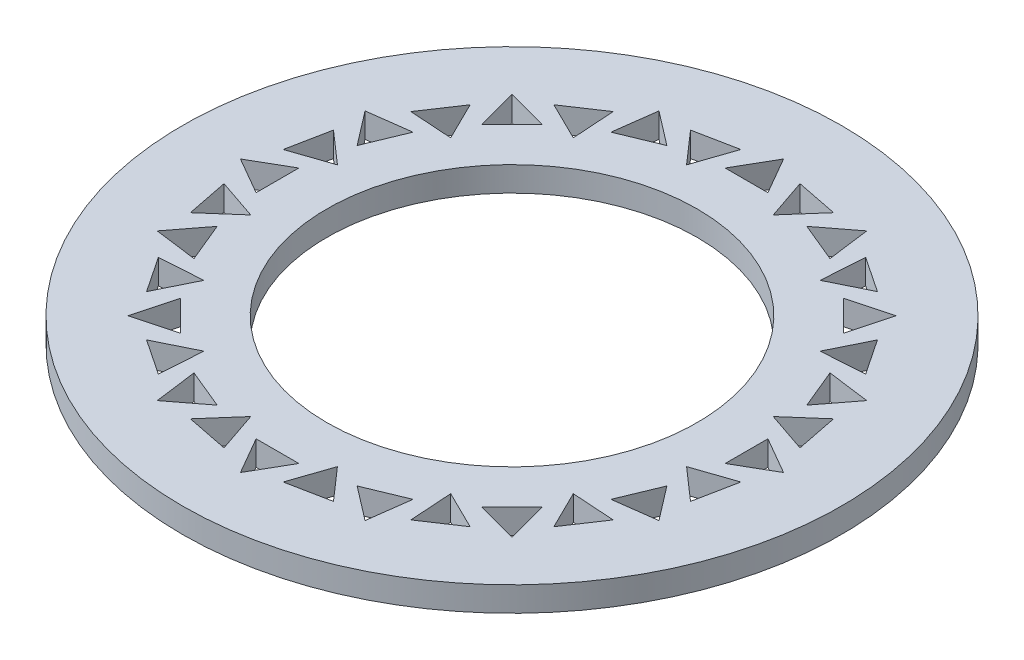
ISO-10303-21;
HEADER;
FILE_DESCRIPTION(('STEP AP214'),'2;1');
FILE_NAME('part.step','',(''),(''),'','','');
FILE_SCHEMA(('AUTOMOTIVE_DESIGN { 1 0 10303 214 1 1 1 1 }'));
ENDSEC;
DATA;
#1=APPLICATION_CONTEXT('core data for automotive mechanical design processes');
#2=APPLICATION_PROTOCOL_DEFINITION('international standard','automotive_design',2000,#1);
#3=PRODUCT_CONTEXT('',#1,'mechanical');
#4=PRODUCT('Part','Part','',(#3));
#5=PRODUCT_RELATED_PRODUCT_CATEGORY('part','',(#4));
#6=PRODUCT_DEFINITION_FORMATION('','',#4);
#7=PRODUCT_DEFINITION_CONTEXT('part definition',#1,'design');
#8=PRODUCT_DEFINITION('design','',#6,#7);
#9=PRODUCT_DEFINITION_SHAPE('','',#8);
#10=(LENGTH_UNIT() NAMED_UNIT(*) SI_UNIT(.MILLI.,.METRE.));
#11=(NAMED_UNIT(*) PLANE_ANGLE_UNIT() SI_UNIT($,.RADIAN.));
#12=(NAMED_UNIT(*) SI_UNIT($,.STERADIAN.) SOLID_ANGLE_UNIT());
#13=UNCERTAINTY_MEASURE_WITH_UNIT(LENGTH_MEASURE(1.E-05),#10,'distance_accuracy_value','');
#14=(GEOMETRIC_REPRESENTATION_CONTEXT(3) GLOBAL_UNCERTAINTY_ASSIGNED_CONTEXT((#13)) GLOBAL_UNIT_ASSIGNED_CONTEXT((#10,
#11,#12)) REPRESENTATION_CONTEXT('',''));
#15=CARTESIAN_POINT('',(0.,0.,0.));
#16=DIRECTION('',(0.,0.,1.));
#17=DIRECTION('',(1.,0.,0.));
#18=AXIS2_PLACEMENT_3D('',#15,#16,#17);
#19=CARTESIAN_POINT('',(0.,1.,0.));
#20=DIRECTION('',(0.,1.,0.));
#21=DIRECTION('',(0.,0.,1.));
#22=AXIS2_PLACEMENT_3D('',#19,#20,#21);
#23=PLANE('',#22);
#24=DIRECTION('',(-0.130526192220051,0.,-0.99144486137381));
#25=VECTOR('',#24,1.);
#26=CARTESIAN_POINT('',(4.4355957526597,1.,-8.44544198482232));
#27=LINE('',#26,#25);
#28=CARTESIAN_POINT('',(4.4355957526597,1.,-8.44544198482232));
#29=VERTEX_POINT('',#28);
#30=CARTESIAN_POINT('',(4.20951775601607,1.,-10.1626748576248));
#31=VERTEX_POINT('',#30);
#32=EDGE_CURVE('E59',#29,#31,#27,.T.);
#33=ORIENTED_EDGE('',*,*,#32,.F.);
#34=DIRECTION('',(0.923879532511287,0.,0.38268343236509));
#35=VECTOR('',#34,1.);
#36=CARTESIAN_POINT('',(2.83538946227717,1.,-9.1082691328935));
#37=LINE('',#36,#35);
#38=CARTESIAN_POINT('',(2.83538946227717,1.,-9.1082691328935));
#39=VERTEX_POINT('',#38);
#40=EDGE_CURVE('E967',#39,#29,#37,.T.);
#41=ORIENTED_EDGE('',*,*,#40,.F.);
#42=DIRECTION('',(-0.793353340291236,0.,0.608761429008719));
#43=VECTOR('',#42,1.);
#44=CARTESIAN_POINT('',(4.20951775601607,1.,-10.1626748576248));
#45=LINE('',#44,#43);
#46=EDGE_CURVE('E978',#31,#39,#45,.T.);
#47=ORIENTED_EDGE('',*,*,#46,.F.);
#48=EDGE_LOOP('',(#33,#41,#47));
#49=FACE_BOUND('',#48,.T.);
#50=DIRECTION('',(0.321439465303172,0.,0.946930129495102));
#51=VECTOR('',#50,1.);
#52=CARTESIAN_POINT('',(1.19906341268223,1.,-10.4671986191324));
#53=LINE('',#52,#51);
#54=CARTESIAN_POINT('',(1.19906341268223,1.,-10.4671986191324));
#55=VERTEX_POINT('',#54);
#56=CARTESIAN_POINT('',(1.7558128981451,1.,-8.82706752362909));
#57=VERTEX_POINT('',#56);
#58=EDGE_CURVE('E67',#55,#57,#53,.T.);
#59=ORIENTED_EDGE('',*,*,#58,.F.);
#60=DIRECTION('',(-0.980785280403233,0.,-0.195090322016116));
#61=VECTOR('',#60,1.);
#62=CARTESIAN_POINT('',(2.89783334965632,1.,-10.1292922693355));
#63=LINE('',#62,#61);
#64=CARTESIAN_POINT('',(2.89783334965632,1.,-10.1292922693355));
#65=VERTEX_POINT('',#64);
#66=EDGE_CURVE('E988',#65,#55,#63,.T.);
#67=ORIENTED_EDGE('',*,*,#66,.F.);
#68=DIRECTION('',(0.65934581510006,0.,-0.751839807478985));
#69=VECTOR('',#68,1.);
#70=CARTESIAN_POINT('',(1.7558128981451,1.,-8.82706752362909));
#71=LINE('',#70,#69);
#72=EDGE_CURVE('E997',#57,#65,#71,.T.);
#73=ORIENTED_EDGE('',*,*,#72,.F.);
#74=EDGE_LOOP('',(#59,#67,#73));
#75=FACE_BOUND('',#74,.T.);
#76=DIRECTION('',(0.258819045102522,0.,-0.965925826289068));
#77=VECTOR('',#76,1.);
#78=CARTESIAN_POINT('',(7.32988685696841,1.,-6.10514198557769));
#79=LINE('',#78,#77);
#80=CARTESIAN_POINT('',(7.32988685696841,1.,-6.10514198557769));
#81=VERTEX_POINT('',#80);
#82=CARTESIAN_POINT('',(7.77817459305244,1.,-7.7781745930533));
#83=VERTEX_POINT('',#82);
#84=EDGE_CURVE('E974',#81,#83,#79,.T.);
#85=ORIENTED_EDGE('',*,*,#84,.F.);
#86=DIRECTION('',(0.707106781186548,0.,0.707106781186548));
#87=VECTOR('',#86,1.);
#88=CARTESIAN_POINT('',(6.10514198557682,1.,-7.32988685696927));
#89=LINE('',#88,#87);
#90=CARTESIAN_POINT('',(6.10514198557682,1.,-7.32988685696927));
#91=VERTEX_POINT('',#90);
#92=EDGE_CURVE('E1008',#91,#81,#89,.T.);
#93=ORIENTED_EDGE('',*,*,#92,.F.);
#94=DIRECTION('',(-0.965925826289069,0.,0.25881904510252));
#95=VECTOR('',#94,1.);
#96=CARTESIAN_POINT('',(7.77817459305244,1.,-7.7781745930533));
#97=LINE('',#96,#95);
#98=EDGE_CURVE('E1019',#83,#91,#97,.T.);
#99=ORIENTED_EDGE('',*,*,#98,.F.);
#100=EDGE_LOOP('',(#85,#93,#99));
#101=FACE_BOUND('',#100,.T.);
#102=DIRECTION('',(0.608761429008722,0.,-0.793353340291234));
#103=VECTOR('',#102,1.);
#104=CARTESIAN_POINT('',(9.10826913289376,1.,-2.8353894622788));
#105=LINE('',#104,#103);
#106=CARTESIAN_POINT('',(9.10826913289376,1.,-2.8353894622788));
#107=VERTEX_POINT('',#106);
#108=CARTESIAN_POINT('',(10.1626748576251,1.,-4.20951775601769));
#109=VERTEX_POINT('',#108);
#110=EDGE_CURVE('E1015',#107,#109,#105,.T.);
#111=ORIENTED_EDGE('',*,*,#110,.F.);
#112=DIRECTION('',(0.38268343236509,0.,0.923879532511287));
#113=VECTOR('',#112,1.);
#114=CARTESIAN_POINT('',(8.44544198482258,1.,-4.43559575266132));
#115=LINE('',#114,#113);
#116=CARTESIAN_POINT('',(8.44544198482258,1.,-4.43559575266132));
#117=VERTEX_POINT('',#116);
#118=EDGE_CURVE('E1029',#117,#107,#115,.T.);
#119=ORIENTED_EDGE('',*,*,#118,.F.);
#120=DIRECTION('',(-0.99144486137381,0.,-0.130526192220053));
#121=VECTOR('',#120,1.);
#122=CARTESIAN_POINT('',(10.1626748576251,1.,-4.20951775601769));
#123=LINE('',#122,#121);
#124=EDGE_CURVE('E1040',#109,#117,#123,.T.);
#125=ORIENTED_EDGE('',*,*,#124,.F.);
#126=EDGE_LOOP('',(#111,#119,#125));
#127=FACE_BOUND('',#126,.T.);
#128=DIRECTION('',(0.866025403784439,0.,-0.499999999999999));
#129=VECTOR('',#128,1.);
#130=CARTESIAN_POINT('',(9.50000000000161,1.,0.866025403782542));
#131=LINE('',#130,#129);
#132=CARTESIAN_POINT('',(9.50000000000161,1.,0.866025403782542));
#133=VERTEX_POINT('',#132);
#134=CARTESIAN_POINT('',(11.0000000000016,1.,-1.8925833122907E-12));
#135=VERTEX_POINT('',#134);
#136=EDGE_CURVE('E1036',#133,#135,#131,.T.);
#137=ORIENTED_EDGE('',*,*,#136,.F.);
#138=DIRECTION('',(0.,0.,1.));
#139=VECTOR('',#138,1.);
#140=CARTESIAN_POINT('',(9.50000000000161,1.,-0.86602540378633));
#141=LINE('',#140,#139);
#142=CARTESIAN_POINT('',(9.50000000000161,1.,-0.86602540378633));
#143=VERTEX_POINT('',#142);
#144=EDGE_CURVE('E1050',#143,#133,#141,.T.);
#145=ORIENTED_EDGE('',*,*,#144,.F.);
#146=DIRECTION('',(-0.866025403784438,0.,-0.500000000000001));
#147=VECTOR('',#146,1.);
#148=CARTESIAN_POINT('',(11.0000000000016,1.,-1.89271053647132E-12));
#149=LINE('',#148,#147);
#150=EDGE_CURVE('E1061',#135,#143,#149,.T.);
#151=ORIENTED_EDGE('',*,*,#150,.F.);
#152=EDGE_LOOP('',(#137,#145,#151));
#153=FACE_BOUND('',#152,.T.);
#154=DIRECTION('',(0.991444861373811,0.,-0.13052619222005));
#155=VECTOR('',#154,1.);
#156=CARTESIAN_POINT('',(8.44544198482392,1.,4.4355957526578));
#157=LINE('',#156,#155);
#158=CARTESIAN_POINT('',(8.44544198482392,1.,4.4355957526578));
#159=VERTEX_POINT('',#158);
#160=CARTESIAN_POINT('',(10.1626748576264,1.,4.20951775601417));
#161=VERTEX_POINT('',#160);
#162=EDGE_CURVE('E1057',#159,#161,#157,.T.);
#163=ORIENTED_EDGE('',*,*,#162,.F.);
#164=DIRECTION('',(-0.38268343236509,0.,0.923879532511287));
#165=VECTOR('',#164,1.);
#166=CARTESIAN_POINT('',(9.1082691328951,1.,2.83538946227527));
#167=LINE('',#166,#165);
#168=CARTESIAN_POINT('',(9.1082691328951,1.,2.83538946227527));
#169=VERTEX_POINT('',#168);
#170=EDGE_CURVE('E1071',#169,#159,#167,.T.);
#171=ORIENTED_EDGE('',*,*,#170,.F.);
#172=DIRECTION('',(-0.608761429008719,0.,-0.793353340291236));
#173=VECTOR('',#172,1.);
#174=CARTESIAN_POINT('',(10.1626748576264,1.,4.20951775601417));
#175=LINE('',#174,#173);
#176=EDGE_CURVE('E1082',#161,#169,#175,.T.);
#177=ORIENTED_EDGE('',*,*,#176,.F.);
#178=EDGE_LOOP('',(#163,#171,#177));
#179=FACE_BOUND('',#178,.T.);
#180=DIRECTION('',(0.965925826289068,0.,0.258819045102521));
#181=VECTOR('',#180,1.);
#182=CARTESIAN_POINT('',(6.10514198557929,1.,7.32988685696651));
#183=LINE('',#182,#181);
#184=CARTESIAN_POINT('',(6.10514198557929,1.,7.32988685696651));
#185=VERTEX_POINT('',#184);
#186=CARTESIAN_POINT('',(7.7781745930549,1.,7.77817459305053));
#187=VERTEX_POINT('',#186);
#188=EDGE_CURVE('E1078',#185,#187,#183,.T.);
#189=ORIENTED_EDGE('',*,*,#188,.F.);
#190=DIRECTION('',(-0.707106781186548,0.,0.707106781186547));
#191=VECTOR('',#190,1.);
#192=CARTESIAN_POINT('',(7.32988685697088,1.,6.10514198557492));
#193=LINE('',#192,#191);
#194=CARTESIAN_POINT('',(7.32988685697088,1.,6.10514198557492));
#195=VERTEX_POINT('',#194);
#196=EDGE_CURVE('E1092',#195,#185,#193,.T.);
#197=ORIENTED_EDGE('',*,*,#196,.F.);
#198=DIRECTION('',(-0.25881904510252,0.,-0.965925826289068));
#199=VECTOR('',#198,1.);
#200=CARTESIAN_POINT('',(7.7781745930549,1.,7.77817459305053));
#201=LINE('',#200,#199);
#202=EDGE_CURVE('E1103',#187,#195,#201,.T.);
#203=ORIENTED_EDGE('',*,*,#202,.F.);
#204=EDGE_LOOP('',(#189,#197,#203));
#205=FACE_BOUND('',#204,.T.);
#206=DIRECTION('',(0.793353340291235,0.,0.608761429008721));
#207=VECTOR('',#206,1.);
#208=CARTESIAN_POINT('',(2.8353894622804,1.,9.10826913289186));
#209=LINE('',#208,#207);
#210=CARTESIAN_POINT('',(2.8353894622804,1.,9.10826913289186));
#211=VERTEX_POINT('',#210);
#212=CARTESIAN_POINT('',(4.2095177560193,1.,10.1626748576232));
#213=VERTEX_POINT('',#212);
#214=EDGE_CURVE('E1099',#211,#213,#209,.T.);
#215=ORIENTED_EDGE('',*,*,#214,.F.);
#216=DIRECTION('',(-0.923879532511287,0.,0.38268343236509));
#217=VECTOR('',#216,1.);
#218=CARTESIAN_POINT('',(4.43559575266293,1.,8.44544198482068));
#219=LINE('',#218,#217);
#220=CARTESIAN_POINT('',(4.43559575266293,1.,8.44544198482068));
#221=VERTEX_POINT('',#220);
#222=EDGE_CURVE('E1113',#221,#211,#219,.T.);
#223=ORIENTED_EDGE('',*,*,#222,.F.);
#224=DIRECTION('',(0.130526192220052,0.,-0.99144486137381));
#225=VECTOR('',#224,1.);
#226=CARTESIAN_POINT('',(4.2095177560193,1.,10.1626748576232));
#227=LINE('',#226,#225);
#228=EDGE_CURVE('E1124',#213,#221,#227,.T.);
#229=ORIENTED_EDGE('',*,*,#228,.F.);
#230=EDGE_LOOP('',(#215,#223,#229));
#231=FACE_BOUND('',#230,.T.);
#232=DIRECTION('',(0.499999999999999,0.,0.866025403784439));
#233=VECTOR('',#232,1.);
#234=CARTESIAN_POINT('',(-0.866025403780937,1.,9.49999999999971));
#235=LINE('',#234,#233);
#236=CARTESIAN_POINT('',(-0.866025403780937,1.,9.49999999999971));
#237=VERTEX_POINT('',#236);
#238=CARTESIAN_POINT('',(3.49720252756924E-12,1.,10.9999999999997));
#239=VERTEX_POINT('',#238);
#240=EDGE_CURVE('E1120',#237,#239,#235,.T.);
#241=ORIENTED_EDGE('',*,*,#240,.F.);
#242=DIRECTION('',(-1.,0.,0.));
#243=VECTOR('',#242,1.);
#244=CARTESIAN_POINT('',(0.866025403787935,1.,9.49999999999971));
#245=LINE('',#244,#243);
#246=CARTESIAN_POINT('',(0.866025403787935,1.,9.49999999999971));
#247=VERTEX_POINT('',#246);
#248=EDGE_CURVE('E1134',#247,#237,#245,.T.);
#249=ORIENTED_EDGE('',*,*,#248,.F.);
#250=DIRECTION('',(0.500000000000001,0.,-0.866025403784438));
#251=VECTOR('',#250,1.);
#252=CARTESIAN_POINT('',(3.49767804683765E-12,1.,10.9999999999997));
#253=LINE('',#252,#251);
#254=EDGE_CURVE('E1145',#239,#247,#253,.T.);
#255=ORIENTED_EDGE('',*,*,#254,.F.);
#256=EDGE_LOOP('',(#241,#249,#255));
#257=FACE_BOUND('',#256,.T.);
#258=DIRECTION('',(0.13052619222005,0.,0.991444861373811));
#259=VECTOR('',#258,1.);
#260=CARTESIAN_POINT('',(-4.43559575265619,1.,8.44544198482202));
#261=LINE('',#260,#259);
#262=CARTESIAN_POINT('',(-4.43559575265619,1.,8.44544198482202));
#263=VERTEX_POINT('',#262);
#264=CARTESIAN_POINT('',(-4.20951775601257,1.,10.1626748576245));
#265=VERTEX_POINT('',#264);
#266=EDGE_CURVE('E1141',#263,#265,#261,.T.);
#267=ORIENTED_EDGE('',*,*,#266,.F.);
#268=DIRECTION('',(-0.923879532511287,0.,-0.38268343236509));
#269=VECTOR('',#268,1.);
#270=CARTESIAN_POINT('',(-2.83538946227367,1.,9.1082691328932));
#271=LINE('',#270,#269);
#272=CARTESIAN_POINT('',(-2.83538946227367,1.,9.1082691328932));
#273=VERTEX_POINT('',#272);
#274=EDGE_CURVE('E1155',#273,#263,#271,.T.);
#275=ORIENTED_EDGE('',*,*,#274,.F.);
#276=DIRECTION('',(0.793353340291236,0.,-0.608761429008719));
#277=VECTOR('',#276,1.);
#278=CARTESIAN_POINT('',(-4.20951775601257,1.,10.1626748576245));
#279=LINE('',#278,#277);
#280=EDGE_CURVE('E1166',#265,#273,#279,.T.);
#281=ORIENTED_EDGE('',*,*,#280,.F.);
#282=EDGE_LOOP('',(#267,#275,#281));
#283=FACE_BOUND('',#282,.T.);
#284=DIRECTION('',(-0.258819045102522,0.,0.965925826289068));
#285=VECTOR('',#284,1.);
#286=CARTESIAN_POINT('',(-7.3298868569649,1.,6.10514198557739));
#287=LINE('',#286,#285);
#288=CARTESIAN_POINT('',(-7.3298868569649,1.,6.10514198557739));
#289=VERTEX_POINT('',#288);
#290=CARTESIAN_POINT('',(-7.77817459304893,1.,7.778174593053));
#291=VERTEX_POINT('',#290);
#292=EDGE_CURVE('E1162',#289,#291,#287,.T.);
#293=ORIENTED_EDGE('',*,*,#292,.F.);
#294=DIRECTION('',(-0.707106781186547,0.,-0.707106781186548));
#295=VECTOR('',#294,1.);
#296=CARTESIAN_POINT('',(-6.10514198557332,1.,7.32988685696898));
#297=LINE('',#296,#295);
#298=CARTESIAN_POINT('',(-6.10514198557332,1.,7.32988685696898));
#299=VERTEX_POINT('',#298);
#300=EDGE_CURVE('E1176',#299,#289,#297,.T.);
#301=ORIENTED_EDGE('',*,*,#300,.F.);
#302=DIRECTION('',(0.965925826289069,0.,-0.25881904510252));
#303=VECTOR('',#302,1.);
#304=CARTESIAN_POINT('',(-7.77817459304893,1.,7.778174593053));
#305=LINE('',#304,#303);
#306=EDGE_CURVE('E1187',#291,#299,#305,.T.);
#307=ORIENTED_EDGE('',*,*,#306,.F.);
#308=EDGE_LOOP('',(#293,#301,#307));
#309=FACE_BOUND('',#308,.T.);
#310=DIRECTION('',(-0.608761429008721,0.,0.793353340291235));
#311=VECTOR('',#310,1.);
#312=CARTESIAN_POINT('',(-9.10826913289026,1.,2.83538946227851));
#313=LINE('',#312,#311);
#314=CARTESIAN_POINT('',(-9.10826913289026,1.,2.83538946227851));
#315=VERTEX_POINT('',#314);
#316=CARTESIAN_POINT('',(-10.1626748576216,1.,4.2095177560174));
#317=VERTEX_POINT('',#316);
#318=EDGE_CURVE('E1183',#315,#317,#313,.T.);
#319=ORIENTED_EDGE('',*,*,#318,.F.);
#320=DIRECTION('',(-0.382683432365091,0.,-0.923879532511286));
#321=VECTOR('',#320,1.);
#322=CARTESIAN_POINT('',(-8.44544198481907,1.,4.43559575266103));
#323=LINE('',#322,#321);
#324=CARTESIAN_POINT('',(-8.44544198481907,1.,4.43559575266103));
#325=VERTEX_POINT('',#324);
#326=EDGE_CURVE('E1197',#325,#315,#323,.T.);
#327=ORIENTED_EDGE('',*,*,#326,.F.);
#328=DIRECTION('',(0.99144486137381,0.,0.130526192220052));
#329=VECTOR('',#328,1.);
#330=CARTESIAN_POINT('',(-10.1626748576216,1.,4.2095177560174));
#331=LINE('',#330,#329);
#332=EDGE_CURVE('E1208',#317,#325,#331,.T.);
#333=ORIENTED_EDGE('',*,*,#332,.F.);
#334=EDGE_LOOP('',(#319,#327,#333));
#335=FACE_BOUND('',#334,.T.);
#336=DIRECTION('',(-0.866025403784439,0.,0.499999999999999));
#337=VECTOR('',#336,1.);
#338=CARTESIAN_POINT('',(-9.4999999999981,1.,-0.866025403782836));
#339=LINE('',#338,#337);
#340=CARTESIAN_POINT('',(-9.4999999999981,1.,-0.866025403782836));
#341=VERTEX_POINT('',#340);
#342=CARTESIAN_POINT('',(-10.9999999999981,1.,1.6002824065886E-12));
#343=VERTEX_POINT('',#342);
#344=EDGE_CURVE('E1204',#341,#343,#339,.T.);
#345=ORIENTED_EDGE('',*,*,#344,.F.);
#346=DIRECTION('',(0.,0.,-1.));
#347=VECTOR('',#346,1.);
#348=CARTESIAN_POINT('',(-9.4999999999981,1.,0.866025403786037));
#349=LINE('',#348,#347);
#350=CARTESIAN_POINT('',(-9.4999999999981,1.,0.866025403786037));
#351=VERTEX_POINT('',#350);
#352=EDGE_CURVE('E1218',#351,#341,#349,.T.);
#353=ORIENTED_EDGE('',*,*,#352,.F.);
#354=DIRECTION('',(0.866025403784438,0.,0.5));
#355=VECTOR('',#354,1.);
#356=CARTESIAN_POINT('',(-10.9999999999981,1.,1.59915465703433E-12));
#357=LINE('',#356,#355);
#358=EDGE_CURVE('E1229',#343,#351,#357,.T.);
#359=ORIENTED_EDGE('',*,*,#358,.F.);
#360=EDGE_LOOP('',(#345,#353,#359));
#361=FACE_BOUND('',#360,.T.);
#362=DIRECTION('',(-0.991444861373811,0.,0.13052619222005));
#363=VECTOR('',#362,1.);
#364=CARTESIAN_POINT('',(-8.44544198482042,1.,-4.4355957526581));
#365=LINE('',#364,#363);
#366=CARTESIAN_POINT('',(-8.44544198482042,1.,-4.4355957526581));
#367=VERTEX_POINT('',#366);
#368=CARTESIAN_POINT('',(-10.1626748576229,1.,-4.20951775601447));
#369=VERTEX_POINT('',#368);
#370=EDGE_CURVE('E1225',#367,#369,#365,.T.);
#371=ORIENTED_EDGE('',*,*,#370,.F.);
#372=DIRECTION('',(0.38268343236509,0.,-0.923879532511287));
#373=VECTOR('',#372,1.);
#374=CARTESIAN_POINT('',(-9.1082691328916,1.,-2.83538946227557));
#375=LINE('',#374,#373);
#376=CARTESIAN_POINT('',(-9.1082691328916,1.,-2.83538946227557));
#377=VERTEX_POINT('',#376);
#378=EDGE_CURVE('E1239',#377,#367,#375,.T.);
#379=ORIENTED_EDGE('',*,*,#378,.F.);
#380=DIRECTION('',(0.608761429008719,0.,0.793353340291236));
#381=VECTOR('',#380,1.);
#382=CARTESIAN_POINT('',(-10.1626748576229,1.,-4.20951775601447));
#383=LINE('',#382,#381);
#384=EDGE_CURVE('E1250',#369,#377,#383,.T.);
#385=ORIENTED_EDGE('',*,*,#384,.F.);
#386=EDGE_LOOP('',(#371,#379,#385));
#387=FACE_BOUND('',#386,.T.);
#388=DIRECTION('',(-0.965925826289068,0.,-0.258819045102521));
#389=VECTOR('',#388,1.);
#390=CARTESIAN_POINT('',(-6.10514198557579,1.,-7.3298868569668));
#391=LINE('',#390,#389);
#392=CARTESIAN_POINT('',(-6.10514198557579,1.,-7.3298868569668));
#393=VERTEX_POINT('',#392);
#394=CARTESIAN_POINT('',(-7.7781745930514,1.,-7.77817459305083));
#395=VERTEX_POINT('',#394);
#396=EDGE_CURVE('E1246',#393,#395,#391,.T.);
#397=ORIENTED_EDGE('',*,*,#396,.F.);
#398=DIRECTION('',(0.707106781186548,0.,-0.707106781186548));
#399=VECTOR('',#398,1.);
#400=CARTESIAN_POINT('',(-7.32988685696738,1.,-6.10514198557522));
#401=LINE('',#400,#399);
#402=CARTESIAN_POINT('',(-7.32988685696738,1.,-6.10514198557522));
#403=VERTEX_POINT('',#402);
#404=EDGE_CURVE('E1260',#403,#393,#401,.T.);
#405=ORIENTED_EDGE('',*,*,#404,.F.);
#406=DIRECTION('',(0.25881904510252,0.,0.965925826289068));
#407=VECTOR('',#406,1.);
#408=CARTESIAN_POINT('',(-7.7781745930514,1.,-7.77817459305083));
#409=LINE('',#408,#407);
#410=EDGE_CURVE('E1271',#395,#403,#409,.T.);
#411=ORIENTED_EDGE('',*,*,#410,.F.);
#412=EDGE_LOOP('',(#397,#405,#411));
#413=FACE_BOUND('',#412,.T.);
#414=DIRECTION('',(-0.793353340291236,0.,-0.60876142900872));
#415=VECTOR('',#414,1.);
#416=CARTESIAN_POINT('',(-2.8353894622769,1.,-9.10826913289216));
#417=LINE('',#416,#415);
#418=CARTESIAN_POINT('',(-2.8353894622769,1.,-9.10826913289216));
#419=VERTEX_POINT('',#418);
#420=CARTESIAN_POINT('',(-4.2095177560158,1.,-10.1626748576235));
#421=VERTEX_POINT('',#420);
#422=EDGE_CURVE('E1267',#419,#421,#417,.T.);
#423=ORIENTED_EDGE('',*,*,#422,.F.);
#424=DIRECTION('',(0.923879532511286,0.,-0.382683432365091));
#425=VECTOR('',#424,1.);
#426=CARTESIAN_POINT('',(-4.43559575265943,1.,-8.44544198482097));
#427=LINE('',#426,#425);
#428=CARTESIAN_POINT('',(-4.43559575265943,1.,-8.44544198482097));
#429=VERTEX_POINT('',#428);
#430=EDGE_CURVE('E1281',#429,#419,#427,.T.);
#431=ORIENTED_EDGE('',*,*,#430,.F.);
#432=DIRECTION('',(-0.130526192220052,0.,0.99144486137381));
#433=VECTOR('',#432,1.);
#434=CARTESIAN_POINT('',(-4.2095177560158,1.,-10.1626748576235));
#435=LINE('',#434,#433);
#436=EDGE_CURVE('E1290',#421,#429,#435,.T.);
#437=ORIENTED_EDGE('',*,*,#436,.F.);
#438=EDGE_LOOP('',(#423,#431,#437));
#439=FACE_BOUND('',#438,.T.);
#440=DIRECTION('',(0.659345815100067,0.,0.751839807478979));
#441=VECTOR('',#440,1.);
#442=CARTESIAN_POINT('',(-2.89783334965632,1.,-10.1292922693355));
#443=LINE('',#442,#441);
#444=CARTESIAN_POINT('',(-2.89783334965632,1.,-10.1292922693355));
#445=VERTEX_POINT('',#444);
#446=CARTESIAN_POINT('',(-1.75581289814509,1.,-8.82706752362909));
#447=VERTEX_POINT('',#446);
#448=EDGE_CURVE('E769',#445,#447,#443,.T.);
#449=ORIENTED_EDGE('',*,*,#448,.F.);
#450=DIRECTION('',(-0.980785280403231,0.,0.195090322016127));
#451=VECTOR('',#450,1.);
#452=CARTESIAN_POINT('',(-1.19906341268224,1.,-10.4671986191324));
#453=LINE('',#452,#451);
#454=CARTESIAN_POINT('',(-1.19906341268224,1.,-10.4671986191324));
#455=VERTEX_POINT('',#454);
#456=EDGE_CURVE('E783',#455,#445,#453,.T.);
#457=ORIENTED_EDGE('',*,*,#456,.F.);
#458=DIRECTION('',(0.321439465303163,0.,-0.946930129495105));
#459=VECTOR('',#458,1.);
#460=CARTESIAN_POINT('',(-1.75581289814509,1.,-8.82706752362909));
#461=LINE('',#460,#459);
#462=EDGE_CURVE('E793',#447,#455,#461,.T.);
#463=ORIENTED_EDGE('',*,*,#462,.F.);
#464=EDGE_LOOP('',(#449,#457,#463));
#465=FACE_BOUND('',#464,.T.);
#466=DIRECTION('',(0.896872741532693,0.,0.442288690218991));
#467=VECTOR('',#466,1.);
#468=CARTESIAN_POINT('',(-6.55356125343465,1.,-8.24929299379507));
#469=LINE('',#468,#467);
#470=CARTESIAN_POINT('',(-6.55356125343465,1.,-8.24929299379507));
#471=VERTEX_POINT('',#470);
#472=CARTESIAN_POINT('',(-5.00013209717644,1.,-7.48322651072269));
#473=VERTEX_POINT('',#472);
#474=EDGE_CURVE('E748',#471,#473,#469,.T.);
#475=ORIENTED_EDGE('',*,*,#474,.F.);
#476=DIRECTION('',(-0.831469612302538,0.,0.555570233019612));
#477=VECTOR('',#476,1.);
#478=CARTESIAN_POINT('',(-5.11341363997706,1.,-9.21156886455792));
#479=LINE('',#478,#477);
#480=CARTESIAN_POINT('',(-5.11341363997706,1.,-9.21156886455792));
#481=VERTEX_POINT('',#480);
#482=EDGE_CURVE('E762',#481,#471,#479,.T.);
#483=ORIENTED_EDGE('',*,*,#482,.F.);
#484=DIRECTION('',(-0.0654031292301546,0.,-0.997858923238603));
#485=VECTOR('',#484,1.);
#486=CARTESIAN_POINT('',(-5.00013209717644,1.,-7.48322651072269));
#487=LINE('',#486,#485);
#488=EDGE_CURVE('E773',#473,#481,#487,.T.);
#489=ORIENTED_EDGE('',*,*,#488,.F.);
#490=EDGE_LOOP('',(#475,#483,#489));
#491=FACE_BOUND('',#490,.T.);
#492=DIRECTION('',(0.997858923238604,0.,0.0654031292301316));
#493=VECTOR('',#492,1.);
#494=CARTESIAN_POINT('',(-9.21156886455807,1.,-5.1134136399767));
#495=LINE('',#494,#493);
#496=CARTESIAN_POINT('',(-9.21156886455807,1.,-5.1134136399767));
#497=VERTEX_POINT('',#496);
#498=CARTESIAN_POINT('',(-7.48322651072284,1.,-5.00013209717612));
#499=VERTEX_POINT('',#498);
#500=EDGE_CURVE('E727',#497,#499,#495,.T.);
#501=ORIENTED_EDGE('',*,*,#500,.F.);
#502=DIRECTION('',(-0.555570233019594,0.,0.831469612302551));
#503=VECTOR('',#502,1.);
#504=CARTESIAN_POINT('',(-8.24929299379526,1.,-6.55356125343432));
#505=LINE('',#504,#503);
#506=CARTESIAN_POINT('',(-8.24929299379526,1.,-6.55356125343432));
#507=VERTEX_POINT('',#506);
#508=EDGE_CURVE('E741',#507,#497,#505,.T.);
#509=ORIENTED_EDGE('',*,*,#508,.F.);
#510=DIRECTION('',(-0.442288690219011,0.,-0.896872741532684));
#511=VECTOR('',#510,1.);
#512=CARTESIAN_POINT('',(-7.48322651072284,1.,-5.00013209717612));
#513=LINE('',#512,#511);
#514=EDGE_CURVE('E752',#499,#507,#513,.T.);
#515=ORIENTED_EDGE('',*,*,#514,.F.);
#516=EDGE_LOOP('',(#501,#509,#515));
#517=FACE_BOUND('',#516,.T.);
#518=DIRECTION('',(0.946930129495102,0.,-0.321439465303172));
#519=VECTOR('',#518,1.);
#520=CARTESIAN_POINT('',(-10.4671986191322,1.,-1.19906341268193));
#521=LINE('',#520,#519);
#522=CARTESIAN_POINT('',(-10.4671986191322,1.,-1.19906341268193));
#523=VERTEX_POINT('',#522);
#524=CARTESIAN_POINT('',(-8.82706752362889,1.,-1.7558128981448));
#525=VERTEX_POINT('',#524);
#526=EDGE_CURVE('E706',#523,#525,#521,.T.);
#527=ORIENTED_EDGE('',*,*,#526,.F.);
#528=DIRECTION('',(-0.195090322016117,0.,0.980785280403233));
#529=VECTOR('',#528,1.);
#530=CARTESIAN_POINT('',(-10.1292922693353,1.,-2.89783334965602));
#531=LINE('',#530,#529);
#532=CARTESIAN_POINT('',(-10.1292922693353,1.,-2.89783334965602));
#533=VERTEX_POINT('',#532);
#534=EDGE_CURVE('E720',#533,#523,#531,.T.);
#535=ORIENTED_EDGE('',*,*,#534,.F.);
#536=DIRECTION('',(-0.751839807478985,0.,-0.65934581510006));
#537=VECTOR('',#536,1.);
#538=CARTESIAN_POINT('',(-8.82706752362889,1.,-1.7558128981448));
#539=LINE('',#538,#537);
#540=EDGE_CURVE('E731',#525,#533,#539,.T.);
#541=ORIENTED_EDGE('',*,*,#540,.F.);
#542=EDGE_LOOP('',(#527,#535,#541));
#543=FACE_BOUND('',#542,.T.);
#544=DIRECTION('',(0.751839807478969,0.,-0.659345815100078));
#545=VECTOR('',#544,1.);
#546=CARTESIAN_POINT('',(-10.1292922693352,1.,2.89783334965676));
#547=LINE('',#546,#545);
#548=CARTESIAN_POINT('',(-10.1292922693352,1.,2.89783334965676));
#549=VERTEX_POINT('',#548);
#550=CARTESIAN_POINT('',(-8.82706752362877,1.,1.75581289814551));
#551=VERTEX_POINT('',#550);
#552=EDGE_CURVE('E685',#549,#551,#547,.T.);
#553=ORIENTED_EDGE('',*,*,#552,.F.);
#554=DIRECTION('',(0.19509032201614,0.,0.980785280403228));
#555=VECTOR('',#554,1.);
#556=CARTESIAN_POINT('',(-10.4671986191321,1.,1.19906341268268));
#557=LINE('',#556,#555);
#558=CARTESIAN_POINT('',(-10.4671986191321,1.,1.19906341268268));
#559=VERTEX_POINT('',#558);
#560=EDGE_CURVE('E699',#559,#549,#557,.T.);
#561=ORIENTED_EDGE('',*,*,#560,.F.);
#562=DIRECTION('',(-0.946930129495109,0.,-0.321439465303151));
#563=VECTOR('',#562,1.);
#564=CARTESIAN_POINT('',(-8.82706752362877,1.,1.75581289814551));
#565=LINE('',#564,#563);
#566=EDGE_CURVE('E710',#551,#559,#565,.T.);
#567=ORIENTED_EDGE('',*,*,#566,.F.);
#568=EDGE_LOOP('',(#553,#561,#567));
#569=FACE_BOUND('',#568,.T.);
#570=DIRECTION('',(0.442288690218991,0.,-0.896872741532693));
#571=VECTOR('',#570,1.);
#572=CARTESIAN_POINT('',(-8.24929299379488,1.,6.55356125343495));
#573=LINE('',#572,#571);
#574=CARTESIAN_POINT('',(-8.24929299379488,1.,6.55356125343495));
#575=VERTEX_POINT('',#574);
#576=CARTESIAN_POINT('',(-7.48322651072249,1.,5.00013209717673));
#577=VERTEX_POINT('',#576);
#578=EDGE_CURVE('E652',#575,#577,#573,.T.);
#579=ORIENTED_EDGE('',*,*,#578,.F.);
#580=DIRECTION('',(0.555570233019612,0.,0.831469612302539));
#581=VECTOR('',#580,1.);
#582=CARTESIAN_POINT('',(-9.21156886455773,1.,5.11341363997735));
#583=LINE('',#582,#581);
#584=CARTESIAN_POINT('',(-9.21156886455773,1.,5.11341363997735));
#585=VERTEX_POINT('',#584);
#586=EDGE_CURVE('E678',#585,#575,#583,.T.);
#587=ORIENTED_EDGE('',*,*,#586,.F.);
#588=DIRECTION('',(-0.997858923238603,0.,0.0654031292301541));
#589=VECTOR('',#588,1.);
#590=CARTESIAN_POINT('',(-7.48322651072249,1.,5.00013209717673));
#591=LINE('',#590,#589);
#592=EDGE_CURVE('E689',#577,#585,#591,.T.);
#593=ORIENTED_EDGE('',*,*,#592,.F.);
#594=EDGE_LOOP('',(#579,#587,#593));
#595=FACE_BOUND('',#594,.T.);
#596=DIRECTION('',(0.0654031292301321,0.,-0.997858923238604));
#597=VECTOR('',#596,1.);
#598=CARTESIAN_POINT('',(-5.1134136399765,1.,9.21156886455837));
#599=LINE('',#598,#597);
#600=CARTESIAN_POINT('',(-5.1134136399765,1.,9.21156886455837));
#601=VERTEX_POINT('',#600);
#602=CARTESIAN_POINT('',(-5.00013209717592,1.,7.48322651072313));
#603=VERTEX_POINT('',#602);
#604=EDGE_CURVE('E643',#601,#603,#599,.T.);
#605=ORIENTED_EDGE('',*,*,#604,.F.);
#606=DIRECTION('',(0.831469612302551,0.,0.555570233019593));
#607=VECTOR('',#606,1.);
#608=CARTESIAN_POINT('',(-6.55356125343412,1.,8.24929299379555));
#609=LINE('',#608,#607);
#610=CARTESIAN_POINT('',(-6.55356125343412,1.,8.24929299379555));
#611=VERTEX_POINT('',#610);
#612=EDGE_CURVE('E655',#611,#601,#609,.T.);
#613=ORIENTED_EDGE('',*,*,#612,.F.);
#614=DIRECTION('',(-0.896872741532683,0.,0.442288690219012));
#615=VECTOR('',#614,1.);
#616=CARTESIAN_POINT('',(-5.00013209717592,1.,7.48322651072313));
#617=LINE('',#616,#615);
#618=EDGE_CURVE('E661',#603,#611,#617,.T.);
#619=ORIENTED_EDGE('',*,*,#618,.F.);
#620=EDGE_LOOP('',(#605,#613,#619));
#621=FACE_BOUND('',#620,.T.);
#622=DIRECTION('',(-0.321439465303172,0.,-0.946930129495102));
#623=VECTOR('',#622,1.);
#624=CARTESIAN_POINT('',(-1.19906341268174,1.,10.4671986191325));
#625=LINE('',#624,#623);
#626=CARTESIAN_POINT('',(-1.19906341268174,1.,10.4671986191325));
#627=VERTEX_POINT('',#626);
#628=CARTESIAN_POINT('',(-1.75581289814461,1.,8.82706752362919));
#629=VERTEX_POINT('',#628);
#630=EDGE_CURVE('E938',#627,#629,#625,.T.);
#631=ORIENTED_EDGE('',*,*,#630,.F.);
#632=DIRECTION('',(0.980785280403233,0.,0.195090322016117));
#633=VECTOR('',#632,1.);
#634=CARTESIAN_POINT('',(-2.89783334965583,1.,10.1292922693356));
#635=LINE('',#634,#633);
#636=CARTESIAN_POINT('',(-2.89783334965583,1.,10.1292922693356));
#637=VERTEX_POINT('',#636);
#638=EDGE_CURVE('E952',#637,#627,#635,.T.);
#639=ORIENTED_EDGE('',*,*,#638,.F.);
#640=DIRECTION('',(-0.65934581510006,0.,0.751839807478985));
#641=VECTOR('',#640,1.);
#642=CARTESIAN_POINT('',(-1.75581289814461,1.,8.82706752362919));
#643=LINE('',#642,#641);
#644=EDGE_CURVE('E958',#629,#637,#643,.T.);
#645=ORIENTED_EDGE('',*,*,#644,.F.);
#646=EDGE_LOOP('',(#631,#639,#645));
#647=FACE_BOUND('',#646,.T.);
#648=DIRECTION('',(-0.659345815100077,0.,-0.75183980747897));
#649=VECTOR('',#648,1.);
#650=CARTESIAN_POINT('',(2.89783334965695,1.,10.1292922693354));
#651=LINE('',#650,#649);
#652=CARTESIAN_POINT('',(2.89783334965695,1.,10.1292922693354));
#653=VERTEX_POINT('',#652);
#654=CARTESIAN_POINT('',(1.7558128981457,1.,8.82706752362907));
#655=VERTEX_POINT('',#654);
#656=EDGE_CURVE('E917',#653,#655,#651,.T.);
#657=ORIENTED_EDGE('',*,*,#656,.F.);
#658=DIRECTION('',(0.980785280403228,0.,-0.195090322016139));
#659=VECTOR('',#658,1.);
#660=CARTESIAN_POINT('',(1.19906341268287,1.,10.4671986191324));
#661=LINE('',#660,#659);
#662=CARTESIAN_POINT('',(1.19906341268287,1.,10.4671986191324));
#663=VERTEX_POINT('',#662);
#664=EDGE_CURVE('E931',#663,#653,#661,.T.);
#665=ORIENTED_EDGE('',*,*,#664,.F.);
#666=DIRECTION('',(-0.321439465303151,0.,0.946930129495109));
#667=VECTOR('',#666,1.);
#668=CARTESIAN_POINT('',(1.7558128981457,1.,8.82706752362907));
#669=LINE('',#668,#667);
#670=EDGE_CURVE('E942',#655,#663,#669,.T.);
#671=ORIENTED_EDGE('',*,*,#670,.F.);
#672=EDGE_LOOP('',(#657,#665,#671));
#673=FACE_BOUND('',#672,.T.);
#674=DIRECTION('',(-0.896872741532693,0.,-0.442288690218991));
#675=VECTOR('',#674,1.);
#676=CARTESIAN_POINT('',(6.55356125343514,1.,8.24929299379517));
#677=LINE('',#676,#675);
#678=CARTESIAN_POINT('',(6.55356125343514,1.,8.24929299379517));
#679=VERTEX_POINT('',#678);
#680=CARTESIAN_POINT('',(5.00013209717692,1.,7.48322651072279));
#681=VERTEX_POINT('',#680);
#682=EDGE_CURVE('E896',#679,#681,#677,.T.);
#683=ORIENTED_EDGE('',*,*,#682,.F.);
#684=DIRECTION('',(0.831469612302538,0.,-0.555570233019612));
#685=VECTOR('',#684,1.);
#686=CARTESIAN_POINT('',(5.11341363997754,1.,9.21156886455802));
#687=LINE('',#686,#685);
#688=CARTESIAN_POINT('',(5.11341363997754,1.,9.21156886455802));
#689=VERTEX_POINT('',#688);
#690=EDGE_CURVE('E910',#689,#679,#687,.T.);
#691=ORIENTED_EDGE('',*,*,#690,.F.);
#692=DIRECTION('',(0.0654031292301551,0.,0.997858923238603));
#693=VECTOR('',#692,1.);
#694=CARTESIAN_POINT('',(5.00013209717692,1.,7.48322651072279));
#695=LINE('',#694,#693);
#696=EDGE_CURVE('E921',#681,#689,#695,.T.);
#697=ORIENTED_EDGE('',*,*,#696,.F.);
#698=EDGE_LOOP('',(#683,#691,#697));
#699=FACE_BOUND('',#698,.T.);
#700=DIRECTION('',(-0.997858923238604,0.,-0.0654031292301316));
#701=VECTOR('',#700,1.);
#702=CARTESIAN_POINT('',(9.21156886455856,1.,5.1134136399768));
#703=LINE('',#702,#701);
#704=CARTESIAN_POINT('',(9.21156886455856,1.,5.1134136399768));
#705=VERTEX_POINT('',#704);
#706=CARTESIAN_POINT('',(7.48322651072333,1.,5.00013209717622));
#707=VERTEX_POINT('',#706);
#708=EDGE_CURVE('E875',#705,#707,#703,.T.);
#709=ORIENTED_EDGE('',*,*,#708,.F.);
#710=DIRECTION('',(0.555570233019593,0.,-0.831469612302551));
#711=VECTOR('',#710,1.);
#712=CARTESIAN_POINT('',(8.24929299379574,1.,6.55356125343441));
#713=LINE('',#712,#711);
#714=CARTESIAN_POINT('',(8.24929299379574,1.,6.55356125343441));
#715=VERTEX_POINT('',#714);
#716=EDGE_CURVE('E889',#715,#705,#713,.T.);
#717=ORIENTED_EDGE('',*,*,#716,.F.);
#718=DIRECTION('',(0.442288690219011,0.,0.896872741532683));
#719=VECTOR('',#718,1.);
#720=CARTESIAN_POINT('',(7.48322651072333,1.,5.00013209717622));
#721=LINE('',#720,#719);
#722=EDGE_CURVE('E900',#707,#715,#721,.T.);
#723=ORIENTED_EDGE('',*,*,#722,.F.);
#724=EDGE_LOOP('',(#709,#717,#723));
#725=FACE_BOUND('',#724,.T.);
#726=DIRECTION('',(-0.946930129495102,0.,0.321439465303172));
#727=VECTOR('',#726,1.);
#728=CARTESIAN_POINT('',(10.4671986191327,1.,1.19906341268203));
#729=LINE('',#728,#727);
#730=CARTESIAN_POINT('',(10.4671986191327,1.,1.19906341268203));
#731=VERTEX_POINT('',#730);
#732=CARTESIAN_POINT('',(8.82706752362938,1.,1.7558128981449));
#733=VERTEX_POINT('',#732);
#734=EDGE_CURVE('E854',#731,#733,#729,.T.);
#735=ORIENTED_EDGE('',*,*,#734,.F.);
#736=DIRECTION('',(0.195090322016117,0.,-0.980785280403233));
#737=VECTOR('',#736,1.);
#738=CARTESIAN_POINT('',(10.1292922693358,1.,2.89783334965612));
#739=LINE('',#738,#737);
#740=CARTESIAN_POINT('',(10.1292922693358,1.,2.89783334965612));
#741=VERTEX_POINT('',#740);
#742=EDGE_CURVE('E868',#741,#731,#739,.T.);
#743=ORIENTED_EDGE('',*,*,#742,.F.);
#744=DIRECTION('',(0.751839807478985,0.,0.65934581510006));
#745=VECTOR('',#744,1.);
#746=CARTESIAN_POINT('',(8.82706752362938,1.,1.7558128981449));
#747=LINE('',#746,#745);
#748=EDGE_CURVE('E879',#733,#741,#747,.T.);
#749=ORIENTED_EDGE('',*,*,#748,.F.);
#750=EDGE_LOOP('',(#735,#743,#749));
#751=FACE_BOUND('',#750,.T.);
#752=DIRECTION('',(-0.75183980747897,0.,0.659345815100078));
#753=VECTOR('',#752,1.);
#754=CARTESIAN_POINT('',(10.1292922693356,1.,-2.89783334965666));
#755=LINE('',#754,#753);
#756=CARTESIAN_POINT('',(10.1292922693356,1.,-2.89783334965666));
#757=VERTEX_POINT('',#756);
#758=CARTESIAN_POINT('',(8.82706752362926,1.,-1.75581289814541));
#759=VERTEX_POINT('',#758);
#760=EDGE_CURVE('E833',#757,#759,#755,.T.);
#761=ORIENTED_EDGE('',*,*,#760,.F.);
#762=DIRECTION('',(-0.195090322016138,0.,-0.980785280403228));
#763=VECTOR('',#762,1.);
#764=CARTESIAN_POINT('',(10.4671986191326,1.,-1.19906341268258));
#765=LINE('',#764,#763);
#766=CARTESIAN_POINT('',(10.4671986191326,1.,-1.19906341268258));
#767=VERTEX_POINT('',#766);
#768=EDGE_CURVE('E847',#767,#757,#765,.T.);
#769=ORIENTED_EDGE('',*,*,#768,.F.);
#770=DIRECTION('',(0.946930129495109,0.,0.321439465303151));
#771=VECTOR('',#770,1.);
#772=CARTESIAN_POINT('',(8.82706752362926,1.,-1.75581289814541));
#773=LINE('',#772,#771);
#774=EDGE_CURVE('E858',#759,#767,#773,.T.);
#775=ORIENTED_EDGE('',*,*,#774,.F.);
#776=EDGE_LOOP('',(#761,#769,#775));
#777=FACE_BOUND('',#776,.T.);
#778=DIRECTION('',(-0.442288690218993,0.,0.896872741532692));
#779=VECTOR('',#778,1.);
#780=CARTESIAN_POINT('',(8.24929299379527,1.,-6.55356125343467));
#781=LINE('',#780,#779);
#782=CARTESIAN_POINT('',(8.24929299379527,1.,-6.55356125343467));
#783=VERTEX_POINT('',#782);
#784=CARTESIAN_POINT('',(7.48322651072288,1.,-5.00013209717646));
#785=VERTEX_POINT('',#784);
#786=EDGE_CURVE('E810',#783,#785,#781,.T.);
#787=ORIENTED_EDGE('',*,*,#786,.F.);
#788=DIRECTION('',(-0.555570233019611,0.,-0.831469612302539));
#789=VECTOR('',#788,1.);
#790=CARTESIAN_POINT('',(9.21156886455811,1.,-5.11341363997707));
#791=LINE('',#790,#789);
#792=CARTESIAN_POINT('',(9.21156886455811,1.,-5.11341363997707));
#793=VERTEX_POINT('',#792);
#794=EDGE_CURVE('E826',#793,#783,#791,.T.);
#795=ORIENTED_EDGE('',*,*,#794,.F.);
#796=DIRECTION('',(0.997858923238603,0.,-0.0654031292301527));
#797=VECTOR('',#796,1.);
#798=CARTESIAN_POINT('',(7.48322651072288,1.,-5.00013209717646));
#799=LINE('',#798,#797);
#800=EDGE_CURVE('E837',#785,#793,#799,.T.);
#801=ORIENTED_EDGE('',*,*,#800,.F.);
#802=EDGE_LOOP('',(#787,#795,#801));
#803=FACE_BOUND('',#802,.T.);
#804=DIRECTION('',(-0.0654031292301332,0.,0.997858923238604));
#805=VECTOR('',#804,1.);
#806=CARTESIAN_POINT('',(5.11341363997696,1.,-9.21156886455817));
#807=LINE('',#806,#805);
#808=CARTESIAN_POINT('',(5.11341363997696,1.,-9.21156886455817));
#809=VERTEX_POINT('',#808);
#810=CARTESIAN_POINT('',(5.00013209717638,1.,-7.48322651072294));
#811=VERTEX_POINT('',#810);
#812=EDGE_CURVE('E818',#809,#811,#807,.T.);
#813=ORIENTED_EDGE('',*,*,#812,.F.);
#814=DIRECTION('',(-0.831469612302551,0.,-0.555570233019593));
#815=VECTOR('',#814,1.);
#816=CARTESIAN_POINT('',(6.55356125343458,1.,-8.24929299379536));
#817=LINE('',#816,#815);
#818=CARTESIAN_POINT('',(6.55356125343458,1.,-8.24929299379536));
#819=VERTEX_POINT('',#818);
#820=EDGE_CURVE('E803',#819,#809,#817,.T.);
#821=ORIENTED_EDGE('',*,*,#820,.F.);
#822=DIRECTION('',(0.896872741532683,0.,-0.442288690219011));
#823=VECTOR('',#822,1.);
#824=CARTESIAN_POINT('',(5.00013209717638,1.,-7.48322651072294));
#825=LINE('',#824,#823);
#826=EDGE_CURVE('E814',#811,#819,#825,.T.);
#827=ORIENTED_EDGE('',*,*,#826,.F.);
#828=EDGE_LOOP('',(#813,#821,#827));
#829=FACE_BOUND('',#828,.T.);
#830=DIRECTION('',(-0.5,0.,-0.866025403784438));
#831=VECTOR('',#830,1.);
#832=CARTESIAN_POINT('',(0.866025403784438,1.,-9.5));
#833=LINE('',#832,#831);
#834=CARTESIAN_POINT('',(0.866025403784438,1.,-9.5));
#835=VERTEX_POINT('',#834);
#836=CARTESIAN_POINT('',(0.,1.,-11.));
#837=VERTEX_POINT('',#836);
#838=EDGE_CURVE('E1003',#835,#837,#833,.T.);
#839=ORIENTED_EDGE('',*,*,#838,.F.);
#840=DIRECTION('',(1.,0.,0.));
#841=VECTOR('',#840,1.);
#842=CARTESIAN_POINT('',(-0.866025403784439,1.,-9.5));
#843=LINE('',#842,#841);
#844=CARTESIAN_POINT('',(-0.866025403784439,1.,-9.5));
#845=VERTEX_POINT('',#844);
#846=EDGE_CURVE('E1302',#845,#835,#843,.T.);
#847=ORIENTED_EDGE('',*,*,#846,.F.);
#848=DIRECTION('',(-0.5,0.,0.866025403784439));
#849=VECTOR('',#848,1.);
#850=CARTESIAN_POINT('',(0.,1.,-11.));
#851=LINE('',#850,#849);
#852=EDGE_CURVE('E1298',#837,#845,#851,.T.);
#853=ORIENTED_EDGE('',*,*,#852,.F.);
#854=EDGE_LOOP('',(#839,#847,#853));
#855=FACE_BOUND('',#854,.T.);
#856=CARTESIAN_POINT('',(0.,1.,0.));
#857=DIRECTION('',(0.,1.,0.));
#858=DIRECTION('',(0.,0.,1.));
#859=AXIS2_PLACEMENT_3D('',#856,#857,#858);
#860=CIRCLE('',#859,13.35);
#861=CARTESIAN_POINT('',(0.,1.,13.35));
#862=VERTEX_POINT('',#861);
#863=EDGE_CURVE('E1325',#862,#862,#860,.T.);
#864=ORIENTED_EDGE('',*,*,#863,.T.);
#865=EDGE_LOOP('',(#864));
#866=FACE_BOUND('',#865,.T.);
#867=CARTESIAN_POINT('',(0.,1.,0.));
#868=DIRECTION('',(0.,1.,0.));
#869=DIRECTION('',(0.,0.,1.));
#870=AXIS2_PLACEMENT_3D('',#867,#868,#869);
#871=CIRCLE('',#870,7.5);
#872=CARTESIAN_POINT('',(0.,1.,7.5));
#873=VERTEX_POINT('',#872);
#874=EDGE_CURVE('E1317',#873,#873,#871,.T.);
#875=ORIENTED_EDGE('',*,*,#874,.F.);
#876=EDGE_LOOP('',(#875));
#877=FACE_BOUND('',#876,.T.);
#878=ADVANCED_FACE('F43',(#49,#75,#101,#127,#153,#179,#205,#231,#257,#283,#309,#335,#361,#387,
#413,#439,#465,#491,#517,#543,#569,#595,#621,#647,#673,#699,#725,#751,#777,#803,#829,#855,#866,
#877),#23,.T.);
#879=CARTESIAN_POINT('',(0.,0.,0.));
#880=DIRECTION('',(0.,1.,0.));
#881=DIRECTION('',(0.,0.,1.));
#882=AXIS2_PLACEMENT_3D('',#879,#880,#881);
#883=PLANE('',#882);
#884=DIRECTION('',(0.923879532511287,0.,0.38268343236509));
#885=VECTOR('',#884,1.);
#886=CARTESIAN_POINT('',(3.6354926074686,0.,-8.77685555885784));
#887=LINE('',#886,#885);
#888=CARTESIAN_POINT('',(2.83538946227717,0.,-9.1082691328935));
#889=VERTEX_POINT('',#888);
#890=CARTESIAN_POINT('',(4.4355957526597,0.,-8.44544198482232));
#891=VERTEX_POINT('',#890);
#892=EDGE_CURVE('E52',#889,#891,#887,.T.);
#893=ORIENTED_EDGE('',*,*,#892,.T.);
#894=DIRECTION('',(-0.130526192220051,0.,-0.991444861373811));
#895=VECTOR('',#894,1.);
#896=CARTESIAN_POINT('',(5.45294673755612,0.,-0.717894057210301));
#897=LINE('',#896,#895);
#898=CARTESIAN_POINT('',(4.20951775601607,0.,-10.1626748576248));
#899=VERTEX_POINT('',#898);
#900=EDGE_CURVE('E11',#891,#899,#897,.T.);
#901=ORIENTED_EDGE('',*,*,#900,.T.);
#902=DIRECTION('',(-0.793353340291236,0.,0.608761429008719));
#903=VECTOR('',#902,1.);
#904=CARTESIAN_POINT('',(-3.34818785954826,0.,-4.36344337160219));
#905=LINE('',#904,#903);
#906=EDGE_CURVE('E1701',#899,#889,#905,.T.);
#907=ORIENTED_EDGE('',*,*,#906,.T.);
#908=EDGE_LOOP('',(#893,#901,#907));
#909=FACE_BOUND('',#908,.T.);
#910=DIRECTION('',(-0.980785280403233,0.,-0.195090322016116));
#911=VECTOR('',#910,1.);
#912=CARTESIAN_POINT('',(2.04844838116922,0.,-10.2982454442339));
#913=LINE('',#912,#911);
#914=CARTESIAN_POINT('',(2.89783334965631,0.,-10.1292922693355));
#915=VERTEX_POINT('',#914);
#916=CARTESIAN_POINT('',(1.19906341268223,0.,-10.4671986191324));
#917=VERTEX_POINT('',#916);
#918=EDGE_CURVE('E1693',#915,#917,#913,.T.);
#919=ORIENTED_EDGE('',*,*,#918,.T.);
#920=DIRECTION('',(0.321439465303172,0.,0.946930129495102));
#921=VECTOR('',#920,1.);
#922=CARTESIAN_POINT('',(4.26118558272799,0.,-1.44647759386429));
#923=LINE('',#922,#921);
#924=CARTESIAN_POINT('',(1.7558128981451,0.,-8.82706752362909));
#925=VERTEX_POINT('',#924);
#926=EDGE_CURVE('E1697',#917,#925,#923,.T.);
#927=ORIENTED_EDGE('',*,*,#926,.T.);
#928=DIRECTION('',(0.65934581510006,0.,-0.751839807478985));
#929=VECTOR('',#928,1.);
#930=CARTESIAN_POINT('',(-3.3832791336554,0.,-2.96705616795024));
#931=LINE('',#930,#929);
#932=EDGE_CURVE('E1689',#925,#915,#931,.T.);
#933=ORIENTED_EDGE('',*,*,#932,.T.);
#934=EDGE_LOOP('',(#919,#927,#933));
#935=FACE_BOUND('',#934,.T.);
#936=DIRECTION('',(0.707106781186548,0.,0.707106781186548));
#937=VECTOR('',#936,1.);
#938=CARTESIAN_POINT('',(6.71751442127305,0.,-6.71751442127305));
#939=LINE('',#938,#937);
#940=CARTESIAN_POINT('',(6.10514198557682,0.,-7.32988685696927));
#941=VERTEX_POINT('',#940);
#942=CARTESIAN_POINT('',(7.32988685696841,0.,-6.10514198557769));
#943=VERTEX_POINT('',#942);
#944=EDGE_CURVE('E1681',#941,#943,#939,.T.);
#945=ORIENTED_EDGE('',*,*,#944,.T.);
#946=DIRECTION('',(0.258819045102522,0.,-0.965925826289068));
#947=VECTOR('',#946,1.);
#948=CARTESIAN_POINT('',(5.31259204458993,0.,1.42350474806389));
#949=LINE('',#948,#947);
#950=CARTESIAN_POINT('',(7.77817459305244,0.,-7.7781745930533));
#951=VERTEX_POINT('',#950);
#952=EDGE_CURVE('E1685',#943,#951,#949,.T.);
#953=ORIENTED_EDGE('',*,*,#952,.T.);
#954=DIRECTION('',(-0.965925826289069,0.,0.25881904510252));
#955=VECTOR('',#954,1.);
#956=CARTESIAN_POINT('',(-1.42350474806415,0.,-5.31259204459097));
#957=LINE('',#956,#955);
#958=EDGE_CURVE('E1677',#951,#941,#957,.T.);
#959=ORIENTED_EDGE('',*,*,#958,.T.);
#960=EDGE_LOOP('',(#945,#953,#959));
#961=FACE_BOUND('',#960,.T.);
#962=DIRECTION('',(0.38268343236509,0.,0.923879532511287));
#963=VECTOR('',#962,1.);
#964=CARTESIAN_POINT('',(8.77685555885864,0.,-3.63549260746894));
#965=LINE('',#964,#963);
#966=CARTESIAN_POINT('',(8.44544198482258,0.,-4.43559575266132));
#967=VERTEX_POINT('',#966);
#968=CARTESIAN_POINT('',(9.10826913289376,0.,-2.8353894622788));
#969=VERTEX_POINT('',#968);
#970=EDGE_CURVE('E1669',#967,#969,#965,.T.);
#971=ORIENTED_EDGE('',*,*,#970,.T.);
#972=DIRECTION('',(0.608761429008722,0.,-0.793353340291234));
#973=VECTOR('',#972,1.);
#974=CARTESIAN_POINT('',(4.36344337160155,0.,3.34818785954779));
#975=LINE('',#974,#973);
#976=CARTESIAN_POINT('',(10.1626748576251,0.,-4.20951775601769));
#977=VERTEX_POINT('',#976);
#978=EDGE_CURVE('E1673',#969,#977,#975,.T.);
#979=ORIENTED_EDGE('',*,*,#978,.T.);
#980=DIRECTION('',(-0.99144486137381,0.,-0.130526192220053));
#981=VECTOR('',#980,1.);
#982=CARTESIAN_POINT('',(0.717894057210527,0.,-5.45294673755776));
#983=LINE('',#982,#981);
#984=EDGE_CURVE('E1665',#977,#967,#983,.T.);
#985=ORIENTED_EDGE('',*,*,#984,.T.);
#986=EDGE_LOOP('',(#971,#979,#985));
#987=FACE_BOUND('',#986,.T.);
#988=DIRECTION('',(0.,0.,1.));
#989=VECTOR('',#988,1.);
#990=CARTESIAN_POINT('',(9.50000000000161,0.,0.));
#991=LINE('',#990,#989);
#992=CARTESIAN_POINT('',(9.50000000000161,0.,-0.86602540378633));
#993=VERTEX_POINT('',#992);
#994=CARTESIAN_POINT('',(9.50000000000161,0.,0.866025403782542));
#995=VERTEX_POINT('',#994);
#996=EDGE_CURVE('E1657',#993,#995,#991,.T.);
#997=ORIENTED_EDGE('',*,*,#996,.T.);
#998=DIRECTION('',(0.866025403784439,0.,-0.499999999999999));
#999=VECTOR('',#998,1.);
#1000=CARTESIAN_POINT('',(2.74999999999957,0.,4.76313972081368));
#1001=LINE('',#1000,#999);
#1002=CARTESIAN_POINT('',(11.0000000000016,0.,-1.89271053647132E-12));
#1003=VERTEX_POINT('',#1002);
#1004=EDGE_CURVE('E1661',#995,#1003,#1001,.T.);
#1005=ORIENTED_EDGE('',*,*,#1004,.T.);
#1006=DIRECTION('',(-0.866025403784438,0.,-0.500000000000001));
#1007=VECTOR('',#1006,1.);
#1008=CARTESIAN_POINT('',(2.75000000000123,0.,-4.76313972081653));
#1009=LINE('',#1008,#1007);
#1010=EDGE_CURVE('E1653',#1003,#993,#1009,.T.);
#1011=ORIENTED_EDGE('',*,*,#1010,.T.);
#1012=EDGE_LOOP('',(#997,#1005,#1011));
#1013=FACE_BOUND('',#1012,.T.);
#1014=DIRECTION('',(-0.38268343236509,0.,0.923879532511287));
#1015=VECTOR('',#1014,1.);
#1016=CARTESIAN_POINT('',(8.77685555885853,0.,3.6354926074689));
#1017=LINE('',#1016,#1015);
#1018=CARTESIAN_POINT('',(9.1082691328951,0.,2.83538946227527));
#1019=VERTEX_POINT('',#1018);
#1020=CARTESIAN_POINT('',(8.44544198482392,0.,4.4355957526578));
#1021=VERTEX_POINT('',#1020);
#1022=EDGE_CURVE('E1645',#1019,#1021,#1017,.T.);
#1023=ORIENTED_EDGE('',*,*,#1022,.T.);
#1024=DIRECTION('',(0.991444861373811,0.,-0.13052619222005));
#1025=VECTOR('',#1024,1.);
#1026=CARTESIAN_POINT('',(0.717894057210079,0.,5.45294673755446));
#1027=LINE('',#1026,#1025);
#1028=CARTESIAN_POINT('',(10.1626748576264,0.,4.20951775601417));
#1029=VERTEX_POINT('',#1028);
#1030=EDGE_CURVE('E1649',#1021,#1029,#1027,.T.);
#1031=ORIENTED_EDGE('',*,*,#1030,.T.);
#1032=DIRECTION('',(-0.608761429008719,0.,-0.793353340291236));
#1033=VECTOR('',#1032,1.);
#1034=CARTESIAN_POINT('',(4.36344337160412,0.,-3.34818785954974));
#1035=LINE('',#1034,#1033);
#1036=EDGE_CURVE('E1641',#1029,#1019,#1035,.T.);
#1037=ORIENTED_EDGE('',*,*,#1036,.T.);
#1038=EDGE_LOOP('',(#1023,#1031,#1037));
#1039=FACE_BOUND('',#1038,.T.);
#1040=DIRECTION('',(-0.707106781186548,0.,0.707106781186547));
#1041=VECTOR('',#1040,1.);
#1042=CARTESIAN_POINT('',(6.7175144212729,0.,6.7175144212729));
#1043=LINE('',#1042,#1041);
#1044=CARTESIAN_POINT('',(7.32988685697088,0.,6.10514198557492));
#1045=VERTEX_POINT('',#1044);
#1046=CARTESIAN_POINT('',(6.10514198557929,0.,7.32988685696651));
#1047=VERTEX_POINT('',#1046);
#1048=EDGE_CURVE('E1633',#1045,#1047,#1043,.T.);
#1049=ORIENTED_EDGE('',*,*,#1048,.T.);
#1050=DIRECTION('',(0.965925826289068,0.,0.258819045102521));
#1051=VECTOR('',#1050,1.);
#1052=CARTESIAN_POINT('',(-1.4235047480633,0.,5.31259204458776));
#1053=LINE('',#1052,#1051);
#1054=CARTESIAN_POINT('',(7.7781745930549,0.,7.77817459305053));
#1055=VERTEX_POINT('',#1054);
#1056=EDGE_CURVE('E1637',#1047,#1055,#1053,.T.);
#1057=ORIENTED_EDGE('',*,*,#1056,.T.);
#1058=DIRECTION('',(-0.25881904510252,0.,-0.965925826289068));
#1059=VECTOR('',#1058,1.);
#1060=CARTESIAN_POINT('',(5.31259204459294,0.,-1.42350474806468));
#1061=LINE('',#1060,#1059);
#1062=EDGE_CURVE('E1629',#1055,#1045,#1061,.T.);
#1063=ORIENTED_EDGE('',*,*,#1062,.T.);
#1064=EDGE_LOOP('',(#1049,#1057,#1063));
#1065=FACE_BOUND('',#1064,.T.);
#1066=DIRECTION('',(-0.923879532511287,0.,0.38268343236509));
#1067=VECTOR('',#1066,1.);
#1068=CARTESIAN_POINT('',(3.6354926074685,0.,8.77685555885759));
#1069=LINE('',#1068,#1067);
#1070=CARTESIAN_POINT('',(4.43559575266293,0.,8.44544198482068));
#1071=VERTEX_POINT('',#1070);
#1072=CARTESIAN_POINT('',(2.8353894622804,0.,9.10826913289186));
#1073=VERTEX_POINT('',#1072);
#1074=EDGE_CURVE('E1621',#1071,#1073,#1069,.T.);
#1075=ORIENTED_EDGE('',*,*,#1074,.T.);
#1076=DIRECTION('',(0.793353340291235,0.,0.608761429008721));
#1077=VECTOR('',#1076,1.);
#1078=CARTESIAN_POINT('',(-3.34818785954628,0.,4.36344337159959));
#1079=LINE('',#1078,#1077);
#1080=CARTESIAN_POINT('',(4.2095177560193,0.,10.1626748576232));
#1081=VERTEX_POINT('',#1080);
#1082=EDGE_CURVE('E1625',#1073,#1081,#1079,.T.);
#1083=ORIENTED_EDGE('',*,*,#1082,.T.);
#1084=DIRECTION('',(0.130526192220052,0.,-0.99144486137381));
#1085=VECTOR('',#1084,1.);
#1086=CARTESIAN_POINT('',(5.45294673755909,0.,0.717894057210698));
#1087=LINE('',#1086,#1085);
#1088=EDGE_CURVE('E1617',#1081,#1071,#1087,.T.);
#1089=ORIENTED_EDGE('',*,*,#1088,.T.);
#1090=EDGE_LOOP('',(#1075,#1083,#1089));
#1091=FACE_BOUND('',#1090,.T.);
#1092=DIRECTION('',(-1.,0.,0.));
#1093=VECTOR('',#1092,1.);
#1094=CARTESIAN_POINT('',(0.,0.,9.49999999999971));
#1095=LINE('',#1094,#1093);
#1096=CARTESIAN_POINT('',(0.866025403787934,0.,9.49999999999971));
#1097=VERTEX_POINT('',#1096);
#1098=CARTESIAN_POINT('',(-0.866025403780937,0.,9.49999999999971));
#1099=VERTEX_POINT('',#1098);
#1100=EDGE_CURVE('E1609',#1097,#1099,#1095,.T.);
#1101=ORIENTED_EDGE('',*,*,#1100,.T.);
#1102=DIRECTION('',(0.499999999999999,0.,0.866025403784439));
#1103=VECTOR('',#1102,1.);
#1104=CARTESIAN_POINT('',(-4.76313972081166,0.,2.7499999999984));
#1105=LINE('',#1104,#1103);
#1106=CARTESIAN_POINT('',(3.49767804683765E-12,0.,10.9999999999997));
#1107=VERTEX_POINT('',#1106);
#1108=EDGE_CURVE('E1613',#1099,#1107,#1105,.T.);
#1109=ORIENTED_EDGE('',*,*,#1108,.T.);
#1110=DIRECTION('',(0.500000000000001,0.,-0.866025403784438));
#1111=VECTOR('',#1110,1.);
#1112=CARTESIAN_POINT('',(4.76313972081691,0.,2.75000000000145));
#1113=LINE('',#1112,#1111);
#1114=EDGE_CURVE('E1605',#1107,#1097,#1113,.T.);
#1115=ORIENTED_EDGE('',*,*,#1114,.T.);
#1116=EDGE_LOOP('',(#1101,#1109,#1115));
#1117=FACE_BOUND('',#1116,.T.);
#1118=DIRECTION('',(-0.923879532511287,0.,-0.38268343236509));
#1119=VECTOR('',#1118,1.);
#1120=CARTESIAN_POINT('',(-3.63549260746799,0.,8.77685555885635));
#1121=LINE('',#1120,#1119);
#1122=CARTESIAN_POINT('',(-2.83538946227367,0.,9.1082691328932));
#1123=VERTEX_POINT('',#1122);
#1124=CARTESIAN_POINT('',(-4.43559575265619,0.,8.44544198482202));
#1125=VERTEX_POINT('',#1124);
#1126=EDGE_CURVE('E1597',#1123,#1125,#1121,.T.);
#1127=ORIENTED_EDGE('',*,*,#1126,.T.);
#1128=DIRECTION('',(0.13052619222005,0.,0.991444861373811));
#1129=VECTOR('',#1128,1.);
#1130=CARTESIAN_POINT('',(-5.45294673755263,0.,0.717894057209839));
#1131=LINE('',#1130,#1129);
#1132=CARTESIAN_POINT('',(-4.20951775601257,0.,10.1626748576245));
#1133=VERTEX_POINT('',#1132);
#1134=EDGE_CURVE('E1601',#1125,#1133,#1131,.T.);
#1135=ORIENTED_EDGE('',*,*,#1134,.T.);
#1136=DIRECTION('',(0.793353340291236,0.,-0.608761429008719));
#1137=VECTOR('',#1136,1.);
#1138=CARTESIAN_POINT('',(3.34818785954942,0.,4.3634433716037));
#1139=LINE('',#1138,#1137);
#1140=EDGE_CURVE('E1593',#1133,#1123,#1139,.T.);
#1141=ORIENTED_EDGE('',*,*,#1140,.T.);
#1142=EDGE_LOOP('',(#1127,#1135,#1141));
#1143=FACE_BOUND('',#1142,.T.);
#1144=DIRECTION('',(-0.707106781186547,0.,-0.707106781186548));
#1145=VECTOR('',#1144,1.);
#1146=CARTESIAN_POINT('',(-6.71751442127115,0.,6.71751442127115));
#1147=LINE('',#1146,#1145);
#1148=CARTESIAN_POINT('',(-6.10514198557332,0.,7.32988685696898));
#1149=VERTEX_POINT('',#1148);
#1150=CARTESIAN_POINT('',(-7.3298868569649,0.,6.10514198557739));
#1151=VERTEX_POINT('',#1150);
#1152=EDGE_CURVE('E1585',#1149,#1151,#1147,.T.);
#1153=ORIENTED_EDGE('',*,*,#1152,.T.);
#1154=DIRECTION('',(-0.258819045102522,0.,0.965925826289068));
#1155=VECTOR('',#1154,1.);
#1156=CARTESIAN_POINT('',(-5.31259204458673,0.,-1.42350474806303));
#1157=LINE('',#1156,#1155);
#1158=CARTESIAN_POINT('',(-7.77817459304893,0.,7.778174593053));
#1159=VERTEX_POINT('',#1158);
#1160=EDGE_CURVE('E1589',#1151,#1159,#1157,.T.);
#1161=ORIENTED_EDGE('',*,*,#1160,.T.);
#1162=DIRECTION('',(0.965925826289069,0.,-0.25881904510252));
#1163=VECTOR('',#1162,1.);
#1164=CARTESIAN_POINT('',(1.42350474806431,0.,5.31259204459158));
#1165=LINE('',#1164,#1163);
#1166=EDGE_CURVE('E1581',#1159,#1149,#1165,.T.);
#1167=ORIENTED_EDGE('',*,*,#1166,.T.);
#1168=EDGE_LOOP('',(#1153,#1161,#1167));
#1169=FACE_BOUND('',#1168,.T.);
#1170=DIRECTION('',(-0.382683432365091,0.,-0.923879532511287));
#1171=VECTOR('',#1170,1.);
#1172=CARTESIAN_POINT('',(-8.77685555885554,0.,3.63549260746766));
#1173=LINE('',#1172,#1171);
#1174=CARTESIAN_POINT('',(-8.44544198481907,0.,4.43559575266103));
#1175=VERTEX_POINT('',#1174);
#1176=CARTESIAN_POINT('',(-9.10826913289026,0.,2.83538946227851));
#1177=VERTEX_POINT('',#1176);
#1178=EDGE_CURVE('E1573',#1175,#1177,#1173,.T.);
#1179=ORIENTED_EDGE('',*,*,#1178,.T.);
#1180=DIRECTION('',(-0.608761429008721,0.,0.793353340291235));
#1181=VECTOR('',#1180,1.);
#1182=CARTESIAN_POINT('',(-4.36344337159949,0.,-3.3481878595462));
#1183=LINE('',#1182,#1181);
#1184=CARTESIAN_POINT('',(-10.1626748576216,0.,4.2095177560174));
#1185=VERTEX_POINT('',#1184);
#1186=EDGE_CURVE('E1577',#1177,#1185,#1183,.T.);
#1187=ORIENTED_EDGE('',*,*,#1186,.T.);
#1188=DIRECTION('',(0.99144486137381,0.,0.130526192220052));
#1189=VECTOR('',#1188,1.);
#1190=CARTESIAN_POINT('',(-0.717894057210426,0.,5.45294673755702));
#1191=LINE('',#1190,#1189);
#1192=EDGE_CURVE('E1569',#1185,#1175,#1191,.T.);
#1193=ORIENTED_EDGE('',*,*,#1192,.T.);
#1194=EDGE_LOOP('',(#1179,#1187,#1193));
#1195=FACE_BOUND('',#1194,.T.);
#1196=DIRECTION('',(0.,0.,-1.));
#1197=VECTOR('',#1196,1.);
#1198=CARTESIAN_POINT('',(-9.4999999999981,0.,0.));
#1199=LINE('',#1198,#1197);
#1200=CARTESIAN_POINT('',(-9.4999999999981,0.,0.866025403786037));
#1201=VERTEX_POINT('',#1200);
#1202=CARTESIAN_POINT('',(-9.4999999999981,0.,-0.866025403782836));
#1203=VERTEX_POINT('',#1202);
#1204=EDGE_CURVE('E1561',#1201,#1203,#1199,.T.);
#1205=ORIENTED_EDGE('',*,*,#1204,.T.);
#1206=DIRECTION('',(-0.866025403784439,0.,0.499999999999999));
#1207=VECTOR('',#1206,1.);
#1208=CARTESIAN_POINT('',(-2.74999999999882,0.,-4.76313972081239));
#1209=LINE('',#1208,#1207);
#1210=CARTESIAN_POINT('',(-10.9999999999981,0.,1.59915465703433E-12));
#1211=VERTEX_POINT('',#1210);
#1212=EDGE_CURVE('E1565',#1203,#1211,#1209,.T.);
#1213=ORIENTED_EDGE('',*,*,#1212,.T.);
#1214=DIRECTION('',(0.866025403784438,0.,0.500000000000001));
#1215=VECTOR('',#1214,1.);
#1216=CARTESIAN_POINT('',(-2.75000000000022,0.,4.76313972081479));
#1217=LINE('',#1216,#1215);
#1218=EDGE_CURVE('E1557',#1211,#1201,#1217,.T.);
#1219=ORIENTED_EDGE('',*,*,#1218,.T.);
#1220=EDGE_LOOP('',(#1205,#1213,#1219));
#1221=FACE_BOUND('',#1220,.T.);
#1222=DIRECTION('',(0.38268343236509,0.,-0.923879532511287));
#1223=VECTOR('',#1222,1.);
#1224=CARTESIAN_POINT('',(-8.77685555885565,0.,-3.6354926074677));
#1225=LINE('',#1224,#1223);
#1226=CARTESIAN_POINT('',(-9.1082691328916,0.,-2.83538946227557));
#1227=VERTEX_POINT('',#1226);
#1228=CARTESIAN_POINT('',(-8.44544198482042,0.,-4.4355957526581));
#1229=VERTEX_POINT('',#1228);
#1230=EDGE_CURVE('E1549',#1227,#1229,#1225,.T.);
#1231=ORIENTED_EDGE('',*,*,#1230,.T.);
#1232=DIRECTION('',(-0.991444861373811,0.,0.13052619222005));
#1233=VECTOR('',#1232,1.);
#1234=CARTESIAN_POINT('',(-0.717894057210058,0.,-5.4529467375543));
#1235=LINE('',#1234,#1233);
#1236=CARTESIAN_POINT('',(-10.1626748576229,0.,-4.20951775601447));
#1237=VERTEX_POINT('',#1236);
#1238=EDGE_CURVE('E1553',#1229,#1237,#1235,.T.);
#1239=ORIENTED_EDGE('',*,*,#1238,.T.);
#1240=DIRECTION('',(0.608761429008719,0.,0.793353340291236));
#1241=VECTOR('',#1240,1.);
#1242=CARTESIAN_POINT('',(-4.36344337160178,0.,3.34818785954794));
#1243=LINE('',#1242,#1241);
#1244=EDGE_CURVE('E1545',#1237,#1227,#1243,.T.);
#1245=ORIENTED_EDGE('',*,*,#1244,.T.);
#1246=EDGE_LOOP('',(#1231,#1239,#1245));
#1247=FACE_BOUND('',#1246,.T.);
#1248=DIRECTION('',(0.707106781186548,0.,-0.707106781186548));
#1249=VECTOR('',#1248,1.);
#1250=CARTESIAN_POINT('',(-6.7175144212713,0.,-6.7175144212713));
#1251=LINE('',#1250,#1249);
#1252=CARTESIAN_POINT('',(-7.32988685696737,0.,-6.10514198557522));
#1253=VERTEX_POINT('',#1252);
#1254=CARTESIAN_POINT('',(-6.10514198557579,0.,-7.3298868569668));
#1255=VERTEX_POINT('',#1254);
#1256=EDGE_CURVE('E1537',#1253,#1255,#1251,.T.);
#1257=ORIENTED_EDGE('',*,*,#1256,.T.);
#1258=DIRECTION('',(-0.965925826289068,0.,-0.258819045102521));
#1259=VECTOR('',#1258,1.);
#1260=CARTESIAN_POINT('',(1.42350474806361,0.,-5.31259204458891));
#1261=LINE('',#1260,#1259);
#1262=CARTESIAN_POINT('',(-7.7781745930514,0.,-7.77817459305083));
#1263=VERTEX_POINT('',#1262);
#1264=EDGE_CURVE('E1541',#1255,#1263,#1261,.T.);
#1265=ORIENTED_EDGE('',*,*,#1264,.T.);
#1266=DIRECTION('',(0.25881904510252,0.,0.965925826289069));
#1267=VECTOR('',#1266,1.);
#1268=CARTESIAN_POINT('',(-5.3125920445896,0.,1.42350474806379));
#1269=LINE('',#1268,#1267);
#1270=EDGE_CURVE('E1533',#1263,#1253,#1269,.T.);
#1271=ORIENTED_EDGE('',*,*,#1270,.T.);
#1272=EDGE_LOOP('',(#1257,#1265,#1271));
#1273=FACE_BOUND('',#1272,.T.);
#1274=DIRECTION('',(0.923879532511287,0.,-0.382683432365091));
#1275=VECTOR('',#1274,1.);
#1276=CARTESIAN_POINT('',(-3.6354926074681,0.,-8.77685555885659));
#1277=LINE('',#1276,#1275);
#1278=CARTESIAN_POINT('',(-4.43559575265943,0.,-8.44544198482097));
#1279=VERTEX_POINT('',#1278);
#1280=CARTESIAN_POINT('',(-2.8353894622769,0.,-9.10826913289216));
#1281=VERTEX_POINT('',#1280);
#1282=EDGE_CURVE('E1525',#1279,#1281,#1277,.T.);
#1283=ORIENTED_EDGE('',*,*,#1282,.T.);
#1284=DIRECTION('',(-0.793353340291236,0.,-0.60876142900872));
#1285=VECTOR('',#1284,1.);
#1286=CARTESIAN_POINT('',(3.34818785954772,0.,-4.36344337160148));
#1287=LINE('',#1286,#1285);
#1288=CARTESIAN_POINT('',(-4.2095177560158,0.,-10.1626748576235));
#1289=VERTEX_POINT('',#1288);
#1290=EDGE_CURVE('E1529',#1281,#1289,#1287,.T.);
#1291=ORIENTED_EDGE('',*,*,#1290,.T.);
#1292=DIRECTION('',(-0.130526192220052,0.,0.99144486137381));
#1293=VECTOR('',#1292,1.);
#1294=CARTESIAN_POINT('',(-5.45294673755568,0.,-0.717894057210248));
#1295=LINE('',#1294,#1293);
#1296=EDGE_CURVE('E1521',#1289,#1279,#1295,.T.);
#1297=ORIENTED_EDGE('',*,*,#1296,.T.);
#1298=EDGE_LOOP('',(#1283,#1291,#1297));
#1299=FACE_BOUND('',#1298,.T.);
#1300=DIRECTION('',(-0.980785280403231,0.,0.195090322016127));
#1301=VECTOR('',#1300,1.);
#1302=CARTESIAN_POINT('',(-2.04844838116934,0.,-10.2982454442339));
#1303=LINE('',#1302,#1301);
#1304=CARTESIAN_POINT('',(-1.19906341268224,0.,-10.4671986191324));
#1305=VERTEX_POINT('',#1304);
#1306=CARTESIAN_POINT('',(-2.89783334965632,0.,-10.1292922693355));
#1307=VERTEX_POINT('',#1306);
#1308=EDGE_CURVE('E1513',#1305,#1307,#1303,.T.);
#1309=ORIENTED_EDGE('',*,*,#1308,.T.);
#1310=DIRECTION('',(0.659345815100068,0.,0.751839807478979));
#1311=VECTOR('',#1310,1.);
#1312=CARTESIAN_POINT('',(3.38327913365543,0.,-2.96705616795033));
#1313=LINE('',#1312,#1311);
#1314=CARTESIAN_POINT('',(-1.75581289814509,0.,-8.82706752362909));
#1315=VERTEX_POINT('',#1314);
#1316=EDGE_CURVE('E1517',#1307,#1315,#1313,.T.);
#1317=ORIENTED_EDGE('',*,*,#1316,.T.);
#1318=DIRECTION('',(0.321439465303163,0.,-0.946930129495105));
#1319=VECTOR('',#1318,1.);
#1320=CARTESIAN_POINT('',(-4.26118558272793,0.,-1.44647759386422));
#1321=LINE('',#1320,#1319);
#1322=EDGE_CURVE('E1509',#1315,#1305,#1321,.T.);
#1323=ORIENTED_EDGE('',*,*,#1322,.T.);
#1324=EDGE_LOOP('',(#1309,#1317,#1323));
#1325=FACE_BOUND('',#1324,.T.);
#1326=DIRECTION('',(-0.831469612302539,0.,0.555570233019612));
#1327=VECTOR('',#1326,1.);
#1328=CARTESIAN_POINT('',(-5.83348744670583,0.,-8.73043092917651));
#1329=LINE('',#1328,#1327);
#1330=CARTESIAN_POINT('',(-5.11341363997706,0.,-9.21156886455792));
#1331=VERTEX_POINT('',#1330);
#1332=CARTESIAN_POINT('',(-6.55356125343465,0.,-8.24929299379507));
#1333=VERTEX_POINT('',#1332);
#1334=EDGE_CURVE('E1501',#1331,#1333,#1329,.T.);
#1335=ORIENTED_EDGE('',*,*,#1334,.T.);
#1336=DIRECTION('',(0.896872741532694,0.,0.442288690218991));
#1337=VECTOR('',#1336,1.);
#1338=CARTESIAN_POINT('',(1.99029910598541,0.,-4.03592733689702));
#1339=LINE('',#1338,#1337);
#1340=CARTESIAN_POINT('',(-5.00013209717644,0.,-7.48322651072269));
#1341=VERTEX_POINT('',#1340);
#1342=EDGE_CURVE('E1505',#1333,#1341,#1339,.T.);
#1343=ORIENTED_EDGE('',*,*,#1342,.T.);
#1344=DIRECTION('',(-0.0654031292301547,0.,-0.997858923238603));
#1345=VECTOR('',#1344,1.);
#1346=CARTESIAN_POINT('',(-4.49036515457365,0.,0.294314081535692));
#1347=LINE('',#1346,#1345);
#1348=EDGE_CURVE('E1497',#1341,#1331,#1347,.T.);
#1349=ORIENTED_EDGE('',*,*,#1348,.T.);
#1350=EDGE_LOOP('',(#1335,#1343,#1349));
#1351=FACE_BOUND('',#1350,.T.);
#1352=DIRECTION('',(-0.555570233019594,0.,0.831469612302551));
#1353=VECTOR('',#1352,1.);
#1354=CARTESIAN_POINT('',(-8.7304309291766,0.,-5.83348744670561));
#1355=LINE('',#1354,#1353);
#1356=CARTESIAN_POINT('',(-8.24929299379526,0.,-6.55356125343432));
#1357=VERTEX_POINT('',#1356);
#1358=CARTESIAN_POINT('',(-9.21156886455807,0.,-5.1134136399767));
#1359=VERTEX_POINT('',#1358);
#1360=EDGE_CURVE('E1489',#1357,#1359,#1355,.T.);
#1361=ORIENTED_EDGE('',*,*,#1360,.T.);
#1362=DIRECTION('',(0.997858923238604,0.,0.0654031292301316));
#1363=VECTOR('',#1362,1.);
#1364=CARTESIAN_POINT('',(0.294314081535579,0.,-4.49036515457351));
#1365=LINE('',#1364,#1363);
#1366=CARTESIAN_POINT('',(-7.48322651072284,0.,-5.00013209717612));
#1367=VERTEX_POINT('',#1366);
#1368=EDGE_CURVE('E1493',#1359,#1367,#1365,.T.);
#1369=ORIENTED_EDGE('',*,*,#1368,.T.);
#1370=DIRECTION('',(-0.442288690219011,0.,-0.896872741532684));
#1371=VECTOR('',#1370,1.);
#1372=CARTESIAN_POINT('',(-4.03592733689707,0.,1.99029910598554));
#1373=LINE('',#1372,#1371);
#1374=EDGE_CURVE('E1485',#1367,#1357,#1373,.T.);
#1375=ORIENTED_EDGE('',*,*,#1374,.T.);
#1376=EDGE_LOOP('',(#1361,#1369,#1375));
#1377=FACE_BOUND('',#1376,.T.);
#1378=DIRECTION('',(-0.195090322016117,0.,0.980785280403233));
#1379=VECTOR('',#1378,1.);
#1380=CARTESIAN_POINT('',(-10.2982454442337,0.,-2.04844838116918));
#1381=LINE('',#1380,#1379);
#1382=CARTESIAN_POINT('',(-10.1292922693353,0.,-2.89783334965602));
#1383=VERTEX_POINT('',#1382);
#1384=CARTESIAN_POINT('',(-10.4671986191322,0.,-1.19906341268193));
#1385=VERTEX_POINT('',#1384);
#1386=EDGE_CURVE('E1477',#1383,#1385,#1381,.T.);
#1387=ORIENTED_EDGE('',*,*,#1386,.T.);
#1388=DIRECTION('',(0.946930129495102,0.,-0.321439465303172));
#1389=VECTOR('',#1388,1.);
#1390=CARTESIAN_POINT('',(-1.44647759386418,0.,-4.26118558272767));
#1391=LINE('',#1390,#1389);
#1392=CARTESIAN_POINT('',(-8.82706752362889,0.,-1.7558128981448));
#1393=VERTEX_POINT('',#1392);
#1394=EDGE_CURVE('E1481',#1385,#1393,#1391,.T.);
#1395=ORIENTED_EDGE('',*,*,#1394,.T.);
#1396=DIRECTION('',(-0.751839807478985,0.,-0.65934581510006));
#1397=VECTOR('',#1396,1.);
#1398=CARTESIAN_POINT('',(-2.96705616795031,0.,3.38327913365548));
#1399=LINE('',#1398,#1397);
#1400=EDGE_CURVE('E1473',#1393,#1383,#1399,.T.);
#1401=ORIENTED_EDGE('',*,*,#1400,.T.);
#1402=EDGE_LOOP('',(#1387,#1395,#1401));
#1403=FACE_BOUND('',#1402,.T.);
#1404=DIRECTION('',(0.19509032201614,0.,0.980785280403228));
#1405=VECTOR('',#1404,1.);
#1406=CARTESIAN_POINT('',(-10.2982454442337,0.,2.04844838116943));
#1407=LINE('',#1406,#1405);
#1408=CARTESIAN_POINT('',(-10.4671986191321,0.,1.19906341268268));
#1409=VERTEX_POINT('',#1408);
#1410=CARTESIAN_POINT('',(-10.1292922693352,0.,2.89783334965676));
#1411=VERTEX_POINT('',#1410);
#1412=EDGE_CURVE('E1465',#1409,#1411,#1407,.T.);
#1413=ORIENTED_EDGE('',*,*,#1412,.T.);
#1414=DIRECTION('',(0.751839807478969,0.,-0.659345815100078));
#1415=VECTOR('',#1414,1.);
#1416=CARTESIAN_POINT('',(-2.96705616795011,0.,-3.38327913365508));
#1417=LINE('',#1416,#1415);
#1418=CARTESIAN_POINT('',(-8.82706752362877,0.,1.75581289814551));
#1419=VERTEX_POINT('',#1418);
#1420=EDGE_CURVE('E1469',#1411,#1419,#1417,.T.);
#1421=ORIENTED_EDGE('',*,*,#1420,.T.);
#1422=DIRECTION('',(-0.946930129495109,0.,-0.321439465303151));
#1423=VECTOR('',#1422,1.);
#1424=CARTESIAN_POINT('',(-1.44647759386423,0.,4.26118558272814));
#1425=LINE('',#1424,#1423);
#1426=EDGE_CURVE('E1461',#1419,#1409,#1425,.T.);
#1427=ORIENTED_EDGE('',*,*,#1426,.T.);
#1428=EDGE_LOOP('',(#1413,#1421,#1427));
#1429=FACE_BOUND('',#1428,.T.);
#1430=DIRECTION('',(0.555570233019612,0.,0.831469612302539));
#1431=VECTOR('',#1430,1.);
#1432=CARTESIAN_POINT('',(-8.73043092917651,0.,5.83348744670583));
#1433=LINE('',#1432,#1431);
#1434=CARTESIAN_POINT('',(-9.21156886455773,0.,5.11341363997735));
#1435=VERTEX_POINT('',#1434);
#1436=CARTESIAN_POINT('',(-8.24929299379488,0.,6.55356125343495));
#1437=VERTEX_POINT('',#1436);
#1438=EDGE_CURVE('E1453',#1435,#1437,#1433,.T.);
#1439=ORIENTED_EDGE('',*,*,#1438,.T.);
#1440=DIRECTION('',(0.442288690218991,0.,-0.896872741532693));
#1441=VECTOR('',#1440,1.);
#1442=CARTESIAN_POINT('',(-4.03592733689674,0.,-1.99029910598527));
#1443=LINE('',#1442,#1441);
#1444=CARTESIAN_POINT('',(-7.48322651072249,0.,5.00013209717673));
#1445=VERTEX_POINT('',#1444);
#1446=EDGE_CURVE('E1457',#1437,#1445,#1443,.T.);
#1447=ORIENTED_EDGE('',*,*,#1446,.T.);
#1448=DIRECTION('',(-0.997858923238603,0.,0.0654031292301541));
#1449=VECTOR('',#1448,1.);
#1450=CARTESIAN_POINT('',(0.29431408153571,0.,4.49036515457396));
#1451=LINE('',#1450,#1449);
#1452=EDGE_CURVE('E1449',#1445,#1435,#1451,.T.);
#1453=ORIENTED_EDGE('',*,*,#1452,.T.);
#1454=EDGE_LOOP('',(#1439,#1447,#1453));
#1455=FACE_BOUND('',#1454,.T.);
#1456=DIRECTION('',(0.831469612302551,0.,0.555570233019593));
#1457=VECTOR('',#1456,1.);
#1458=CARTESIAN_POINT('',(-5.83348744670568,0.,8.73043092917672));
#1459=LINE('',#1458,#1457);
#1460=CARTESIAN_POINT('',(-6.55356125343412,0.,8.24929299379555));
#1461=VERTEX_POINT('',#1460);
#1462=CARTESIAN_POINT('',(-5.1134136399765,0.,9.21156886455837));
#1463=VERTEX_POINT('',#1462);
#1464=EDGE_CURVE('E1444',#1461,#1463,#1459,.T.);
#1465=ORIENTED_EDGE('',*,*,#1464,.T.);
#1466=DIRECTION('',(0.0654031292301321,0.,-0.997858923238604));
#1467=VECTOR('',#1466,1.);
#1468=CARTESIAN_POINT('',(-4.49036515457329,0.,-0.294314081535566));
#1469=LINE('',#1468,#1467);
#1470=CARTESIAN_POINT('',(-5.00013209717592,0.,7.48322651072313));
#1471=VERTEX_POINT('',#1470);
#1472=EDGE_CURVE('E646',#1463,#1471,#1469,.T.);
#1473=ORIENTED_EDGE('',*,*,#1472,.T.);
#1474=DIRECTION('',(-0.896872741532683,0.,0.442288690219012));
#1475=VECTOR('',#1474,1.);
#1476=CARTESIAN_POINT('',(1.9902991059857,0.,4.03592733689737));
#1477=LINE('',#1476,#1475);
#1478=EDGE_CURVE('E1440',#1471,#1461,#1477,.T.);
#1479=ORIENTED_EDGE('',*,*,#1478,.T.);
#1480=EDGE_LOOP('',(#1465,#1473,#1479));
#1481=FACE_BOUND('',#1480,.T.);
#1482=DIRECTION('',(0.980785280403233,0.,0.195090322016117));
#1483=VECTOR('',#1482,1.);
#1484=CARTESIAN_POINT('',(-2.04844838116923,0.,10.2982454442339));
#1485=LINE('',#1484,#1483);
#1486=CARTESIAN_POINT('',(-2.89783334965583,0.,10.1292922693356));
#1487=VERTEX_POINT('',#1486);
#1488=CARTESIAN_POINT('',(-1.19906341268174,0.,10.4671986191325));
#1489=VERTEX_POINT('',#1488);
#1490=EDGE_CURVE('E1432',#1487,#1489,#1485,.T.);
#1491=ORIENTED_EDGE('',*,*,#1490,.T.);
#1492=DIRECTION('',(-0.321439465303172,0.,-0.946930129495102));
#1493=VECTOR('',#1492,1.);
#1494=CARTESIAN_POINT('',(-4.26118558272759,0.,1.44647759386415));
#1495=LINE('',#1494,#1493);
#1496=CARTESIAN_POINT('',(-1.75581289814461,0.,8.82706752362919));
#1497=VERTEX_POINT('',#1496);
#1498=EDGE_CURVE('E1436',#1489,#1497,#1495,.T.);
#1499=ORIENTED_EDGE('',*,*,#1498,.T.);
#1500=DIRECTION('',(-0.65934581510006,0.,0.751839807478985));
#1501=VECTOR('',#1500,1.);
#1502=CARTESIAN_POINT('',(3.38327913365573,0.,2.96705616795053));
#1503=LINE('',#1502,#1501);
#1504=EDGE_CURVE('E1428',#1497,#1487,#1503,.T.);
#1505=ORIENTED_EDGE('',*,*,#1504,.T.);
#1506=EDGE_LOOP('',(#1491,#1499,#1505));
#1507=FACE_BOUND('',#1506,.T.);
#1508=DIRECTION('',(0.980785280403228,0.,-0.195090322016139));
#1509=VECTOR('',#1508,1.);
#1510=CARTESIAN_POINT('',(2.04844838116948,0.,10.298245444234));
#1511=LINE('',#1510,#1509);
#1512=CARTESIAN_POINT('',(1.19906341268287,0.,10.4671986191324));
#1513=VERTEX_POINT('',#1512);
#1514=CARTESIAN_POINT('',(2.89783334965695,0.,10.1292922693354));
#1515=VERTEX_POINT('',#1514);
#1516=EDGE_CURVE('E1420',#1513,#1515,#1511,.T.);
#1517=ORIENTED_EDGE('',*,*,#1516,.T.);
#1518=DIRECTION('',(-0.659345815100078,0.,-0.75183980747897));
#1519=VECTOR('',#1518,1.);
#1520=CARTESIAN_POINT('',(-3.38327913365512,0.,2.96705616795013));
#1521=LINE('',#1520,#1519);
#1522=CARTESIAN_POINT('',(1.7558128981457,0.,8.82706752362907));
#1523=VERTEX_POINT('',#1522);
#1524=EDGE_CURVE('E1424',#1515,#1523,#1521,.T.);
#1525=ORIENTED_EDGE('',*,*,#1524,.T.);
#1526=DIRECTION('',(-0.321439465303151,0.,0.946930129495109));
#1527=VECTOR('',#1526,1.);
#1528=CARTESIAN_POINT('',(4.2611855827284,0.,1.44647759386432));
#1529=LINE('',#1528,#1527);
#1530=EDGE_CURVE('E1416',#1523,#1513,#1529,.T.);
#1531=ORIENTED_EDGE('',*,*,#1530,.T.);
#1532=EDGE_LOOP('',(#1517,#1525,#1531));
#1533=FACE_BOUND('',#1532,.T.);
#1534=DIRECTION('',(0.831469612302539,0.,-0.555570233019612));
#1535=VECTOR('',#1534,1.);
#1536=CARTESIAN_POINT('',(5.83348744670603,0.,8.7304309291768));
#1537=LINE('',#1536,#1535);
#1538=CARTESIAN_POINT('',(5.11341363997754,0.,9.21156886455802));
#1539=VERTEX_POINT('',#1538);
#1540=CARTESIAN_POINT('',(6.55356125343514,0.,8.24929299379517));
#1541=VERTEX_POINT('',#1540);
#1542=EDGE_CURVE('E1408',#1539,#1541,#1537,.T.);
#1543=ORIENTED_EDGE('',*,*,#1542,.T.);
#1544=DIRECTION('',(-0.896872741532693,0.,-0.442288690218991));
#1545=VECTOR('',#1544,1.);
#1546=CARTESIAN_POINT('',(-1.99029910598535,0.,4.03592733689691));
#1547=LINE('',#1546,#1545);
#1548=CARTESIAN_POINT('',(5.00013209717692,0.,7.48322651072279));
#1549=VERTEX_POINT('',#1548);
#1550=EDGE_CURVE('E1412',#1541,#1549,#1547,.T.);
#1551=ORIENTED_EDGE('',*,*,#1550,.T.);
#1552=DIRECTION('',(0.0654031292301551,0.,0.997858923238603));
#1553=VECTOR('',#1552,1.);
#1554=CARTESIAN_POINT('',(4.49036515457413,0.,-0.294314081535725));
#1555=LINE('',#1554,#1553);
#1556=EDGE_CURVE('E1404',#1549,#1539,#1555,.T.);
#1557=ORIENTED_EDGE('',*,*,#1556,.T.);
#1558=EDGE_LOOP('',(#1543,#1551,#1557));
#1559=FACE_BOUND('',#1558,.T.);
#1560=DIRECTION('',(0.555570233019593,0.,-0.831469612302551));
#1561=VECTOR('',#1560,1.);
#1562=CARTESIAN_POINT('',(8.73043092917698,0.,5.83348744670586));
#1563=LINE('',#1562,#1561);
#1564=CARTESIAN_POINT('',(8.24929299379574,0.,6.55356125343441));
#1565=VERTEX_POINT('',#1564);
#1566=CARTESIAN_POINT('',(9.21156886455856,0.,5.1134136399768));
#1567=VERTEX_POINT('',#1566);
#1568=EDGE_CURVE('E1396',#1565,#1567,#1563,.T.);
#1569=ORIENTED_EDGE('',*,*,#1568,.T.);
#1570=DIRECTION('',(-0.997858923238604,0.,-0.0654031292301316));
#1571=VECTOR('',#1570,1.);
#1572=CARTESIAN_POINT('',(-0.294314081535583,0.,4.49036515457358));
#1573=LINE('',#1572,#1571);
#1574=CARTESIAN_POINT('',(7.48322651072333,0.,5.00013209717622));
#1575=VERTEX_POINT('',#1574);
#1576=EDGE_CURVE('E1400',#1567,#1575,#1573,.T.);
#1577=ORIENTED_EDGE('',*,*,#1576,.T.);
#1578=DIRECTION('',(0.442288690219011,0.,0.896872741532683));
#1579=VECTOR('',#1578,1.);
#1580=CARTESIAN_POINT('',(4.03592733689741,0.,-1.99029910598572));
#1581=LINE('',#1580,#1579);
#1582=EDGE_CURVE('E1392',#1575,#1565,#1581,.T.);
#1583=ORIENTED_EDGE('',*,*,#1582,.T.);
#1584=EDGE_LOOP('',(#1569,#1577,#1583));
#1585=FACE_BOUND('',#1584,.T.);
#1586=DIRECTION('',(0.195090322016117,0.,-0.980785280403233));
#1587=VECTOR('',#1586,1.);
#1588=CARTESIAN_POINT('',(10.2982454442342,0.,2.04844838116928));
#1589=LINE('',#1588,#1587);
#1590=CARTESIAN_POINT('',(10.1292922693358,0.,2.89783334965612));
#1591=VERTEX_POINT('',#1590);
#1592=CARTESIAN_POINT('',(10.4671986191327,0.,1.19906341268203));
#1593=VERTEX_POINT('',#1592);
#1594=EDGE_CURVE('E1384',#1591,#1593,#1589,.T.);
#1595=ORIENTED_EDGE('',*,*,#1594,.T.);
#1596=DIRECTION('',(-0.946930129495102,0.,0.321439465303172));
#1597=VECTOR('',#1596,1.);
#1598=CARTESIAN_POINT('',(1.44647759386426,0.,4.26118558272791));
#1599=LINE('',#1598,#1597);
#1600=CARTESIAN_POINT('',(8.82706752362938,0.,1.7558128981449));
#1601=VERTEX_POINT('',#1600);
#1602=EDGE_CURVE('E1388',#1593,#1601,#1599,.T.);
#1603=ORIENTED_EDGE('',*,*,#1602,.T.);
#1604=DIRECTION('',(0.751839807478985,0.,0.65934581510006));
#1605=VECTOR('',#1604,1.);
#1606=CARTESIAN_POINT('',(2.96705616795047,0.,-3.38327913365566));
#1607=LINE('',#1606,#1605);
#1608=EDGE_CURVE('E1380',#1601,#1591,#1607,.T.);
#1609=ORIENTED_EDGE('',*,*,#1608,.T.);
#1610=EDGE_LOOP('',(#1595,#1603,#1609));
#1611=FACE_BOUND('',#1610,.T.);
#1612=DIRECTION('',(-0.195090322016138,0.,-0.980785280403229));
#1613=VECTOR('',#1612,1.);
#1614=CARTESIAN_POINT('',(10.2982454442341,0.,-2.0484483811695));
#1615=LINE('',#1614,#1613);
#1616=CARTESIAN_POINT('',(10.4671986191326,0.,-1.19906341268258));
#1617=VERTEX_POINT('',#1616);
#1618=CARTESIAN_POINT('',(10.1292922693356,0.,-2.89783334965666));
#1619=VERTEX_POINT('',#1618);
#1620=EDGE_CURVE('E1372',#1617,#1619,#1615,.T.);
#1621=ORIENTED_EDGE('',*,*,#1620,.T.);
#1622=DIRECTION('',(-0.75183980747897,0.,0.659345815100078));
#1623=VECTOR('',#1622,1.);
#1624=CARTESIAN_POINT('',(2.96705616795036,0.,3.38327913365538));
#1625=LINE('',#1624,#1623);
#1626=CARTESIAN_POINT('',(8.82706752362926,0.,-1.75581289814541));
#1627=VERTEX_POINT('',#1626);
#1628=EDGE_CURVE('E1376',#1619,#1627,#1625,.T.);
#1629=ORIENTED_EDGE('',*,*,#1628,.T.);
#1630=DIRECTION('',(0.946930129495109,0.,0.321439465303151));
#1631=VECTOR('',#1630,1.);
#1632=CARTESIAN_POINT('',(1.44647759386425,0.,-4.2611855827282));
#1633=LINE('',#1632,#1631);
#1634=EDGE_CURVE('E1368',#1627,#1617,#1633,.T.);
#1635=ORIENTED_EDGE('',*,*,#1634,.T.);
#1636=EDGE_LOOP('',(#1621,#1629,#1635));
#1637=FACE_BOUND('',#1636,.T.);
#1638=DIRECTION('',(-0.555570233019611,0.,-0.831469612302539));
#1639=VECTOR('',#1638,1.);
#1640=CARTESIAN_POINT('',(8.73043092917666,0.,-5.83348744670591));
#1641=LINE('',#1640,#1639);
#1642=CARTESIAN_POINT('',(9.21156886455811,0.,-5.11341363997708));
#1643=VERTEX_POINT('',#1642);
#1644=CARTESIAN_POINT('',(8.24929299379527,0.,-6.55356125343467));
#1645=VERTEX_POINT('',#1644);
#1646=EDGE_CURVE('E1360',#1643,#1645,#1641,.T.);
#1647=ORIENTED_EDGE('',*,*,#1646,.T.);
#1648=DIRECTION('',(-0.442288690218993,0.,0.896872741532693));
#1649=VECTOR('',#1648,1.);
#1650=CARTESIAN_POINT('',(4.03592733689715,0.,1.99029910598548));
#1651=LINE('',#1650,#1649);
#1652=CARTESIAN_POINT('',(7.48322651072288,0.,-5.00013209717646));
#1653=VERTEX_POINT('',#1652);
#1654=EDGE_CURVE('E1364',#1645,#1653,#1651,.T.);
#1655=ORIENTED_EDGE('',*,*,#1654,.T.);
#1656=DIRECTION('',(0.997858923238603,0.,-0.0654031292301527));
#1657=VECTOR('',#1656,1.);
#1658=CARTESIAN_POINT('',(-0.294314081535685,0.,-4.49036515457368));
#1659=LINE('',#1658,#1657);
#1660=EDGE_CURVE('E1356',#1653,#1643,#1659,.T.);
#1661=ORIENTED_EDGE('',*,*,#1660,.T.);
#1662=EDGE_LOOP('',(#1647,#1655,#1661));
#1663=FACE_BOUND('',#1662,.T.);
#1664=DIRECTION('',(-0.831469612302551,0.,-0.555570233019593));
#1665=VECTOR('',#1664,1.);
#1666=CARTESIAN_POINT('',(5.83348744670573,0.,-8.73043092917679));
#1667=LINE('',#1666,#1665);
#1668=CARTESIAN_POINT('',(6.55356125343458,0.,-8.24929299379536));
#1669=VERTEX_POINT('',#1668);
#1670=CARTESIAN_POINT('',(5.11341363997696,0.,-9.21156886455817));
#1671=VERTEX_POINT('',#1670);
#1672=EDGE_CURVE('E1348',#1669,#1671,#1667,.T.);
#1673=ORIENTED_EDGE('',*,*,#1672,.T.);
#1674=DIRECTION('',(-0.0654031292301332,0.,0.997858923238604));
#1675=VECTOR('',#1674,1.);
#1676=CARTESIAN_POINT('',(4.49036515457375,0.,0.294314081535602));
#1677=LINE('',#1676,#1675);
#1678=CARTESIAN_POINT('',(5.00013209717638,0.,-7.48322651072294));
#1679=VERTEX_POINT('',#1678);
#1680=EDGE_CURVE('E1352',#1671,#1679,#1677,.T.);
#1681=ORIENTED_EDGE('',*,*,#1680,.T.);
#1682=DIRECTION('',(0.896872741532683,0.,-0.442288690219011));
#1683=VECTOR('',#1682,1.);
#1684=CARTESIAN_POINT('',(-1.99029910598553,0.,-4.03592733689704));
#1685=LINE('',#1684,#1683);
#1686=EDGE_CURVE('E1344',#1679,#1669,#1685,.T.);
#1687=ORIENTED_EDGE('',*,*,#1686,.T.);
#1688=EDGE_LOOP('',(#1673,#1681,#1687));
#1689=FACE_BOUND('',#1688,.T.);
#1690=DIRECTION('',(1.,0.,0.));
#1691=VECTOR('',#1690,1.);
#1692=CARTESIAN_POINT('',(0.,0.,-9.5));
#1693=LINE('',#1692,#1691);
#1694=CARTESIAN_POINT('',(-0.866025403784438,0.,-9.5));
#1695=VERTEX_POINT('',#1694);
#1696=CARTESIAN_POINT('',(0.866025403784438,0.,-9.5));
#1697=VERTEX_POINT('',#1696);
#1698=EDGE_CURVE('E1336',#1695,#1697,#1693,.T.);
#1699=ORIENTED_EDGE('',*,*,#1698,.T.);
#1700=DIRECTION('',(-0.5,0.,-0.866025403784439));
#1701=VECTOR('',#1700,1.);
#1702=CARTESIAN_POINT('',(4.76313972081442,0.,-2.75));
#1703=LINE('',#1702,#1701);
#1704=CARTESIAN_POINT('',(0.,0.,-11.));
#1705=VERTEX_POINT('',#1704);
#1706=EDGE_CURVE('E1340',#1697,#1705,#1703,.T.);
#1707=ORIENTED_EDGE('',*,*,#1706,.T.);
#1708=DIRECTION('',(-0.5,0.,0.866025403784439));
#1709=VECTOR('',#1708,1.);
#1710=CARTESIAN_POINT('',(-4.76313972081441,0.,-2.75));
#1711=LINE('',#1710,#1709);
#1712=EDGE_CURVE('E1329',#1705,#1695,#1711,.T.);
#1713=ORIENTED_EDGE('',*,*,#1712,.T.);
#1714=EDGE_LOOP('',(#1699,#1707,#1713));
#1715=FACE_BOUND('',#1714,.T.);
#1716=CARTESIAN_POINT('',(0.,0.,0.));
#1717=DIRECTION('',(0.,1.,0.));
#1718=DIRECTION('',(0.,0.,1.));
#1719=AXIS2_PLACEMENT_3D('',#1716,#1717,#1718);
#1720=CIRCLE('',#1719,13.35);
#1721=CARTESIAN_POINT('',(0.,0.,13.35));
#1722=VERTEX_POINT('',#1721);
#1723=EDGE_CURVE('E1321',#1722,#1722,#1720,.T.);
#1724=ORIENTED_EDGE('',*,*,#1723,.F.);
#1725=EDGE_LOOP('',(#1724));
#1726=FACE_BOUND('',#1725,.T.);
#1727=CARTESIAN_POINT('',(0.,0.,0.));
#1728=DIRECTION('',(0.,1.,0.));
#1729=DIRECTION('',(0.,0.,1.));
#1730=AXIS2_PLACEMENT_3D('',#1727,#1728,#1729);
#1731=CIRCLE('',#1730,7.5);
#1732=CARTESIAN_POINT('',(0.,0.,7.5));
#1733=VERTEX_POINT('',#1732);
#1734=EDGE_CURVE('E1310',#1733,#1733,#1731,.T.);
#1735=ORIENTED_EDGE('',*,*,#1734,.T.);
#1736=EDGE_LOOP('',(#1735));
#1737=FACE_BOUND('',#1736,.T.);
#1738=ADVANCED_FACE('F1708',(#909,#935,#961,#987,#1013,#1039,#1065,#1091,#1117,#1143,#1169,
#1195,#1221,#1247,#1273,#1299,#1325,#1351,#1377,#1403,#1429,#1455,#1481,#1507,#1533,#1559,#1585,
#1611,#1637,#1663,#1689,#1715,#1726,#1737),#883,.F.);
#1739=CARTESIAN_POINT('',(0.,1.,0.));
#1740=DIRECTION('',(0.,-1.,0.));
#1741=DIRECTION('',(0.,0.,-1.));
#1742=AXIS2_PLACEMENT_3D('',#1739,#1740,#1741);
#1743=CYLINDRICAL_SURFACE('',#1742,13.35);
#1744=ORIENTED_EDGE('',*,*,#863,.F.);
#1745=EDGE_LOOP('',(#1744));
#1746=FACE_BOUND('',#1745,.T.);
#1747=ORIENTED_EDGE('',*,*,#1723,.T.);
#1748=EDGE_LOOP('',(#1747));
#1749=FACE_BOUND('',#1748,.T.);
#1750=ADVANCED_FACE('F45',(#1746,#1749),#1743,.T.);
#1751=CARTESIAN_POINT('',(0.,1.,0.));
#1752=DIRECTION('',(0.,-1.,0.));
#1753=DIRECTION('',(0.,0.,-1.));
#1754=AXIS2_PLACEMENT_3D('',#1751,#1752,#1753);
#1755=CYLINDRICAL_SURFACE('',#1754,7.5);
#1756=ORIENTED_EDGE('',*,*,#874,.T.);
#1757=EDGE_LOOP('',(#1756));
#1758=FACE_BOUND('',#1757,.T.);
#1759=ORIENTED_EDGE('',*,*,#1734,.F.);
#1760=EDGE_LOOP('',(#1759));
#1761=FACE_BOUND('',#1760,.T.);
#1762=ADVANCED_FACE('F2177',(#1758,#1761),#1755,.F.);
#1763=CARTESIAN_POINT('',(0.866025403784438,-2.,-9.5));
#1764=DIRECTION('',(0.866025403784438,0.,-0.5));
#1765=DIRECTION('',(-0.5,0.,-0.866025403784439));
#1766=AXIS2_PLACEMENT_3D('',#1763,#1764,#1765);
#1767=PLANE('',#1766);
#1768=DIRECTION('',(0.,1.,0.));
#1769=VECTOR('',#1768,1.);
#1770=CARTESIAN_POINT('',(0.866025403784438,-2.,-9.5));
#1771=LINE('',#1770,#1769);
#1772=EDGE_CURVE('E1307',#1697,#835,#1771,.T.);
#1773=ORIENTED_EDGE('',*,*,#1772,.T.);
#1774=ORIENTED_EDGE('',*,*,#838,.T.);
#1775=DIRECTION('',(0.,1.,0.));
#1776=VECTOR('',#1775,1.);
#1777=CARTESIAN_POINT('',(0.,-2.,-11.));
#1778=LINE('',#1777,#1776);
#1779=EDGE_CURVE('E1306',#1705,#837,#1778,.T.);
#1780=ORIENTED_EDGE('',*,*,#1779,.F.);
#1781=ORIENTED_EDGE('',*,*,#1706,.F.);
#1782=EDGE_LOOP('',(#1773,#1774,#1780,#1781));
#1783=FACE_BOUND('',#1782,.T.);
#1784=ADVANCED_FACE('F2170',(#1783),#1767,.F.);
#1785=CARTESIAN_POINT('',(-0.866025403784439,-2.,-9.5));
#1786=DIRECTION('',(0.,0.,1.));
#1787=DIRECTION('',(1.,0.,0.));
#1788=AXIS2_PLACEMENT_3D('',#1785,#1786,#1787);
#1789=PLANE('',#1788);
#1790=DIRECTION('',(0.,1.,0.));
#1791=VECTOR('',#1790,1.);
#1792=CARTESIAN_POINT('',(-0.866025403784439,-2.,-9.5));
#1793=LINE('',#1792,#1791);
#1794=EDGE_CURVE('E1311',#1695,#845,#1793,.T.);
#1795=ORIENTED_EDGE('',*,*,#1794,.T.);
#1796=ORIENTED_EDGE('',*,*,#846,.T.);
#1797=ORIENTED_EDGE('',*,*,#1772,.F.);
#1798=ORIENTED_EDGE('',*,*,#1698,.F.);
#1799=EDGE_LOOP('',(#1795,#1796,#1797,#1798));
#1800=FACE_BOUND('',#1799,.T.);
#1801=ADVANCED_FACE('F2167',(#1800),#1789,.F.);
#1802=CARTESIAN_POINT('',(0.,-2.,-11.));
#1803=DIRECTION('',(-0.866025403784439,0.,-0.5));
#1804=DIRECTION('',(-0.5,0.,0.866025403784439));
#1805=AXIS2_PLACEMENT_3D('',#1802,#1803,#1804);
#1806=PLANE('',#1805);
#1807=ORIENTED_EDGE('',*,*,#1779,.T.);
#1808=ORIENTED_EDGE('',*,*,#852,.T.);
#1809=ORIENTED_EDGE('',*,*,#1794,.F.);
#1810=ORIENTED_EDGE('',*,*,#1712,.F.);
#1811=EDGE_LOOP('',(#1807,#1808,#1809,#1810));
#1812=FACE_BOUND('',#1811,.T.);
#1813=ADVANCED_FACE('F1890',(#1812),#1806,.F.);
#1814=CARTESIAN_POINT('',(5.11341363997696,-2.,-9.21156886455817));
#1815=DIRECTION('',(-0.997858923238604,0.,-0.0654031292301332));
#1816=DIRECTION('',(-0.0654031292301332,0.,0.997858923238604));
#1817=AXIS2_PLACEMENT_3D('',#1814,#1815,#1816);
#1818=PLANE('',#1817);
#1819=DIRECTION('',(0.,1.,0.));
#1820=VECTOR('',#1819,1.);
#1821=CARTESIAN_POINT('',(5.11341363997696,-2.,-9.21156886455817));
#1822=LINE('',#1821,#1820);
#1823=EDGE_CURVE('E807',#1671,#809,#1822,.T.);
#1824=ORIENTED_EDGE('',*,*,#1823,.T.);
#1825=ORIENTED_EDGE('',*,*,#812,.T.);
#1826=DIRECTION('',(0.,1.,0.));
#1827=VECTOR('',#1826,1.);
#1828=CARTESIAN_POINT('',(5.00013209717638,-2.,-7.48322651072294));
#1829=LINE('',#1828,#1827);
#1830=EDGE_CURVE('E799',#1679,#811,#1829,.T.);
#1831=ORIENTED_EDGE('',*,*,#1830,.F.);
#1832=ORIENTED_EDGE('',*,*,#1680,.F.);
#1833=EDGE_LOOP('',(#1824,#1825,#1831,#1832));
#1834=FACE_BOUND('',#1833,.T.);
#1835=ADVANCED_FACE('F1886',(#1834),#1818,.F.);
#1836=CARTESIAN_POINT('',(6.55356125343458,-2.,-8.24929299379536));
#1837=DIRECTION('',(0.555570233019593,0.,-0.831469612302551));
#1838=DIRECTION('',(-0.831469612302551,0.,-0.555570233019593));
#1839=AXIS2_PLACEMENT_3D('',#1836,#1837,#1838);
#1840=PLANE('',#1839);
#1841=DIRECTION('',(0.,1.,0.));
#1842=VECTOR('',#1841,1.);
#1843=CARTESIAN_POINT('',(6.55356125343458,-2.,-8.24929299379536));
#1844=LINE('',#1843,#1842);
#1845=EDGE_CURVE('E804',#1669,#819,#1844,.T.);
#1846=ORIENTED_EDGE('',*,*,#1845,.T.);
#1847=ORIENTED_EDGE('',*,*,#820,.T.);
#1848=ORIENTED_EDGE('',*,*,#1823,.F.);
#1849=ORIENTED_EDGE('',*,*,#1672,.F.);
#1850=EDGE_LOOP('',(#1846,#1847,#1848,#1849));
#1851=FACE_BOUND('',#1850,.T.);
#1852=ADVANCED_FACE('F1889',(#1851),#1840,.F.);
#1853=CARTESIAN_POINT('',(5.00013209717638,-2.,-7.48322651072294));
#1854=DIRECTION('',(0.442288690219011,0.,0.896872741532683));
#1855=DIRECTION('',(0.896872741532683,0.,-0.442288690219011));
#1856=AXIS2_PLACEMENT_3D('',#1853,#1854,#1855);
#1857=PLANE('',#1856);
#1858=ORIENTED_EDGE('',*,*,#1830,.T.);
#1859=ORIENTED_EDGE('',*,*,#826,.T.);
#1860=ORIENTED_EDGE('',*,*,#1845,.F.);
#1861=ORIENTED_EDGE('',*,*,#1686,.F.);
#1862=EDGE_LOOP('',(#1858,#1859,#1860,#1861));
#1863=FACE_BOUND('',#1862,.T.);
#1864=ADVANCED_FACE('F1892',(#1863),#1857,.F.);
#1865=CARTESIAN_POINT('',(8.24929299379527,-2.,-6.55356125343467));
#1866=DIRECTION('',(-0.896872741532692,0.,-0.442288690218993));
#1867=DIRECTION('',(-0.442288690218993,0.,0.896872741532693));
#1868=AXIS2_PLACEMENT_3D('',#1865,#1866,#1867);
#1869=PLANE('',#1868);
#1870=DIRECTION('',(0.,1.,0.));
#1871=VECTOR('',#1870,1.);
#1872=CARTESIAN_POINT('',(8.24929299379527,-2.,-6.55356125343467));
#1873=LINE('',#1872,#1871);
#1874=EDGE_CURVE('E830',#1645,#783,#1873,.T.);
#1875=ORIENTED_EDGE('',*,*,#1874,.T.);
#1876=ORIENTED_EDGE('',*,*,#786,.T.);
#1877=DIRECTION('',(0.,1.,0.));
#1878=VECTOR('',#1877,1.);
#1879=CARTESIAN_POINT('',(7.48322651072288,-2.,-5.00013209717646));
#1880=LINE('',#1879,#1878);
#1881=EDGE_CURVE('E822',#1653,#785,#1880,.T.);
#1882=ORIENTED_EDGE('',*,*,#1881,.F.);
#1883=ORIENTED_EDGE('',*,*,#1654,.F.);
#1884=EDGE_LOOP('',(#1875,#1876,#1882,#1883));
#1885=FACE_BOUND('',#1884,.T.);
#1886=ADVANCED_FACE('F1895',(#1885),#1869,.F.);
#1887=CARTESIAN_POINT('',(9.21156886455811,-2.,-5.11341363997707));
#1888=DIRECTION('',(0.831469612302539,0.,-0.555570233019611));
#1889=DIRECTION('',(-0.555570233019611,0.,-0.831469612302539));
#1890=AXIS2_PLACEMENT_3D('',#1887,#1888,#1889);
#1891=PLANE('',#1890);
#1892=DIRECTION('',(0.,1.,0.));
#1893=VECTOR('',#1892,1.);
#1894=CARTESIAN_POINT('',(9.21156886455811,-2.,-5.11341363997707));
#1895=LINE('',#1894,#1893);
#1896=EDGE_CURVE('E827',#1643,#793,#1895,.T.);
#1897=ORIENTED_EDGE('',*,*,#1896,.T.);
#1898=ORIENTED_EDGE('',*,*,#794,.T.);
#1899=ORIENTED_EDGE('',*,*,#1874,.F.);
#1900=ORIENTED_EDGE('',*,*,#1646,.F.);
#1901=EDGE_LOOP('',(#1897,#1898,#1899,#1900));
#1902=FACE_BOUND('',#1901,.T.);
#1903=ADVANCED_FACE('F1902',(#1902),#1891,.F.);
#1904=CARTESIAN_POINT('',(7.48322651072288,-2.,-5.00013209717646));
#1905=DIRECTION('',(0.0654031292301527,0.,0.997858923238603));
#1906=DIRECTION('',(0.997858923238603,0.,-0.0654031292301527));
#1907=AXIS2_PLACEMENT_3D('',#1904,#1905,#1906);
#1908=PLANE('',#1907);
#1909=ORIENTED_EDGE('',*,*,#1881,.T.);
#1910=ORIENTED_EDGE('',*,*,#800,.T.);
#1911=ORIENTED_EDGE('',*,*,#1896,.F.);
#1912=ORIENTED_EDGE('',*,*,#1660,.F.);
#1913=EDGE_LOOP('',(#1909,#1910,#1911,#1912));
#1914=FACE_BOUND('',#1913,.T.);
#1915=ADVANCED_FACE('F1904',(#1914),#1908,.F.);
#1916=CARTESIAN_POINT('',(10.1292922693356,-2.,-2.89783334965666));
#1917=DIRECTION('',(-0.659345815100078,0.,-0.75183980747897));
#1918=DIRECTION('',(-0.75183980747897,0.,0.659345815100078));
#1919=AXIS2_PLACEMENT_3D('',#1916,#1917,#1918);
#1920=PLANE('',#1919);
#1921=DIRECTION('',(0.,1.,0.));
#1922=VECTOR('',#1921,1.);
#1923=CARTESIAN_POINT('',(10.1292922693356,-2.,-2.89783334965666));
#1924=LINE('',#1923,#1922);
#1925=EDGE_CURVE('E851',#1619,#757,#1924,.T.);
#1926=ORIENTED_EDGE('',*,*,#1925,.T.);
#1927=ORIENTED_EDGE('',*,*,#760,.T.);
#1928=DIRECTION('',(0.,1.,0.));
#1929=VECTOR('',#1928,1.);
#1930=CARTESIAN_POINT('',(8.82706752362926,-2.,-1.75581289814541));
#1931=LINE('',#1930,#1929);
#1932=EDGE_CURVE('E843',#1627,#759,#1931,.T.);
#1933=ORIENTED_EDGE('',*,*,#1932,.F.);
#1934=ORIENTED_EDGE('',*,*,#1628,.F.);
#1935=EDGE_LOOP('',(#1926,#1927,#1933,#1934));
#1936=FACE_BOUND('',#1935,.T.);
#1937=ADVANCED_FACE('F1907',(#1936),#1920,.F.);
#1938=CARTESIAN_POINT('',(10.4671986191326,-2.,-1.19906341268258));
#1939=DIRECTION('',(0.980785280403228,0.,-0.195090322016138));
#1940=DIRECTION('',(-0.195090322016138,0.,-0.980785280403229));
#1941=AXIS2_PLACEMENT_3D('',#1938,#1939,#1940);
#1942=PLANE('',#1941);
#1943=DIRECTION('',(0.,1.,0.));
#1944=VECTOR('',#1943,1.);
#1945=CARTESIAN_POINT('',(10.4671986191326,-2.,-1.19906341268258));
#1946=LINE('',#1945,#1944);
#1947=EDGE_CURVE('E848',#1617,#767,#1946,.T.);
#1948=ORIENTED_EDGE('',*,*,#1947,.T.);
#1949=ORIENTED_EDGE('',*,*,#768,.T.);
#1950=ORIENTED_EDGE('',*,*,#1925,.F.);
#1951=ORIENTED_EDGE('',*,*,#1620,.F.);
#1952=EDGE_LOOP('',(#1948,#1949,#1950,#1951));
#1953=FACE_BOUND('',#1952,.T.);
#1954=ADVANCED_FACE('F1914',(#1953),#1942,.F.);
#1955=CARTESIAN_POINT('',(8.82706752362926,-2.,-1.75581289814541));
#1956=DIRECTION('',(-0.321439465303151,0.,0.946930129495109));
#1957=DIRECTION('',(0.946930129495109,0.,0.321439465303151));
#1958=AXIS2_PLACEMENT_3D('',#1955,#1956,#1957);
#1959=PLANE('',#1958);
#1960=ORIENTED_EDGE('',*,*,#1932,.T.);
#1961=ORIENTED_EDGE('',*,*,#774,.T.);
#1962=ORIENTED_EDGE('',*,*,#1947,.F.);
#1963=ORIENTED_EDGE('',*,*,#1634,.F.);
#1964=EDGE_LOOP('',(#1960,#1961,#1962,#1963));
#1965=FACE_BOUND('',#1964,.T.);
#1966=ADVANCED_FACE('F1916',(#1965),#1959,.F.);
#1967=CARTESIAN_POINT('',(10.4671986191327,-2.,1.19906341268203));
#1968=DIRECTION('',(-0.321439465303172,0.,-0.946930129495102));
#1969=DIRECTION('',(-0.946930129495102,0.,0.321439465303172));
#1970=AXIS2_PLACEMENT_3D('',#1967,#1968,#1969);
#1971=PLANE('',#1970);
#1972=DIRECTION('',(0.,1.,0.));
#1973=VECTOR('',#1972,1.);
#1974=CARTESIAN_POINT('',(10.4671986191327,-2.,1.19906341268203));
#1975=LINE('',#1974,#1973);
#1976=EDGE_CURVE('E872',#1593,#731,#1975,.T.);
#1977=ORIENTED_EDGE('',*,*,#1976,.T.);
#1978=ORIENTED_EDGE('',*,*,#734,.T.);
#1979=DIRECTION('',(0.,1.,0.));
#1980=VECTOR('',#1979,1.);
#1981=CARTESIAN_POINT('',(8.82706752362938,-2.,1.7558128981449));
#1982=LINE('',#1981,#1980);
#1983=EDGE_CURVE('E864',#1601,#733,#1982,.T.);
#1984=ORIENTED_EDGE('',*,*,#1983,.F.);
#1985=ORIENTED_EDGE('',*,*,#1602,.F.);
#1986=EDGE_LOOP('',(#1977,#1978,#1984,#1985));
#1987=FACE_BOUND('',#1986,.T.);
#1988=ADVANCED_FACE('F1919',(#1987),#1971,.F.);
#1989=CARTESIAN_POINT('',(10.1292922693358,-2.,2.89783334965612));
#1990=DIRECTION('',(0.980785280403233,0.,0.195090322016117));
#1991=DIRECTION('',(0.195090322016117,0.,-0.980785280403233));
#1992=AXIS2_PLACEMENT_3D('',#1989,#1990,#1991);
#1993=PLANE('',#1992);
#1994=DIRECTION('',(0.,1.,0.));
#1995=VECTOR('',#1994,1.);
#1996=CARTESIAN_POINT('',(10.1292922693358,-2.,2.89783334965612));
#1997=LINE('',#1996,#1995);
#1998=EDGE_CURVE('E869',#1591,#741,#1997,.T.);
#1999=ORIENTED_EDGE('',*,*,#1998,.T.);
#2000=ORIENTED_EDGE('',*,*,#742,.T.);
#2001=ORIENTED_EDGE('',*,*,#1976,.F.);
#2002=ORIENTED_EDGE('',*,*,#1594,.F.);
#2003=EDGE_LOOP('',(#1999,#2000,#2001,#2002));
#2004=FACE_BOUND('',#2003,.T.);
#2005=ADVANCED_FACE('F1926',(#2004),#1993,.F.);
#2006=CARTESIAN_POINT('',(8.82706752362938,-2.,1.7558128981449));
#2007=DIRECTION('',(-0.65934581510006,0.,0.751839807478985));
#2008=DIRECTION('',(0.751839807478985,0.,0.65934581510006));
#2009=AXIS2_PLACEMENT_3D('',#2006,#2007,#2008);
#2010=PLANE('',#2009);
#2011=ORIENTED_EDGE('',*,*,#1983,.T.);
#2012=ORIENTED_EDGE('',*,*,#748,.T.);
#2013=ORIENTED_EDGE('',*,*,#1998,.F.);
#2014=ORIENTED_EDGE('',*,*,#1608,.F.);
#2015=EDGE_LOOP('',(#2011,#2012,#2013,#2014));
#2016=FACE_BOUND('',#2015,.T.);
#2017=ADVANCED_FACE('F1928',(#2016),#2010,.F.);
#2018=CARTESIAN_POINT('',(9.21156886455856,-2.,5.1134136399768));
#2019=DIRECTION('',(0.0654031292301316,0.,-0.997858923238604));
#2020=DIRECTION('',(-0.997858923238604,0.,-0.0654031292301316));
#2021=AXIS2_PLACEMENT_3D('',#2018,#2019,#2020);
#2022=PLANE('',#2021);
#2023=DIRECTION('',(0.,1.,0.));
#2024=VECTOR('',#2023,1.);
#2025=CARTESIAN_POINT('',(9.21156886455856,-2.,5.1134136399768));
#2026=LINE('',#2025,#2024);
#2027=EDGE_CURVE('E893',#1567,#705,#2026,.T.);
#2028=ORIENTED_EDGE('',*,*,#2027,.T.);
#2029=ORIENTED_EDGE('',*,*,#708,.T.);
#2030=DIRECTION('',(0.,1.,0.));
#2031=VECTOR('',#2030,1.);
#2032=CARTESIAN_POINT('',(7.48322651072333,-2.,5.00013209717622));
#2033=LINE('',#2032,#2031);
#2034=EDGE_CURVE('E885',#1575,#707,#2033,.T.);
#2035=ORIENTED_EDGE('',*,*,#2034,.F.);
#2036=ORIENTED_EDGE('',*,*,#1576,.F.);
#2037=EDGE_LOOP('',(#2028,#2029,#2035,#2036));
#2038=FACE_BOUND('',#2037,.T.);
#2039=ADVANCED_FACE('F1931',(#2038),#2022,.F.);
#2040=CARTESIAN_POINT('',(8.24929299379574,-2.,6.55356125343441));
#2041=DIRECTION('',(0.831469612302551,0.,0.555570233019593));
#2042=DIRECTION('',(0.555570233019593,0.,-0.831469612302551));
#2043=AXIS2_PLACEMENT_3D('',#2040,#2041,#2042);
#2044=PLANE('',#2043);
#2045=DIRECTION('',(0.,1.,0.));
#2046=VECTOR('',#2045,1.);
#2047=CARTESIAN_POINT('',(8.24929299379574,-2.,6.55356125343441));
#2048=LINE('',#2047,#2046);
#2049=EDGE_CURVE('E890',#1565,#715,#2048,.T.);
#2050=ORIENTED_EDGE('',*,*,#2049,.T.);
#2051=ORIENTED_EDGE('',*,*,#716,.T.);
#2052=ORIENTED_EDGE('',*,*,#2027,.F.);
#2053=ORIENTED_EDGE('',*,*,#1568,.F.);
#2054=EDGE_LOOP('',(#2050,#2051,#2052,#2053));
#2055=FACE_BOUND('',#2054,.T.);
#2056=ADVANCED_FACE('F1938',(#2055),#2044,.F.);
#2057=CARTESIAN_POINT('',(7.48322651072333,-2.,5.00013209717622));
#2058=DIRECTION('',(-0.896872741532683,0.,0.442288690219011));
#2059=DIRECTION('',(0.442288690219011,0.,0.896872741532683));
#2060=AXIS2_PLACEMENT_3D('',#2057,#2058,#2059);
#2061=PLANE('',#2060);
#2062=ORIENTED_EDGE('',*,*,#2034,.T.);
#2063=ORIENTED_EDGE('',*,*,#722,.T.);
#2064=ORIENTED_EDGE('',*,*,#2049,.F.);
#2065=ORIENTED_EDGE('',*,*,#1582,.F.);
#2066=EDGE_LOOP('',(#2062,#2063,#2064,#2065));
#2067=FACE_BOUND('',#2066,.T.);
#2068=ADVANCED_FACE('F1940',(#2067),#2061,.F.);
#2069=CARTESIAN_POINT('',(6.55356125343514,-2.,8.24929299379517));
#2070=DIRECTION('',(0.442288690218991,0.,-0.896872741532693));
#2071=DIRECTION('',(-0.896872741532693,0.,-0.442288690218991));
#2072=AXIS2_PLACEMENT_3D('',#2069,#2070,#2071);
#2073=PLANE('',#2072);
#2074=DIRECTION('',(0.,1.,0.));
#2075=VECTOR('',#2074,1.);
#2076=CARTESIAN_POINT('',(6.55356125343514,-2.,8.24929299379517));
#2077=LINE('',#2076,#2075);
#2078=EDGE_CURVE('E914',#1541,#679,#2077,.T.);
#2079=ORIENTED_EDGE('',*,*,#2078,.T.);
#2080=ORIENTED_EDGE('',*,*,#682,.T.);
#2081=DIRECTION('',(0.,1.,0.));
#2082=VECTOR('',#2081,1.);
#2083=CARTESIAN_POINT('',(5.00013209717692,-2.,7.48322651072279));
#2084=LINE('',#2083,#2082);
#2085=EDGE_CURVE('E906',#1549,#681,#2084,.T.);
#2086=ORIENTED_EDGE('',*,*,#2085,.F.);
#2087=ORIENTED_EDGE('',*,*,#1550,.F.);
#2088=EDGE_LOOP('',(#2079,#2080,#2086,#2087));
#2089=FACE_BOUND('',#2088,.T.);
#2090=ADVANCED_FACE('F1943',(#2089),#2073,.F.);
#2091=CARTESIAN_POINT('',(5.11341363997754,-2.,9.21156886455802));
#2092=DIRECTION('',(0.555570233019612,0.,0.831469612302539));
#2093=DIRECTION('',(0.831469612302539,0.,-0.555570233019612));
#2094=AXIS2_PLACEMENT_3D('',#2091,#2092,#2093);
#2095=PLANE('',#2094);
#2096=DIRECTION('',(0.,1.,0.));
#2097=VECTOR('',#2096,1.);
#2098=CARTESIAN_POINT('',(5.11341363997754,-2.,9.21156886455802));
#2099=LINE('',#2098,#2097);
#2100=EDGE_CURVE('E911',#1539,#689,#2099,.T.);
#2101=ORIENTED_EDGE('',*,*,#2100,.T.);
#2102=ORIENTED_EDGE('',*,*,#690,.T.);
#2103=ORIENTED_EDGE('',*,*,#2078,.F.);
#2104=ORIENTED_EDGE('',*,*,#1542,.F.);
#2105=EDGE_LOOP('',(#2101,#2102,#2103,#2104));
#2106=FACE_BOUND('',#2105,.T.);
#2107=ADVANCED_FACE('F1950',(#2106),#2095,.F.);
#2108=CARTESIAN_POINT('',(5.00013209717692,-2.,7.48322651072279));
#2109=DIRECTION('',(-0.997858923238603,0.,0.0654031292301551));
#2110=DIRECTION('',(0.0654031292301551,0.,0.997858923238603));
#2111=AXIS2_PLACEMENT_3D('',#2108,#2109,#2110);
#2112=PLANE('',#2111);
#2113=ORIENTED_EDGE('',*,*,#2085,.T.);
#2114=ORIENTED_EDGE('',*,*,#696,.T.);
#2115=ORIENTED_EDGE('',*,*,#2100,.F.);
#2116=ORIENTED_EDGE('',*,*,#1556,.F.);
#2117=EDGE_LOOP('',(#2113,#2114,#2115,#2116));
#2118=FACE_BOUND('',#2117,.T.);
#2119=ADVANCED_FACE('F1952',(#2118),#2112,.F.);
#2120=CARTESIAN_POINT('',(2.89783334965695,-2.,10.1292922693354));
#2121=DIRECTION('',(0.75183980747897,0.,-0.659345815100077));
#2122=DIRECTION('',(-0.659345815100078,0.,-0.75183980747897));
#2123=AXIS2_PLACEMENT_3D('',#2120,#2121,#2122);
#2124=PLANE('',#2123);
#2125=DIRECTION('',(0.,1.,0.));
#2126=VECTOR('',#2125,1.);
#2127=CARTESIAN_POINT('',(2.89783334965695,-2.,10.1292922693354));
#2128=LINE('',#2127,#2126);
#2129=EDGE_CURVE('E935',#1515,#653,#2128,.T.);
#2130=ORIENTED_EDGE('',*,*,#2129,.T.);
#2131=ORIENTED_EDGE('',*,*,#656,.T.);
#2132=DIRECTION('',(0.,1.,0.));
#2133=VECTOR('',#2132,1.);
#2134=CARTESIAN_POINT('',(1.7558128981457,-2.,8.82706752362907));
#2135=LINE('',#2134,#2133);
#2136=EDGE_CURVE('E927',#1523,#655,#2135,.T.);
#2137=ORIENTED_EDGE('',*,*,#2136,.F.);
#2138=ORIENTED_EDGE('',*,*,#1524,.F.);
#2139=EDGE_LOOP('',(#2130,#2131,#2137,#2138));
#2140=FACE_BOUND('',#2139,.T.);
#2141=ADVANCED_FACE('F1955',(#2140),#2124,.F.);
#2142=CARTESIAN_POINT('',(1.19906341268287,-2.,10.4671986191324));
#2143=DIRECTION('',(0.195090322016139,0.,0.980785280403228));
#2144=DIRECTION('',(0.980785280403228,0.,-0.195090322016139));
#2145=AXIS2_PLACEMENT_3D('',#2142,#2143,#2144);
#2146=PLANE('',#2145);
#2147=DIRECTION('',(0.,1.,0.));
#2148=VECTOR('',#2147,1.);
#2149=CARTESIAN_POINT('',(1.19906341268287,-2.,10.4671986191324));
#2150=LINE('',#2149,#2148);
#2151=EDGE_CURVE('E932',#1513,#663,#2150,.T.);
#2152=ORIENTED_EDGE('',*,*,#2151,.T.);
#2153=ORIENTED_EDGE('',*,*,#664,.T.);
#2154=ORIENTED_EDGE('',*,*,#2129,.F.);
#2155=ORIENTED_EDGE('',*,*,#1516,.F.);
#2156=EDGE_LOOP('',(#2152,#2153,#2154,#2155));
#2157=FACE_BOUND('',#2156,.T.);
#2158=ADVANCED_FACE('F1962',(#2157),#2146,.F.);
#2159=CARTESIAN_POINT('',(1.7558128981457,-2.,8.82706752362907));
#2160=DIRECTION('',(-0.946930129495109,0.,-0.321439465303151));
#2161=DIRECTION('',(-0.321439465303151,0.,0.946930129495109));
#2162=AXIS2_PLACEMENT_3D('',#2159,#2160,#2161);
#2163=PLANE('',#2162);
#2164=ORIENTED_EDGE('',*,*,#2136,.T.);
#2165=ORIENTED_EDGE('',*,*,#670,.T.);
#2166=ORIENTED_EDGE('',*,*,#2151,.F.);
#2167=ORIENTED_EDGE('',*,*,#1530,.F.);
#2168=EDGE_LOOP('',(#2164,#2165,#2166,#2167));
#2169=FACE_BOUND('',#2168,.T.);
#2170=ADVANCED_FACE('F1964',(#2169),#2163,.F.);
#2171=CARTESIAN_POINT('',(-1.19906341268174,-2.,10.4671986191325));
#2172=DIRECTION('',(0.946930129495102,0.,-0.321439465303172));
#2173=DIRECTION('',(-0.321439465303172,0.,-0.946930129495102));
#2174=AXIS2_PLACEMENT_3D('',#2171,#2172,#2173);
#2175=PLANE('',#2174);
#2176=DIRECTION('',(0.,1.,0.));
#2177=VECTOR('',#2176,1.);
#2178=CARTESIAN_POINT('',(-1.19906341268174,-2.,10.4671986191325));
#2179=LINE('',#2178,#2177);
#2180=EDGE_CURVE('E666',#1489,#627,#2179,.T.);
#2181=ORIENTED_EDGE('',*,*,#2180,.T.);
#2182=ORIENTED_EDGE('',*,*,#630,.T.);
#2183=DIRECTION('',(0.,1.,0.));
#2184=VECTOR('',#2183,1.);
#2185=CARTESIAN_POINT('',(-1.75581289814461,-2.,8.82706752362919));
#2186=LINE('',#2185,#2184);
#2187=EDGE_CURVE('E948',#1497,#629,#2186,.T.);
#2188=ORIENTED_EDGE('',*,*,#2187,.F.);
#2189=ORIENTED_EDGE('',*,*,#1498,.F.);
#2190=EDGE_LOOP('',(#2181,#2182,#2188,#2189));
#2191=FACE_BOUND('',#2190,.T.);
#2192=ADVANCED_FACE('F1967',(#2191),#2175,.F.);
#2193=CARTESIAN_POINT('',(-2.89783334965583,-2.,10.1292922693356));
#2194=DIRECTION('',(-0.195090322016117,0.,0.980785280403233));
#2195=DIRECTION('',(0.980785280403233,0.,0.195090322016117));
#2196=AXIS2_PLACEMENT_3D('',#2193,#2194,#2195);
#2197=PLANE('',#2196);
#2198=DIRECTION('',(0.,1.,0.));
#2199=VECTOR('',#2198,1.);
#2200=CARTESIAN_POINT('',(-2.89783334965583,-2.,10.1292922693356));
#2201=LINE('',#2200,#2199);
#2202=EDGE_CURVE('E670',#1487,#637,#2201,.T.);
#2203=ORIENTED_EDGE('',*,*,#2202,.T.);
#2204=ORIENTED_EDGE('',*,*,#638,.T.);
#2205=ORIENTED_EDGE('',*,*,#2180,.F.);
#2206=ORIENTED_EDGE('',*,*,#1490,.F.);
#2207=EDGE_LOOP('',(#2203,#2204,#2205,#2206));
#2208=FACE_BOUND('',#2207,.T.);
#2209=ADVANCED_FACE('F1974',(#2208),#2197,.F.);
#2210=CARTESIAN_POINT('',(-1.75581289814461,-2.,8.82706752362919));
#2211=DIRECTION('',(-0.751839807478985,0.,-0.65934581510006));
#2212=DIRECTION('',(-0.65934581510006,0.,0.751839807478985));
#2213=AXIS2_PLACEMENT_3D('',#2210,#2211,#2212);
#2214=PLANE('',#2213);
#2215=ORIENTED_EDGE('',*,*,#2187,.T.);
#2216=ORIENTED_EDGE('',*,*,#644,.T.);
#2217=ORIENTED_EDGE('',*,*,#2202,.F.);
#2218=ORIENTED_EDGE('',*,*,#1504,.F.);
#2219=EDGE_LOOP('',(#2215,#2216,#2217,#2218));
#2220=FACE_BOUND('',#2219,.T.);
#2221=ADVANCED_FACE('F1976',(#2220),#2214,.F.);
#2222=CARTESIAN_POINT('',(-5.1134136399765,-2.,9.21156886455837));
#2223=DIRECTION('',(0.997858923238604,0.,0.0654031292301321));
#2224=DIRECTION('',(0.0654031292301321,0.,-0.997858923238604));
#2225=AXIS2_PLACEMENT_3D('',#2222,#2223,#2224);
#2226=PLANE('',#2225);
#2227=DIRECTION('',(0.,1.,0.));
#2228=VECTOR('',#2227,1.);
#2229=CARTESIAN_POINT('',(-5.1134136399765,-2.,9.21156886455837));
#2230=LINE('',#2229,#2228);
#2231=EDGE_CURVE('E638',#1463,#601,#2230,.T.);
#2232=ORIENTED_EDGE('',*,*,#2231,.T.);
#2233=ORIENTED_EDGE('',*,*,#604,.T.);
#2234=DIRECTION('',(0.,1.,0.));
#2235=VECTOR('',#2234,1.);
#2236=CARTESIAN_POINT('',(-5.00013209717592,-2.,7.48322651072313));
#2237=LINE('',#2236,#2235);
#2238=EDGE_CURVE('E662',#1471,#603,#2237,.T.);
#2239=ORIENTED_EDGE('',*,*,#2238,.F.);
#2240=ORIENTED_EDGE('',*,*,#1472,.F.);
#2241=EDGE_LOOP('',(#2232,#2233,#2239,#2240));
#2242=FACE_BOUND('',#2241,.T.);
#2243=ADVANCED_FACE('F640',(#2242),#2226,.F.);
#2244=CARTESIAN_POINT('',(-6.55356125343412,-2.,8.24929299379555));
#2245=DIRECTION('',(-0.555570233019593,0.,0.831469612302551));
#2246=DIRECTION('',(0.831469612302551,0.,0.555570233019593));
#2247=AXIS2_PLACEMENT_3D('',#2244,#2245,#2246);
#2248=PLANE('',#2247);
#2249=DIRECTION('',(0.,1.,0.));
#2250=VECTOR('',#2249,1.);
#2251=CARTESIAN_POINT('',(-6.55356125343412,-2.,8.24929299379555));
#2252=LINE('',#2251,#2250);
#2253=EDGE_CURVE('E651',#1461,#611,#2252,.T.);
#2254=ORIENTED_EDGE('',*,*,#2253,.T.);
#2255=ORIENTED_EDGE('',*,*,#612,.T.);
#2256=ORIENTED_EDGE('',*,*,#2231,.F.);
#2257=ORIENTED_EDGE('',*,*,#1464,.F.);
#2258=EDGE_LOOP('',(#2254,#2255,#2256,#2257));
#2259=FACE_BOUND('',#2258,.T.);
#2260=ADVANCED_FACE('F656',(#2259),#2248,.F.);
#2261=CARTESIAN_POINT('',(-5.00013209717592,-2.,7.48322651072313));
#2262=DIRECTION('',(-0.442288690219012,0.,-0.896872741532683));
#2263=DIRECTION('',(-0.896872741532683,0.,0.442288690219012));
#2264=AXIS2_PLACEMENT_3D('',#2261,#2262,#2263);
#2265=PLANE('',#2264);
#2266=ORIENTED_EDGE('',*,*,#2238,.T.);
#2267=ORIENTED_EDGE('',*,*,#618,.T.);
#2268=ORIENTED_EDGE('',*,*,#2253,.F.);
#2269=ORIENTED_EDGE('',*,*,#1478,.F.);
#2270=EDGE_LOOP('',(#2266,#2267,#2268,#2269));
#2271=FACE_BOUND('',#2270,.T.);
#2272=ADVANCED_FACE('F1823',(#2271),#2265,.F.);
#2273=CARTESIAN_POINT('',(-8.24929299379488,-2.,6.55356125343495));
#2274=DIRECTION('',(0.896872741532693,0.,0.442288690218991));
#2275=DIRECTION('',(0.442288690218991,0.,-0.896872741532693));
#2276=AXIS2_PLACEMENT_3D('',#2273,#2274,#2275);
#2277=PLANE('',#2276);
#2278=DIRECTION('',(0.,1.,0.));
#2279=VECTOR('',#2278,1.);
#2280=CARTESIAN_POINT('',(-8.24929299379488,-2.,6.55356125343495));
#2281=LINE('',#2280,#2279);
#2282=EDGE_CURVE('E682',#1437,#575,#2281,.T.);
#2283=ORIENTED_EDGE('',*,*,#2282,.T.);
#2284=ORIENTED_EDGE('',*,*,#578,.T.);
#2285=DIRECTION('',(0.,1.,0.));
#2286=VECTOR('',#2285,1.);
#2287=CARTESIAN_POINT('',(-7.48322651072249,-2.,5.00013209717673));
#2288=LINE('',#2287,#2286);
#2289=EDGE_CURVE('E674',#1445,#577,#2288,.T.);
#2290=ORIENTED_EDGE('',*,*,#2289,.F.);
#2291=ORIENTED_EDGE('',*,*,#1446,.F.);
#2292=EDGE_LOOP('',(#2283,#2284,#2290,#2291));
#2293=FACE_BOUND('',#2292,.T.);
#2294=ADVANCED_FACE('F1806',(#2293),#2277,.F.);
#2295=CARTESIAN_POINT('',(-9.21156886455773,-2.,5.11341363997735));
#2296=DIRECTION('',(-0.831469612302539,0.,0.555570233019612));
#2297=DIRECTION('',(0.555570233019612,0.,0.831469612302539));
#2298=AXIS2_PLACEMENT_3D('',#2295,#2296,#2297);
#2299=PLANE('',#2298);
#2300=DIRECTION('',(0.,1.,0.));
#2301=VECTOR('',#2300,1.);
#2302=CARTESIAN_POINT('',(-9.21156886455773,-2.,5.11341363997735));
#2303=LINE('',#2302,#2301);
#2304=EDGE_CURVE('E679',#1435,#585,#2303,.T.);
#2305=ORIENTED_EDGE('',*,*,#2304,.T.);
#2306=ORIENTED_EDGE('',*,*,#586,.T.);
#2307=ORIENTED_EDGE('',*,*,#2282,.F.);
#2308=ORIENTED_EDGE('',*,*,#1438,.F.);
#2309=EDGE_LOOP('',(#2305,#2306,#2307,#2308));
#2310=FACE_BOUND('',#2309,.T.);
#2311=ADVANCED_FACE('F1814',(#2310),#2299,.F.);
#2312=CARTESIAN_POINT('',(-7.48322651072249,-2.,5.00013209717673));
#2313=DIRECTION('',(-0.0654031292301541,0.,-0.997858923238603));
#2314=DIRECTION('',(-0.997858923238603,0.,0.0654031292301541));
#2315=AXIS2_PLACEMENT_3D('',#2312,#2313,#2314);
#2316=PLANE('',#2315);
#2317=ORIENTED_EDGE('',*,*,#2289,.T.);
#2318=ORIENTED_EDGE('',*,*,#592,.T.);
#2319=ORIENTED_EDGE('',*,*,#2304,.F.);
#2320=ORIENTED_EDGE('',*,*,#1452,.F.);
#2321=EDGE_LOOP('',(#2317,#2318,#2319,#2320));
#2322=FACE_BOUND('',#2321,.T.);
#2323=ADVANCED_FACE('F1809',(#2322),#2316,.F.);
#2324=CARTESIAN_POINT('',(-10.1292922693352,-2.,2.89783334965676));
#2325=DIRECTION('',(0.659345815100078,0.,0.751839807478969));
#2326=DIRECTION('',(0.751839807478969,0.,-0.659345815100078));
#2327=AXIS2_PLACEMENT_3D('',#2324,#2325,#2326);
#2328=PLANE('',#2327);
#2329=DIRECTION('',(0.,1.,0.));
#2330=VECTOR('',#2329,1.);
#2331=CARTESIAN_POINT('',(-10.1292922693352,-2.,2.89783334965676));
#2332=LINE('',#2331,#2330);
#2333=EDGE_CURVE('E703',#1411,#549,#2332,.T.);
#2334=ORIENTED_EDGE('',*,*,#2333,.T.);
#2335=ORIENTED_EDGE('',*,*,#552,.T.);
#2336=DIRECTION('',(0.,1.,0.));
#2337=VECTOR('',#2336,1.);
#2338=CARTESIAN_POINT('',(-8.82706752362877,-2.,1.75581289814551));
#2339=LINE('',#2338,#2337);
#2340=EDGE_CURVE('E695',#1419,#551,#2339,.T.);
#2341=ORIENTED_EDGE('',*,*,#2340,.F.);
#2342=ORIENTED_EDGE('',*,*,#1420,.F.);
#2343=EDGE_LOOP('',(#2334,#2335,#2341,#2342));
#2344=FACE_BOUND('',#2343,.T.);
#2345=ADVANCED_FACE('F1821',(#2344),#2328,.F.);
#2346=CARTESIAN_POINT('',(-10.4671986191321,-2.,1.19906341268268));
#2347=DIRECTION('',(-0.980785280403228,0.,0.19509032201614));
#2348=DIRECTION('',(0.19509032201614,0.,0.980785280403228));
#2349=AXIS2_PLACEMENT_3D('',#2346,#2347,#2348);
#2350=PLANE('',#2349);
#2351=DIRECTION('',(0.,1.,0.));
#2352=VECTOR('',#2351,1.);
#2353=CARTESIAN_POINT('',(-10.4671986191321,-2.,1.19906341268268));
#2354=LINE('',#2353,#2352);
#2355=EDGE_CURVE('E700',#1409,#559,#2354,.T.);
#2356=ORIENTED_EDGE('',*,*,#2355,.T.);
#2357=ORIENTED_EDGE('',*,*,#560,.T.);
#2358=ORIENTED_EDGE('',*,*,#2333,.F.);
#2359=ORIENTED_EDGE('',*,*,#1412,.F.);
#2360=EDGE_LOOP('',(#2356,#2357,#2358,#2359));
#2361=FACE_BOUND('',#2360,.T.);
#2362=ADVANCED_FACE('F1828',(#2361),#2350,.F.);
#2363=CARTESIAN_POINT('',(-8.82706752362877,-2.,1.75581289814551));
#2364=DIRECTION('',(0.321439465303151,0.,-0.946930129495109));
#2365=DIRECTION('',(-0.946930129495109,0.,-0.321439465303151));
#2366=AXIS2_PLACEMENT_3D('',#2363,#2364,#2365);
#2367=PLANE('',#2366);
#2368=ORIENTED_EDGE('',*,*,#2340,.T.);
#2369=ORIENTED_EDGE('',*,*,#566,.T.);
#2370=ORIENTED_EDGE('',*,*,#2355,.F.);
#2371=ORIENTED_EDGE('',*,*,#1426,.F.);
#2372=EDGE_LOOP('',(#2368,#2369,#2370,#2371));
#2373=FACE_BOUND('',#2372,.T.);
#2374=ADVANCED_FACE('F1830',(#2373),#2367,.F.);
#2375=CARTESIAN_POINT('',(-10.4671986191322,-2.,-1.19906341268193));
#2376=DIRECTION('',(0.321439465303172,0.,0.946930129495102));
#2377=DIRECTION('',(0.946930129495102,0.,-0.321439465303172));
#2378=AXIS2_PLACEMENT_3D('',#2375,#2376,#2377);
#2379=PLANE('',#2378);
#2380=DIRECTION('',(0.,1.,0.));
#2381=VECTOR('',#2380,1.);
#2382=CARTESIAN_POINT('',(-10.4671986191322,-2.,-1.19906341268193));
#2383=LINE('',#2382,#2381);
#2384=EDGE_CURVE('E724',#1385,#523,#2383,.T.);
#2385=ORIENTED_EDGE('',*,*,#2384,.T.);
#2386=ORIENTED_EDGE('',*,*,#526,.T.);
#2387=DIRECTION('',(0.,1.,0.));
#2388=VECTOR('',#2387,1.);
#2389=CARTESIAN_POINT('',(-8.82706752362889,-2.,-1.7558128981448));
#2390=LINE('',#2389,#2388);
#2391=EDGE_CURVE('E716',#1393,#525,#2390,.T.);
#2392=ORIENTED_EDGE('',*,*,#2391,.F.);
#2393=ORIENTED_EDGE('',*,*,#1394,.F.);
#2394=EDGE_LOOP('',(#2385,#2386,#2392,#2393));
#2395=FACE_BOUND('',#2394,.T.);
#2396=ADVANCED_FACE('F1833',(#2395),#2379,.F.);
#2397=CARTESIAN_POINT('',(-10.1292922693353,-2.,-2.89783334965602));
#2398=DIRECTION('',(-0.980785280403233,0.,-0.195090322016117));
#2399=DIRECTION('',(-0.195090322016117,0.,0.980785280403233));
#2400=AXIS2_PLACEMENT_3D('',#2397,#2398,#2399);
#2401=PLANE('',#2400);
#2402=DIRECTION('',(0.,1.,0.));
#2403=VECTOR('',#2402,1.);
#2404=CARTESIAN_POINT('',(-10.1292922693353,-2.,-2.89783334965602));
#2405=LINE('',#2404,#2403);
#2406=EDGE_CURVE('E721',#1383,#533,#2405,.T.);
#2407=ORIENTED_EDGE('',*,*,#2406,.T.);
#2408=ORIENTED_EDGE('',*,*,#534,.T.);
#2409=ORIENTED_EDGE('',*,*,#2384,.F.);
#2410=ORIENTED_EDGE('',*,*,#1386,.F.);
#2411=EDGE_LOOP('',(#2407,#2408,#2409,#2410));
#2412=FACE_BOUND('',#2411,.T.);
#2413=ADVANCED_FACE('F1840',(#2412),#2401,.F.);
#2414=CARTESIAN_POINT('',(-8.82706752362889,-2.,-1.7558128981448));
#2415=DIRECTION('',(0.65934581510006,0.,-0.751839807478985));
#2416=DIRECTION('',(-0.751839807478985,0.,-0.65934581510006));
#2417=AXIS2_PLACEMENT_3D('',#2414,#2415,#2416);
#2418=PLANE('',#2417);
#2419=ORIENTED_EDGE('',*,*,#2391,.T.);
#2420=ORIENTED_EDGE('',*,*,#540,.T.);
#2421=ORIENTED_EDGE('',*,*,#2406,.F.);
#2422=ORIENTED_EDGE('',*,*,#1400,.F.);
#2423=EDGE_LOOP('',(#2419,#2420,#2421,#2422));
#2424=FACE_BOUND('',#2423,.T.);
#2425=ADVANCED_FACE('F1842',(#2424),#2418,.F.);
#2426=CARTESIAN_POINT('',(-9.21156886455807,-2.,-5.1134136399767));
#2427=DIRECTION('',(-0.0654031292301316,0.,0.997858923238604));
#2428=DIRECTION('',(0.997858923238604,0.,0.0654031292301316));
#2429=AXIS2_PLACEMENT_3D('',#2426,#2427,#2428);
#2430=PLANE('',#2429);
#2431=DIRECTION('',(0.,1.,0.));
#2432=VECTOR('',#2431,1.);
#2433=CARTESIAN_POINT('',(-9.21156886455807,-2.,-5.1134136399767));
#2434=LINE('',#2433,#2432);
#2435=EDGE_CURVE('E745',#1359,#497,#2434,.T.);
#2436=ORIENTED_EDGE('',*,*,#2435,.T.);
#2437=ORIENTED_EDGE('',*,*,#500,.T.);
#2438=DIRECTION('',(0.,1.,0.));
#2439=VECTOR('',#2438,1.);
#2440=CARTESIAN_POINT('',(-7.48322651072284,-2.,-5.00013209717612));
#2441=LINE('',#2440,#2439);
#2442=EDGE_CURVE('E737',#1367,#499,#2441,.T.);
#2443=ORIENTED_EDGE('',*,*,#2442,.F.);
#2444=ORIENTED_EDGE('',*,*,#1368,.F.);
#2445=EDGE_LOOP('',(#2436,#2437,#2443,#2444));
#2446=FACE_BOUND('',#2445,.T.);
#2447=ADVANCED_FACE('F1845',(#2446),#2430,.F.);
#2448=CARTESIAN_POINT('',(-8.24929299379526,-2.,-6.55356125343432));
#2449=DIRECTION('',(-0.831469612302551,0.,-0.555570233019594));
#2450=DIRECTION('',(-0.555570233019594,0.,0.831469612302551));
#2451=AXIS2_PLACEMENT_3D('',#2448,#2449,#2450);
#2452=PLANE('',#2451);
#2453=DIRECTION('',(0.,1.,0.));
#2454=VECTOR('',#2453,1.);
#2455=CARTESIAN_POINT('',(-8.24929299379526,-2.,-6.55356125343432));
#2456=LINE('',#2455,#2454);
#2457=EDGE_CURVE('E742',#1357,#507,#2456,.T.);
#2458=ORIENTED_EDGE('',*,*,#2457,.T.);
#2459=ORIENTED_EDGE('',*,*,#508,.T.);
#2460=ORIENTED_EDGE('',*,*,#2435,.F.);
#2461=ORIENTED_EDGE('',*,*,#1360,.F.);
#2462=EDGE_LOOP('',(#2458,#2459,#2460,#2461));
#2463=FACE_BOUND('',#2462,.T.);
#2464=ADVANCED_FACE('F1852',(#2463),#2452,.F.);
#2465=CARTESIAN_POINT('',(-7.48322651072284,-2.,-5.00013209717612));
#2466=DIRECTION('',(0.896872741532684,0.,-0.442288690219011));
#2467=DIRECTION('',(-0.442288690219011,0.,-0.896872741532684));
#2468=AXIS2_PLACEMENT_3D('',#2465,#2466,#2467);
#2469=PLANE('',#2468);
#2470=ORIENTED_EDGE('',*,*,#2442,.T.);
#2471=ORIENTED_EDGE('',*,*,#514,.T.);
#2472=ORIENTED_EDGE('',*,*,#2457,.F.);
#2473=ORIENTED_EDGE('',*,*,#1374,.F.);
#2474=EDGE_LOOP('',(#2470,#2471,#2472,#2473));
#2475=FACE_BOUND('',#2474,.T.);
#2476=ADVANCED_FACE('F1854',(#2475),#2469,.F.);
#2477=CARTESIAN_POINT('',(-6.55356125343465,-2.,-8.24929299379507));
#2478=DIRECTION('',(-0.442288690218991,0.,0.896872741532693));
#2479=DIRECTION('',(0.896872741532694,0.,0.442288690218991));
#2480=AXIS2_PLACEMENT_3D('',#2477,#2478,#2479);
#2481=PLANE('',#2480);
#2482=DIRECTION('',(0.,1.,0.));
#2483=VECTOR('',#2482,1.);
#2484=CARTESIAN_POINT('',(-6.55356125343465,-2.,-8.24929299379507));
#2485=LINE('',#2484,#2483);
#2486=EDGE_CURVE('E766',#1333,#471,#2485,.T.);
#2487=ORIENTED_EDGE('',*,*,#2486,.T.);
#2488=ORIENTED_EDGE('',*,*,#474,.T.);
#2489=DIRECTION('',(0.,1.,0.));
#2490=VECTOR('',#2489,1.);
#2491=CARTESIAN_POINT('',(-5.00013209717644,-2.,-7.48322651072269));
#2492=LINE('',#2491,#2490);
#2493=EDGE_CURVE('E758',#1341,#473,#2492,.T.);
#2494=ORIENTED_EDGE('',*,*,#2493,.F.);
#2495=ORIENTED_EDGE('',*,*,#1342,.F.);
#2496=EDGE_LOOP('',(#2487,#2488,#2494,#2495));
#2497=FACE_BOUND('',#2496,.T.);
#2498=ADVANCED_FACE('F1857',(#2497),#2481,.F.);
#2499=CARTESIAN_POINT('',(-5.11341363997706,-2.,-9.21156886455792));
#2500=DIRECTION('',(-0.555570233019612,0.,-0.831469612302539));
#2501=DIRECTION('',(-0.831469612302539,0.,0.555570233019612));
#2502=AXIS2_PLACEMENT_3D('',#2499,#2500,#2501);
#2503=PLANE('',#2502);
#2504=DIRECTION('',(0.,1.,0.));
#2505=VECTOR('',#2504,1.);
#2506=CARTESIAN_POINT('',(-5.11341363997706,-2.,-9.21156886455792));
#2507=LINE('',#2506,#2505);
#2508=EDGE_CURVE('E763',#1331,#481,#2507,.T.);
#2509=ORIENTED_EDGE('',*,*,#2508,.T.);
#2510=ORIENTED_EDGE('',*,*,#482,.T.);
#2511=ORIENTED_EDGE('',*,*,#2486,.F.);
#2512=ORIENTED_EDGE('',*,*,#1334,.F.);
#2513=EDGE_LOOP('',(#2509,#2510,#2511,#2512));
#2514=FACE_BOUND('',#2513,.T.);
#2515=ADVANCED_FACE('F1864',(#2514),#2503,.F.);
#2516=CARTESIAN_POINT('',(-5.00013209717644,-2.,-7.48322651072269));
#2517=DIRECTION('',(0.997858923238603,0.,-0.0654031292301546));
#2518=DIRECTION('',(-0.0654031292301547,0.,-0.997858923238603));
#2519=AXIS2_PLACEMENT_3D('',#2516,#2517,#2518);
#2520=PLANE('',#2519);
#2521=ORIENTED_EDGE('',*,*,#2493,.T.);
#2522=ORIENTED_EDGE('',*,*,#488,.T.);
#2523=ORIENTED_EDGE('',*,*,#2508,.F.);
#2524=ORIENTED_EDGE('',*,*,#1348,.F.);
#2525=EDGE_LOOP('',(#2521,#2522,#2523,#2524));
#2526=FACE_BOUND('',#2525,.T.);
#2527=ADVANCED_FACE('F1866',(#2526),#2520,.F.);
#2528=CARTESIAN_POINT('',(-2.89783334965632,-2.,-10.1292922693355));
#2529=DIRECTION('',(-0.751839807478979,0.,0.659345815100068));
#2530=DIRECTION('',(0.659345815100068,0.,0.751839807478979));
#2531=AXIS2_PLACEMENT_3D('',#2528,#2529,#2530);
#2532=PLANE('',#2531);
#2533=DIRECTION('',(0.,1.,0.));
#2534=VECTOR('',#2533,1.);
#2535=CARTESIAN_POINT('',(-2.89783334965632,-2.,-10.1292922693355));
#2536=LINE('',#2535,#2534);
#2537=EDGE_CURVE('E787',#1307,#445,#2536,.T.);
#2538=ORIENTED_EDGE('',*,*,#2537,.T.);
#2539=ORIENTED_EDGE('',*,*,#448,.T.);
#2540=DIRECTION('',(0.,1.,0.));
#2541=VECTOR('',#2540,1.);
#2542=CARTESIAN_POINT('',(-1.75581289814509,-2.,-8.82706752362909));
#2543=LINE('',#2542,#2541);
#2544=EDGE_CURVE('E779',#1315,#447,#2543,.T.);
#2545=ORIENTED_EDGE('',*,*,#2544,.F.);
#2546=ORIENTED_EDGE('',*,*,#1316,.F.);
#2547=EDGE_LOOP('',(#2538,#2539,#2545,#2546));
#2548=FACE_BOUND('',#2547,.T.);
#2549=ADVANCED_FACE('F1869',(#2548),#2532,.F.);
#2550=CARTESIAN_POINT('',(-1.19906341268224,-2.,-10.4671986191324));
#2551=DIRECTION('',(-0.195090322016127,0.,-0.980785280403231));
#2552=DIRECTION('',(-0.980785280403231,0.,0.195090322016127));
#2553=AXIS2_PLACEMENT_3D('',#2550,#2551,#2552);
#2554=PLANE('',#2553);
#2555=DIRECTION('',(0.,1.,0.));
#2556=VECTOR('',#2555,1.);
#2557=CARTESIAN_POINT('',(-1.19906341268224,-2.,-10.4671986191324));
#2558=LINE('',#2557,#2556);
#2559=EDGE_CURVE('E784',#1305,#455,#2558,.T.);
#2560=ORIENTED_EDGE('',*,*,#2559,.T.);
#2561=ORIENTED_EDGE('',*,*,#456,.T.);
#2562=ORIENTED_EDGE('',*,*,#2537,.F.);
#2563=ORIENTED_EDGE('',*,*,#1308,.F.);
#2564=EDGE_LOOP('',(#2560,#2561,#2562,#2563));
#2565=FACE_BOUND('',#2564,.T.);
#2566=ADVANCED_FACE('F1876',(#2565),#2554,.F.);
#2567=CARTESIAN_POINT('',(-1.75581289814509,-2.,-8.82706752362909));
#2568=DIRECTION('',(0.946930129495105,0.,0.321439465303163));
#2569=DIRECTION('',(0.321439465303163,0.,-0.946930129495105));
#2570=AXIS2_PLACEMENT_3D('',#2567,#2568,#2569);
#2571=PLANE('',#2570);
#2572=ORIENTED_EDGE('',*,*,#2544,.T.);
#2573=ORIENTED_EDGE('',*,*,#462,.T.);
#2574=ORIENTED_EDGE('',*,*,#2559,.F.);
#2575=ORIENTED_EDGE('',*,*,#1322,.F.);
#2576=EDGE_LOOP('',(#2572,#2573,#2574,#2575));
#2577=FACE_BOUND('',#2576,.T.);
#2578=ADVANCED_FACE('F1878',(#2577),#2571,.F.);
#2579=CARTESIAN_POINT('',(-2.8353894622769,-2.,-9.10826913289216));
#2580=DIRECTION('',(0.60876142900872,0.,-0.793353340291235));
#2581=DIRECTION('',(-0.793353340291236,0.,-0.60876142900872));
#2582=AXIS2_PLACEMENT_3D('',#2579,#2580,#2581);
#2583=PLANE('',#2582);
#2584=DIRECTION('',(0.,1.,0.));
#2585=VECTOR('',#2584,1.);
#2586=CARTESIAN_POINT('',(-2.8353894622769,-2.,-9.10826913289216));
#2587=LINE('',#2586,#2585);
#2588=EDGE_CURVE('E821',#1281,#419,#2587,.T.);
#2589=ORIENTED_EDGE('',*,*,#2588,.T.);
#2590=ORIENTED_EDGE('',*,*,#422,.T.);
#2591=DIRECTION('',(0.,1.,0.));
#2592=VECTOR('',#2591,1.);
#2593=CARTESIAN_POINT('',(-4.2095177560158,-2.,-10.1626748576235));
#2594=LINE('',#2593,#2592);
#2595=EDGE_CURVE('E1277',#1289,#421,#2594,.T.);
#2596=ORIENTED_EDGE('',*,*,#2595,.F.);
#2597=ORIENTED_EDGE('',*,*,#1290,.F.);
#2598=EDGE_LOOP('',(#2589,#2590,#2596,#2597));
#2599=FACE_BOUND('',#2598,.T.);
#2600=ADVANCED_FACE('F1881',(#2599),#2583,.F.);
#2601=CARTESIAN_POINT('',(-4.43559575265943,-2.,-8.44544198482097));
#2602=DIRECTION('',(0.382683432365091,0.,0.923879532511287));
#2603=DIRECTION('',(0.923879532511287,0.,-0.382683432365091));
#2604=AXIS2_PLACEMENT_3D('',#2601,#2602,#2603);
#2605=PLANE('',#2604);
#2606=DIRECTION('',(0.,1.,0.));
#2607=VECTOR('',#2606,1.);
#2608=CARTESIAN_POINT('',(-4.43559575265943,-2.,-8.44544198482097));
#2609=LINE('',#2608,#2607);
#2610=EDGE_CURVE('E1282',#1279,#429,#2609,.T.);
#2611=ORIENTED_EDGE('',*,*,#2610,.T.);
#2612=ORIENTED_EDGE('',*,*,#430,.T.);
#2613=ORIENTED_EDGE('',*,*,#2588,.F.);
#2614=ORIENTED_EDGE('',*,*,#1282,.F.);
#2615=EDGE_LOOP('',(#2611,#2612,#2613,#2614));
#2616=FACE_BOUND('',#2615,.T.);
#2617=ADVANCED_FACE('F2159',(#2616),#2605,.F.);
#2618=CARTESIAN_POINT('',(-4.2095177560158,-2.,-10.1626748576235));
#2619=DIRECTION('',(-0.99144486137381,0.,-0.130526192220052));
#2620=DIRECTION('',(-0.130526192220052,0.,0.99144486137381));
#2621=AXIS2_PLACEMENT_3D('',#2618,#2619,#2620);
#2622=PLANE('',#2621);
#2623=ORIENTED_EDGE('',*,*,#2595,.T.);
#2624=ORIENTED_EDGE('',*,*,#436,.T.);
#2625=ORIENTED_EDGE('',*,*,#2610,.F.);
#2626=ORIENTED_EDGE('',*,*,#1296,.F.);
#2627=EDGE_LOOP('',(#2623,#2624,#2625,#2626));
#2628=FACE_BOUND('',#2627,.T.);
#2629=ADVANCED_FACE('F2149',(#2628),#2622,.F.);
#2630=CARTESIAN_POINT('',(-6.10514198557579,-2.,-7.3298868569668));
#2631=DIRECTION('',(0.258819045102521,0.,-0.965925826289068));
#2632=DIRECTION('',(-0.965925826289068,0.,-0.258819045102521));
#2633=AXIS2_PLACEMENT_3D('',#2630,#2631,#2632);
#2634=PLANE('',#2633);
#2635=DIRECTION('',(0.,1.,0.));
#2636=VECTOR('',#2635,1.);
#2637=CARTESIAN_POINT('',(-6.10514198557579,-2.,-7.3298868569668));
#2638=LINE('',#2637,#2636);
#2639=EDGE_CURVE('E1264',#1255,#393,#2638,.T.);
#2640=ORIENTED_EDGE('',*,*,#2639,.T.);
#2641=ORIENTED_EDGE('',*,*,#396,.T.);
#2642=DIRECTION('',(0.,1.,0.));
#2643=VECTOR('',#2642,1.);
#2644=CARTESIAN_POINT('',(-7.7781745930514,-2.,-7.77817459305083));
#2645=LINE('',#2644,#2643);
#2646=EDGE_CURVE('E1256',#1263,#395,#2645,.T.);
#2647=ORIENTED_EDGE('',*,*,#2646,.F.);
#2648=ORIENTED_EDGE('',*,*,#1264,.F.);
#2649=EDGE_LOOP('',(#2640,#2641,#2647,#2648));
#2650=FACE_BOUND('',#2649,.T.);
#2651=ADVANCED_FACE('F2145',(#2650),#2634,.F.);
#2652=CARTESIAN_POINT('',(-7.32988685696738,-2.,-6.10514198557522));
#2653=DIRECTION('',(0.707106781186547,0.,0.707106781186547));
#2654=DIRECTION('',(0.707106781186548,0.,-0.707106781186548));
#2655=AXIS2_PLACEMENT_3D('',#2652,#2653,#2654);
#2656=PLANE('',#2655);
#2657=DIRECTION('',(0.,1.,0.));
#2658=VECTOR('',#2657,1.);
#2659=CARTESIAN_POINT('',(-7.32988685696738,-2.,-6.10514198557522));
#2660=LINE('',#2659,#2658);
#2661=EDGE_CURVE('E1261',#1253,#403,#2660,.T.);
#2662=ORIENTED_EDGE('',*,*,#2661,.T.);
#2663=ORIENTED_EDGE('',*,*,#404,.T.);
#2664=ORIENTED_EDGE('',*,*,#2639,.F.);
#2665=ORIENTED_EDGE('',*,*,#1256,.F.);
#2666=EDGE_LOOP('',(#2662,#2663,#2664,#2665));
#2667=FACE_BOUND('',#2666,.T.);
#2668=ADVANCED_FACE('F2148',(#2667),#2656,.F.);
#2669=CARTESIAN_POINT('',(-7.7781745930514,-2.,-7.77817459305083));
#2670=DIRECTION('',(-0.965925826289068,0.,0.25881904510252));
#2671=DIRECTION('',(0.25881904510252,0.,0.965925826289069));
#2672=AXIS2_PLACEMENT_3D('',#2669,#2670,#2671);
#2673=PLANE('',#2672);
#2674=ORIENTED_EDGE('',*,*,#2646,.T.);
#2675=ORIENTED_EDGE('',*,*,#410,.T.);
#2676=ORIENTED_EDGE('',*,*,#2661,.F.);
#2677=ORIENTED_EDGE('',*,*,#1270,.F.);
#2678=EDGE_LOOP('',(#2674,#2675,#2676,#2677));
#2679=FACE_BOUND('',#2678,.T.);
#2680=ADVANCED_FACE('F2137',(#2679),#2673,.F.);
#2681=CARTESIAN_POINT('',(-8.44544198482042,-2.,-4.4355957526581));
#2682=DIRECTION('',(-0.13052619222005,0.,-0.99144486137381));
#2683=DIRECTION('',(-0.991444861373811,0.,0.13052619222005));
#2684=AXIS2_PLACEMENT_3D('',#2681,#2682,#2683);
#2685=PLANE('',#2684);
#2686=DIRECTION('',(0.,1.,0.));
#2687=VECTOR('',#2686,1.);
#2688=CARTESIAN_POINT('',(-8.44544198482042,-2.,-4.4355957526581));
#2689=LINE('',#2688,#2687);
#2690=EDGE_CURVE('E1243',#1229,#367,#2689,.T.);
#2691=ORIENTED_EDGE('',*,*,#2690,.T.);
#2692=ORIENTED_EDGE('',*,*,#370,.T.);
#2693=DIRECTION('',(0.,1.,0.));
#2694=VECTOR('',#2693,1.);
#2695=CARTESIAN_POINT('',(-10.1626748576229,-2.,-4.20951775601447));
#2696=LINE('',#2695,#2694);
#2697=EDGE_CURVE('E1235',#1237,#369,#2696,.T.);
#2698=ORIENTED_EDGE('',*,*,#2697,.F.);
#2699=ORIENTED_EDGE('',*,*,#1238,.F.);
#2700=EDGE_LOOP('',(#2691,#2692,#2698,#2699));
#2701=FACE_BOUND('',#2700,.T.);
#2702=ADVANCED_FACE('F2133',(#2701),#2685,.F.);
#2703=CARTESIAN_POINT('',(-9.1082691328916,-2.,-2.83538946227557));
#2704=DIRECTION('',(0.923879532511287,0.,0.38268343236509));
#2705=DIRECTION('',(0.38268343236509,0.,-0.923879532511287));
#2706=AXIS2_PLACEMENT_3D('',#2703,#2704,#2705);
#2707=PLANE('',#2706);
#2708=DIRECTION('',(0.,1.,0.));
#2709=VECTOR('',#2708,1.);
#2710=CARTESIAN_POINT('',(-9.1082691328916,-2.,-2.83538946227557));
#2711=LINE('',#2710,#2709);
#2712=EDGE_CURVE('E1240',#1227,#377,#2711,.T.);
#2713=ORIENTED_EDGE('',*,*,#2712,.T.);
#2714=ORIENTED_EDGE('',*,*,#378,.T.);
#2715=ORIENTED_EDGE('',*,*,#2690,.F.);
#2716=ORIENTED_EDGE('',*,*,#1230,.F.);
#2717=EDGE_LOOP('',(#2713,#2714,#2715,#2716));
#2718=FACE_BOUND('',#2717,.T.);
#2719=ADVANCED_FACE('F2136',(#2718),#2707,.F.);
#2720=CARTESIAN_POINT('',(-10.1626748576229,-2.,-4.20951775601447));
#2721=DIRECTION('',(-0.793353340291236,0.,0.608761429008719));
#2722=DIRECTION('',(0.608761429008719,0.,0.793353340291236));
#2723=AXIS2_PLACEMENT_3D('',#2720,#2721,#2722);
#2724=PLANE('',#2723);
#2725=ORIENTED_EDGE('',*,*,#2697,.T.);
#2726=ORIENTED_EDGE('',*,*,#384,.T.);
#2727=ORIENTED_EDGE('',*,*,#2712,.F.);
#2728=ORIENTED_EDGE('',*,*,#1244,.F.);
#2729=EDGE_LOOP('',(#2725,#2726,#2727,#2728));
#2730=FACE_BOUND('',#2729,.T.);
#2731=ADVANCED_FACE('F2125',(#2730),#2724,.F.);
#2732=CARTESIAN_POINT('',(-9.4999999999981,-2.,-0.866025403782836));
#2733=DIRECTION('',(-0.499999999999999,0.,-0.866025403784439));
#2734=DIRECTION('',(-0.866025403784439,0.,0.499999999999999));
#2735=AXIS2_PLACEMENT_3D('',#2732,#2733,#2734);
#2736=PLANE('',#2735);
#2737=DIRECTION('',(0.,1.,0.));
#2738=VECTOR('',#2737,1.);
#2739=CARTESIAN_POINT('',(-9.4999999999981,-2.,-0.866025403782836));
#2740=LINE('',#2739,#2738);
#2741=EDGE_CURVE('E1222',#1203,#341,#2740,.T.);
#2742=ORIENTED_EDGE('',*,*,#2741,.T.);
#2743=ORIENTED_EDGE('',*,*,#344,.T.);
#2744=DIRECTION('',(0.,1.,0.));
#2745=VECTOR('',#2744,1.);
#2746=CARTESIAN_POINT('',(-10.9999999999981,-2.,1.59915465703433E-12));
#2747=LINE('',#2746,#2745);
#2748=EDGE_CURVE('E1214',#1211,#343,#2747,.T.);
#2749=ORIENTED_EDGE('',*,*,#2748,.F.);
#2750=ORIENTED_EDGE('',*,*,#1212,.F.);
#2751=EDGE_LOOP('',(#2742,#2743,#2749,#2750));
#2752=FACE_BOUND('',#2751,.T.);
#2753=ADVANCED_FACE('F2121',(#2752),#2736,.F.);
#2754=CARTESIAN_POINT('',(-9.4999999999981,-2.,0.866025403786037));
#2755=DIRECTION('',(1.,0.,0.));
#2756=DIRECTION('',(0.,0.,-1.));
#2757=AXIS2_PLACEMENT_3D('',#2754,#2755,#2756);
#2758=PLANE('',#2757);
#2759=DIRECTION('',(0.,1.,0.));
#2760=VECTOR('',#2759,1.);
#2761=CARTESIAN_POINT('',(-9.4999999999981,-2.,0.866025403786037));
#2762=LINE('',#2761,#2760);
#2763=EDGE_CURVE('E1219',#1201,#351,#2762,.T.);
#2764=ORIENTED_EDGE('',*,*,#2763,.T.);
#2765=ORIENTED_EDGE('',*,*,#352,.T.);
#2766=ORIENTED_EDGE('',*,*,#2741,.F.);
#2767=ORIENTED_EDGE('',*,*,#1204,.F.);
#2768=EDGE_LOOP('',(#2764,#2765,#2766,#2767));
#2769=FACE_BOUND('',#2768,.T.);
#2770=ADVANCED_FACE('F2124',(#2769),#2758,.F.);
#2771=CARTESIAN_POINT('',(-10.9999999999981,-2.,1.59915465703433E-12));
#2772=DIRECTION('',(-0.500000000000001,0.,0.866025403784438));
#2773=DIRECTION('',(0.866025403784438,0.,0.500000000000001));
#2774=AXIS2_PLACEMENT_3D('',#2771,#2772,#2773);
#2775=PLANE('',#2774);
#2776=ORIENTED_EDGE('',*,*,#2748,.T.);
#2777=ORIENTED_EDGE('',*,*,#358,.T.);
#2778=ORIENTED_EDGE('',*,*,#2763,.F.);
#2779=ORIENTED_EDGE('',*,*,#1218,.F.);
#2780=EDGE_LOOP('',(#2776,#2777,#2778,#2779));
#2781=FACE_BOUND('',#2780,.T.);
#2782=ADVANCED_FACE('F2113',(#2781),#2775,.F.);
#2783=CARTESIAN_POINT('',(-9.10826913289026,-2.,2.83538946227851));
#2784=DIRECTION('',(-0.793353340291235,0.,-0.608761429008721));
#2785=DIRECTION('',(-0.608761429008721,0.,0.793353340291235));
#2786=AXIS2_PLACEMENT_3D('',#2783,#2784,#2785);
#2787=PLANE('',#2786);
#2788=DIRECTION('',(0.,1.,0.));
#2789=VECTOR('',#2788,1.);
#2790=CARTESIAN_POINT('',(-9.10826913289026,-2.,2.83538946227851));
#2791=LINE('',#2790,#2789);
#2792=EDGE_CURVE('E1201',#1177,#315,#2791,.T.);
#2793=ORIENTED_EDGE('',*,*,#2792,.T.);
#2794=ORIENTED_EDGE('',*,*,#318,.T.);
#2795=DIRECTION('',(0.,1.,0.));
#2796=VECTOR('',#2795,1.);
#2797=CARTESIAN_POINT('',(-10.1626748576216,-2.,4.2095177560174));
#2798=LINE('',#2797,#2796);
#2799=EDGE_CURVE('E1193',#1185,#317,#2798,.T.);
#2800=ORIENTED_EDGE('',*,*,#2799,.F.);
#2801=ORIENTED_EDGE('',*,*,#1186,.F.);
#2802=EDGE_LOOP('',(#2793,#2794,#2800,#2801));
#2803=FACE_BOUND('',#2802,.T.);
#2804=ADVANCED_FACE('F2109',(#2803),#2787,.F.);
#2805=CARTESIAN_POINT('',(-8.44544198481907,-2.,4.43559575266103));
#2806=DIRECTION('',(0.923879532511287,0.,-0.382683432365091));
#2807=DIRECTION('',(-0.382683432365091,0.,-0.923879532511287));
#2808=AXIS2_PLACEMENT_3D('',#2805,#2806,#2807);
#2809=PLANE('',#2808);
#2810=DIRECTION('',(0.,1.,0.));
#2811=VECTOR('',#2810,1.);
#2812=CARTESIAN_POINT('',(-8.44544198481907,-2.,4.43559575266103));
#2813=LINE('',#2812,#2811);
#2814=EDGE_CURVE('E1198',#1175,#325,#2813,.T.);
#2815=ORIENTED_EDGE('',*,*,#2814,.T.);
#2816=ORIENTED_EDGE('',*,*,#326,.T.);
#2817=ORIENTED_EDGE('',*,*,#2792,.F.);
#2818=ORIENTED_EDGE('',*,*,#1178,.F.);
#2819=EDGE_LOOP('',(#2815,#2816,#2817,#2818));
#2820=FACE_BOUND('',#2819,.T.);
#2821=ADVANCED_FACE('F2112',(#2820),#2809,.F.);
#2822=CARTESIAN_POINT('',(-10.1626748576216,-2.,4.2095177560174));
#2823=DIRECTION('',(-0.130526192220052,0.,0.99144486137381));
#2824=DIRECTION('',(0.99144486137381,0.,0.130526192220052));
#2825=AXIS2_PLACEMENT_3D('',#2822,#2823,#2824);
#2826=PLANE('',#2825);
#2827=ORIENTED_EDGE('',*,*,#2799,.T.);
#2828=ORIENTED_EDGE('',*,*,#332,.T.);
#2829=ORIENTED_EDGE('',*,*,#2814,.F.);
#2830=ORIENTED_EDGE('',*,*,#1192,.F.);
#2831=EDGE_LOOP('',(#2827,#2828,#2829,#2830));
#2832=FACE_BOUND('',#2831,.T.);
#2833=ADVANCED_FACE('F2101',(#2832),#2826,.F.);
#2834=CARTESIAN_POINT('',(-7.3298868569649,-2.,6.10514198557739));
#2835=DIRECTION('',(-0.965925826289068,0.,-0.258819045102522));
#2836=DIRECTION('',(-0.258819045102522,0.,0.965925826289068));
#2837=AXIS2_PLACEMENT_3D('',#2834,#2835,#2836);
#2838=PLANE('',#2837);
#2839=DIRECTION('',(0.,1.,0.));
#2840=VECTOR('',#2839,1.);
#2841=CARTESIAN_POINT('',(-7.3298868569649,-2.,6.10514198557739));
#2842=LINE('',#2841,#2840);
#2843=EDGE_CURVE('E1180',#1151,#289,#2842,.T.);
#2844=ORIENTED_EDGE('',*,*,#2843,.T.);
#2845=ORIENTED_EDGE('',*,*,#292,.T.);
#2846=DIRECTION('',(0.,1.,0.));
#2847=VECTOR('',#2846,1.);
#2848=CARTESIAN_POINT('',(-7.77817459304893,-2.,7.778174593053));
#2849=LINE('',#2848,#2847);
#2850=EDGE_CURVE('E1172',#1159,#291,#2849,.T.);
#2851=ORIENTED_EDGE('',*,*,#2850,.F.);
#2852=ORIENTED_EDGE('',*,*,#1160,.F.);
#2853=EDGE_LOOP('',(#2844,#2845,#2851,#2852));
#2854=FACE_BOUND('',#2853,.T.);
#2855=ADVANCED_FACE('F2097',(#2854),#2838,.F.);
#2856=CARTESIAN_POINT('',(-6.10514198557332,-2.,7.32988685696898));
#2857=DIRECTION('',(0.707106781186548,0.,-0.707106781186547));
#2858=DIRECTION('',(-0.707106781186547,0.,-0.707106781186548));
#2859=AXIS2_PLACEMENT_3D('',#2856,#2857,#2858);
#2860=PLANE('',#2859);
#2861=DIRECTION('',(0.,1.,0.));
#2862=VECTOR('',#2861,1.);
#2863=CARTESIAN_POINT('',(-6.10514198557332,-2.,7.32988685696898));
#2864=LINE('',#2863,#2862);
#2865=EDGE_CURVE('E1177',#1149,#299,#2864,.T.);
#2866=ORIENTED_EDGE('',*,*,#2865,.T.);
#2867=ORIENTED_EDGE('',*,*,#300,.T.);
#2868=ORIENTED_EDGE('',*,*,#2843,.F.);
#2869=ORIENTED_EDGE('',*,*,#1152,.F.);
#2870=EDGE_LOOP('',(#2866,#2867,#2868,#2869));
#2871=FACE_BOUND('',#2870,.T.);
#2872=ADVANCED_FACE('F2100',(#2871),#2860,.F.);
#2873=CARTESIAN_POINT('',(-7.77817459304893,-2.,7.778174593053));
#2874=DIRECTION('',(0.25881904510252,0.,0.965925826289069));
#2875=DIRECTION('',(0.965925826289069,0.,-0.25881904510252));
#2876=AXIS2_PLACEMENT_3D('',#2873,#2874,#2875);
#2877=PLANE('',#2876);
#2878=ORIENTED_EDGE('',*,*,#2850,.T.);
#2879=ORIENTED_EDGE('',*,*,#306,.T.);
#2880=ORIENTED_EDGE('',*,*,#2865,.F.);
#2881=ORIENTED_EDGE('',*,*,#1166,.F.);
#2882=EDGE_LOOP('',(#2878,#2879,#2880,#2881));
#2883=FACE_BOUND('',#2882,.T.);
#2884=ADVANCED_FACE('F2089',(#2883),#2877,.F.);
#2885=CARTESIAN_POINT('',(-4.43559575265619,-2.,8.44544198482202));
#2886=DIRECTION('',(-0.99144486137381,0.,0.13052619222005));
#2887=DIRECTION('',(0.13052619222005,0.,0.991444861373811));
#2888=AXIS2_PLACEMENT_3D('',#2885,#2886,#2887);
#2889=PLANE('',#2888);
#2890=DIRECTION('',(0.,1.,0.));
#2891=VECTOR('',#2890,1.);
#2892=CARTESIAN_POINT('',(-4.43559575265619,-2.,8.44544198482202));
#2893=LINE('',#2892,#2891);
#2894=EDGE_CURVE('E1159',#1125,#263,#2893,.T.);
#2895=ORIENTED_EDGE('',*,*,#2894,.T.);
#2896=ORIENTED_EDGE('',*,*,#266,.T.);
#2897=DIRECTION('',(0.,1.,0.));
#2898=VECTOR('',#2897,1.);
#2899=CARTESIAN_POINT('',(-4.20951775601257,-2.,10.1626748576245));
#2900=LINE('',#2899,#2898);
#2901=EDGE_CURVE('E1151',#1133,#265,#2900,.T.);
#2902=ORIENTED_EDGE('',*,*,#2901,.F.);
#2903=ORIENTED_EDGE('',*,*,#1134,.F.);
#2904=EDGE_LOOP('',(#2895,#2896,#2902,#2903));
#2905=FACE_BOUND('',#2904,.T.);
#2906=ADVANCED_FACE('F2085',(#2905),#2889,.F.);
#2907=CARTESIAN_POINT('',(-2.83538946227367,-2.,9.1082691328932));
#2908=DIRECTION('',(0.38268343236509,0.,-0.923879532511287));
#2909=DIRECTION('',(-0.923879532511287,0.,-0.38268343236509));
#2910=AXIS2_PLACEMENT_3D('',#2907,#2908,#2909);
#2911=PLANE('',#2910);
#2912=DIRECTION('',(0.,1.,0.));
#2913=VECTOR('',#2912,1.);
#2914=CARTESIAN_POINT('',(-2.83538946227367,-2.,9.1082691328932));
#2915=LINE('',#2914,#2913);
#2916=EDGE_CURVE('E1156',#1123,#273,#2915,.T.);
#2917=ORIENTED_EDGE('',*,*,#2916,.T.);
#2918=ORIENTED_EDGE('',*,*,#274,.T.);
#2919=ORIENTED_EDGE('',*,*,#2894,.F.);
#2920=ORIENTED_EDGE('',*,*,#1126,.F.);
#2921=EDGE_LOOP('',(#2917,#2918,#2919,#2920));
#2922=FACE_BOUND('',#2921,.T.);
#2923=ADVANCED_FACE('F2088',(#2922),#2911,.F.);
#2924=CARTESIAN_POINT('',(-4.20951775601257,-2.,10.1626748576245));
#2925=DIRECTION('',(0.608761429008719,0.,0.793353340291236));
#2926=DIRECTION('',(0.793353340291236,0.,-0.608761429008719));
#2927=AXIS2_PLACEMENT_3D('',#2924,#2925,#2926);
#2928=PLANE('',#2927);
#2929=ORIENTED_EDGE('',*,*,#2901,.T.);
#2930=ORIENTED_EDGE('',*,*,#280,.T.);
#2931=ORIENTED_EDGE('',*,*,#2916,.F.);
#2932=ORIENTED_EDGE('',*,*,#1140,.F.);
#2933=EDGE_LOOP('',(#2929,#2930,#2931,#2932));
#2934=FACE_BOUND('',#2933,.T.);
#2935=ADVANCED_FACE('F2077',(#2934),#2928,.F.);
#2936=CARTESIAN_POINT('',(-0.866025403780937,-2.,9.49999999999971));
#2937=DIRECTION('',(-0.866025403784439,0.,0.499999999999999));
#2938=DIRECTION('',(0.499999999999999,0.,0.866025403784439));
#2939=AXIS2_PLACEMENT_3D('',#2936,#2937,#2938);
#2940=PLANE('',#2939);
#2941=DIRECTION('',(0.,1.,0.));
#2942=VECTOR('',#2941,1.);
#2943=CARTESIAN_POINT('',(-0.866025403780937,-2.,9.49999999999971));
#2944=LINE('',#2943,#2942);
#2945=EDGE_CURVE('E1138',#1099,#237,#2944,.T.);
#2946=ORIENTED_EDGE('',*,*,#2945,.T.);
#2947=ORIENTED_EDGE('',*,*,#240,.T.);
#2948=DIRECTION('',(0.,1.,0.));
#2949=VECTOR('',#2948,1.);
#2950=CARTESIAN_POINT('',(3.49767804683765E-12,-2.,10.9999999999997));
#2951=LINE('',#2950,#2949);
#2952=EDGE_CURVE('E1130',#1107,#239,#2951,.T.);
#2953=ORIENTED_EDGE('',*,*,#2952,.F.);
#2954=ORIENTED_EDGE('',*,*,#1108,.F.);
#2955=EDGE_LOOP('',(#2946,#2947,#2953,#2954));
#2956=FACE_BOUND('',#2955,.T.);
#2957=ADVANCED_FACE('F2073',(#2956),#2940,.F.);
#2958=CARTESIAN_POINT('',(0.866025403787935,-2.,9.49999999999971));
#2959=DIRECTION('',(0.,0.,-1.));
#2960=DIRECTION('',(-1.,0.,0.));
#2961=AXIS2_PLACEMENT_3D('',#2958,#2959,#2960);
#2962=PLANE('',#2961);
#2963=DIRECTION('',(0.,1.,0.));
#2964=VECTOR('',#2963,1.);
#2965=CARTESIAN_POINT('',(0.866025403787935,-2.,9.49999999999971));
#2966=LINE('',#2965,#2964);
#2967=EDGE_CURVE('E1135',#1097,#247,#2966,.T.);
#2968=ORIENTED_EDGE('',*,*,#2967,.T.);
#2969=ORIENTED_EDGE('',*,*,#248,.T.);
#2970=ORIENTED_EDGE('',*,*,#2945,.F.);
#2971=ORIENTED_EDGE('',*,*,#1100,.F.);
#2972=EDGE_LOOP('',(#2968,#2969,#2970,#2971));
#2973=FACE_BOUND('',#2972,.T.);
#2974=ADVANCED_FACE('F2076',(#2973),#2962,.F.);
#2975=CARTESIAN_POINT('',(3.49767804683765E-12,-2.,10.9999999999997));
#2976=DIRECTION('',(0.866025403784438,0.,0.500000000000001));
#2977=DIRECTION('',(0.500000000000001,0.,-0.866025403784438));
#2978=AXIS2_PLACEMENT_3D('',#2975,#2976,#2977);
#2979=PLANE('',#2978);
#2980=ORIENTED_EDGE('',*,*,#2952,.T.);
#2981=ORIENTED_EDGE('',*,*,#254,.T.);
#2982=ORIENTED_EDGE('',*,*,#2967,.F.);
#2983=ORIENTED_EDGE('',*,*,#1114,.F.);
#2984=EDGE_LOOP('',(#2980,#2981,#2982,#2983));
#2985=FACE_BOUND('',#2984,.T.);
#2986=ADVANCED_FACE('F2065',(#2985),#2979,.F.);
#2987=CARTESIAN_POINT('',(2.8353894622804,-2.,9.10826913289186));
#2988=DIRECTION('',(-0.608761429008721,0.,0.793353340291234));
#2989=DIRECTION('',(0.793353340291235,0.,0.608761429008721));
#2990=AXIS2_PLACEMENT_3D('',#2987,#2988,#2989);
#2991=PLANE('',#2990);
#2992=DIRECTION('',(0.,1.,0.));
#2993=VECTOR('',#2992,1.);
#2994=CARTESIAN_POINT('',(2.8353894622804,-2.,9.10826913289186));
#2995=LINE('',#2994,#2993);
#2996=EDGE_CURVE('E1117',#1073,#211,#2995,.T.);
#2997=ORIENTED_EDGE('',*,*,#2996,.T.);
#2998=ORIENTED_EDGE('',*,*,#214,.T.);
#2999=DIRECTION('',(0.,1.,0.));
#3000=VECTOR('',#2999,1.);
#3001=CARTESIAN_POINT('',(4.2095177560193,-2.,10.1626748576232));
#3002=LINE('',#3001,#3000);
#3003=EDGE_CURVE('E1109',#1081,#213,#3002,.T.);
#3004=ORIENTED_EDGE('',*,*,#3003,.F.);
#3005=ORIENTED_EDGE('',*,*,#1082,.F.);
#3006=EDGE_LOOP('',(#2997,#2998,#3004,#3005));
#3007=FACE_BOUND('',#3006,.T.);
#3008=ADVANCED_FACE('F2061',(#3007),#2991,.F.);
#3009=CARTESIAN_POINT('',(4.43559575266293,-2.,8.44544198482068));
#3010=DIRECTION('',(-0.38268343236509,0.,-0.923879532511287));
#3011=DIRECTION('',(-0.923879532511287,0.,0.38268343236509));
#3012=AXIS2_PLACEMENT_3D('',#3009,#3010,#3011);
#3013=PLANE('',#3012);
#3014=DIRECTION('',(0.,1.,0.));
#3015=VECTOR('',#3014,1.);
#3016=CARTESIAN_POINT('',(4.43559575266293,-2.,8.44544198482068));
#3017=LINE('',#3016,#3015);
#3018=EDGE_CURVE('E1114',#1071,#221,#3017,.T.);
#3019=ORIENTED_EDGE('',*,*,#3018,.T.);
#3020=ORIENTED_EDGE('',*,*,#222,.T.);
#3021=ORIENTED_EDGE('',*,*,#2996,.F.);
#3022=ORIENTED_EDGE('',*,*,#1074,.F.);
#3023=EDGE_LOOP('',(#3019,#3020,#3021,#3022));
#3024=FACE_BOUND('',#3023,.T.);
#3025=ADVANCED_FACE('F2064',(#3024),#3013,.F.);
#3026=CARTESIAN_POINT('',(4.2095177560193,-2.,10.1626748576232));
#3027=DIRECTION('',(0.99144486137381,0.,0.130526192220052));
#3028=DIRECTION('',(0.130526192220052,0.,-0.99144486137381));
#3029=AXIS2_PLACEMENT_3D('',#3026,#3027,#3028);
#3030=PLANE('',#3029);
#3031=ORIENTED_EDGE('',*,*,#3003,.T.);
#3032=ORIENTED_EDGE('',*,*,#228,.T.);
#3033=ORIENTED_EDGE('',*,*,#3018,.F.);
#3034=ORIENTED_EDGE('',*,*,#1088,.F.);
#3035=EDGE_LOOP('',(#3031,#3032,#3033,#3034));
#3036=FACE_BOUND('',#3035,.T.);
#3037=ADVANCED_FACE('F2053',(#3036),#3030,.F.);
#3038=CARTESIAN_POINT('',(6.10514198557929,-2.,7.32988685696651));
#3039=DIRECTION('',(-0.258819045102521,0.,0.965925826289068));
#3040=DIRECTION('',(0.965925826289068,0.,0.258819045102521));
#3041=AXIS2_PLACEMENT_3D('',#3038,#3039,#3040);
#3042=PLANE('',#3041);
#3043=DIRECTION('',(0.,1.,0.));
#3044=VECTOR('',#3043,1.);
#3045=CARTESIAN_POINT('',(6.10514198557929,-2.,7.32988685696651));
#3046=LINE('',#3045,#3044);
#3047=EDGE_CURVE('E1096',#1047,#185,#3046,.T.);
#3048=ORIENTED_EDGE('',*,*,#3047,.T.);
#3049=ORIENTED_EDGE('',*,*,#188,.T.);
#3050=DIRECTION('',(0.,1.,0.));
#3051=VECTOR('',#3050,1.);
#3052=CARTESIAN_POINT('',(7.7781745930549,-2.,7.77817459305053));
#3053=LINE('',#3052,#3051);
#3054=EDGE_CURVE('E1088',#1055,#187,#3053,.T.);
#3055=ORIENTED_EDGE('',*,*,#3054,.F.);
#3056=ORIENTED_EDGE('',*,*,#1056,.F.);
#3057=EDGE_LOOP('',(#3048,#3049,#3055,#3056));
#3058=FACE_BOUND('',#3057,.T.);
#3059=ADVANCED_FACE('F2049',(#3058),#3042,.F.);
#3060=CARTESIAN_POINT('',(7.32988685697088,-2.,6.10514198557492));
#3061=DIRECTION('',(-0.707106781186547,0.,-0.707106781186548));
#3062=DIRECTION('',(-0.707106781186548,0.,0.707106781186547));
#3063=AXIS2_PLACEMENT_3D('',#3060,#3061,#3062);
#3064=PLANE('',#3063);
#3065=DIRECTION('',(0.,1.,0.));
#3066=VECTOR('',#3065,1.);
#3067=CARTESIAN_POINT('',(7.32988685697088,-2.,6.10514198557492));
#3068=LINE('',#3067,#3066);
#3069=EDGE_CURVE('E1093',#1045,#195,#3068,.T.);
#3070=ORIENTED_EDGE('',*,*,#3069,.T.);
#3071=ORIENTED_EDGE('',*,*,#196,.T.);
#3072=ORIENTED_EDGE('',*,*,#3047,.F.);
#3073=ORIENTED_EDGE('',*,*,#1048,.F.);
#3074=EDGE_LOOP('',(#3070,#3071,#3072,#3073));
#3075=FACE_BOUND('',#3074,.T.);
#3076=ADVANCED_FACE('F2052',(#3075),#3064,.F.);
#3077=CARTESIAN_POINT('',(7.7781745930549,-2.,7.77817459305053));
#3078=DIRECTION('',(0.965925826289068,0.,-0.25881904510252));
#3079=DIRECTION('',(-0.25881904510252,0.,-0.965925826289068));
#3080=AXIS2_PLACEMENT_3D('',#3077,#3078,#3079);
#3081=PLANE('',#3080);
#3082=ORIENTED_EDGE('',*,*,#3054,.T.);
#3083=ORIENTED_EDGE('',*,*,#202,.T.);
#3084=ORIENTED_EDGE('',*,*,#3069,.F.);
#3085=ORIENTED_EDGE('',*,*,#1062,.F.);
#3086=EDGE_LOOP('',(#3082,#3083,#3084,#3085));
#3087=FACE_BOUND('',#3086,.T.);
#3088=ADVANCED_FACE('F2041',(#3087),#3081,.F.);
#3089=CARTESIAN_POINT('',(8.44544198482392,-2.,4.4355957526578));
#3090=DIRECTION('',(0.13052619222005,0.,0.99144486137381));
#3091=DIRECTION('',(0.991444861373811,0.,-0.13052619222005));
#3092=AXIS2_PLACEMENT_3D('',#3089,#3090,#3091);
#3093=PLANE('',#3092);
#3094=DIRECTION('',(0.,1.,0.));
#3095=VECTOR('',#3094,1.);
#3096=CARTESIAN_POINT('',(8.44544198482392,-2.,4.4355957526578));
#3097=LINE('',#3096,#3095);
#3098=EDGE_CURVE('E1075',#1021,#159,#3097,.T.);
#3099=ORIENTED_EDGE('',*,*,#3098,.T.);
#3100=ORIENTED_EDGE('',*,*,#162,.T.);
#3101=DIRECTION('',(0.,1.,0.));
#3102=VECTOR('',#3101,1.);
#3103=CARTESIAN_POINT('',(10.1626748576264,-2.,4.20951775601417));
#3104=LINE('',#3103,#3102);
#3105=EDGE_CURVE('E1067',#1029,#161,#3104,.T.);
#3106=ORIENTED_EDGE('',*,*,#3105,.F.);
#3107=ORIENTED_EDGE('',*,*,#1030,.F.);
#3108=EDGE_LOOP('',(#3099,#3100,#3106,#3107));
#3109=FACE_BOUND('',#3108,.T.);
#3110=ADVANCED_FACE('F2037',(#3109),#3093,.F.);
#3111=CARTESIAN_POINT('',(9.1082691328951,-2.,2.83538946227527));
#3112=DIRECTION('',(-0.923879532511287,0.,-0.38268343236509));
#3113=DIRECTION('',(-0.38268343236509,0.,0.923879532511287));
#3114=AXIS2_PLACEMENT_3D('',#3111,#3112,#3113);
#3115=PLANE('',#3114);
#3116=DIRECTION('',(0.,1.,0.));
#3117=VECTOR('',#3116,1.);
#3118=CARTESIAN_POINT('',(9.1082691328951,-2.,2.83538946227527));
#3119=LINE('',#3118,#3117);
#3120=EDGE_CURVE('E1072',#1019,#169,#3119,.T.);
#3121=ORIENTED_EDGE('',*,*,#3120,.T.);
#3122=ORIENTED_EDGE('',*,*,#170,.T.);
#3123=ORIENTED_EDGE('',*,*,#3098,.F.);
#3124=ORIENTED_EDGE('',*,*,#1022,.F.);
#3125=EDGE_LOOP('',(#3121,#3122,#3123,#3124));
#3126=FACE_BOUND('',#3125,.T.);
#3127=ADVANCED_FACE('F2040',(#3126),#3115,.F.);
#3128=CARTESIAN_POINT('',(10.1626748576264,-2.,4.20951775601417));
#3129=DIRECTION('',(0.793353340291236,0.,-0.608761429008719));
#3130=DIRECTION('',(-0.608761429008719,0.,-0.793353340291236));
#3131=AXIS2_PLACEMENT_3D('',#3128,#3129,#3130);
#3132=PLANE('',#3131);
#3133=ORIENTED_EDGE('',*,*,#3105,.T.);
#3134=ORIENTED_EDGE('',*,*,#176,.T.);
#3135=ORIENTED_EDGE('',*,*,#3120,.F.);
#3136=ORIENTED_EDGE('',*,*,#1036,.F.);
#3137=EDGE_LOOP('',(#3133,#3134,#3135,#3136));
#3138=FACE_BOUND('',#3137,.T.);
#3139=ADVANCED_FACE('F2029',(#3138),#3132,.F.);
#3140=CARTESIAN_POINT('',(9.50000000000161,-2.,0.866025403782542));
#3141=DIRECTION('',(0.499999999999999,0.,0.866025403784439));
#3142=DIRECTION('',(0.866025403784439,0.,-0.499999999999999));
#3143=AXIS2_PLACEMENT_3D('',#3140,#3141,#3142);
#3144=PLANE('',#3143);
#3145=DIRECTION('',(0.,1.,0.));
#3146=VECTOR('',#3145,1.);
#3147=CARTESIAN_POINT('',(9.50000000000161,-2.,0.866025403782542));
#3148=LINE('',#3147,#3146);
#3149=EDGE_CURVE('E1054',#995,#133,#3148,.T.);
#3150=ORIENTED_EDGE('',*,*,#3149,.T.);
#3151=ORIENTED_EDGE('',*,*,#136,.T.);
#3152=DIRECTION('',(0.,1.,0.));
#3153=VECTOR('',#3152,1.);
#3154=CARTESIAN_POINT('',(11.0000000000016,-2.,-1.89271053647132E-12));
#3155=LINE('',#3154,#3153);
#3156=EDGE_CURVE('E1046',#1003,#135,#3155,.T.);
#3157=ORIENTED_EDGE('',*,*,#3156,.F.);
#3158=ORIENTED_EDGE('',*,*,#1004,.F.);
#3159=EDGE_LOOP('',(#3150,#3151,#3157,#3158));
#3160=FACE_BOUND('',#3159,.T.);
#3161=ADVANCED_FACE('F2025',(#3160),#3144,.F.);
#3162=CARTESIAN_POINT('',(9.50000000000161,-2.,-0.86602540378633));
#3163=DIRECTION('',(-1.,0.,0.));
#3164=DIRECTION('',(0.,0.,1.));
#3165=AXIS2_PLACEMENT_3D('',#3162,#3163,#3164);
#3166=PLANE('',#3165);
#3167=DIRECTION('',(0.,1.,0.));
#3168=VECTOR('',#3167,1.);
#3169=CARTESIAN_POINT('',(9.50000000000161,-2.,-0.86602540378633));
#3170=LINE('',#3169,#3168);
#3171=EDGE_CURVE('E1051',#993,#143,#3170,.T.);
#3172=ORIENTED_EDGE('',*,*,#3171,.T.);
#3173=ORIENTED_EDGE('',*,*,#144,.T.);
#3174=ORIENTED_EDGE('',*,*,#3149,.F.);
#3175=ORIENTED_EDGE('',*,*,#996,.F.);
#3176=EDGE_LOOP('',(#3172,#3173,#3174,#3175));
#3177=FACE_BOUND('',#3176,.T.);
#3178=ADVANCED_FACE('F2028',(#3177),#3166,.F.);
#3179=CARTESIAN_POINT('',(11.0000000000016,-2.,-1.89271053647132E-12));
#3180=DIRECTION('',(0.500000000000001,0.,-0.866025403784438));
#3181=DIRECTION('',(-0.866025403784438,0.,-0.500000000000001));
#3182=AXIS2_PLACEMENT_3D('',#3179,#3180,#3181);
#3183=PLANE('',#3182);
#3184=ORIENTED_EDGE('',*,*,#3156,.T.);
#3185=ORIENTED_EDGE('',*,*,#150,.T.);
#3186=ORIENTED_EDGE('',*,*,#3171,.F.);
#3187=ORIENTED_EDGE('',*,*,#1010,.F.);
#3188=EDGE_LOOP('',(#3184,#3185,#3186,#3187));
#3189=FACE_BOUND('',#3188,.T.);
#3190=ADVANCED_FACE('F2017',(#3189),#3183,.F.);
#3191=CARTESIAN_POINT('',(9.10826913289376,-2.,-2.8353894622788));
#3192=DIRECTION('',(0.793353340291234,0.,0.608761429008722));
#3193=DIRECTION('',(0.608761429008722,0.,-0.793353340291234));
#3194=AXIS2_PLACEMENT_3D('',#3191,#3192,#3193);
#3195=PLANE('',#3194);
#3196=DIRECTION('',(0.,1.,0.));
#3197=VECTOR('',#3196,1.);
#3198=CARTESIAN_POINT('',(9.10826913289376,-2.,-2.8353894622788));
#3199=LINE('',#3198,#3197);
#3200=EDGE_CURVE('E1033',#969,#107,#3199,.T.);
#3201=ORIENTED_EDGE('',*,*,#3200,.T.);
#3202=ORIENTED_EDGE('',*,*,#110,.T.);
#3203=DIRECTION('',(0.,1.,0.));
#3204=VECTOR('',#3203,1.);
#3205=CARTESIAN_POINT('',(10.1626748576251,-2.,-4.20951775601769));
#3206=LINE('',#3205,#3204);
#3207=EDGE_CURVE('E1025',#977,#109,#3206,.T.);
#3208=ORIENTED_EDGE('',*,*,#3207,.F.);
#3209=ORIENTED_EDGE('',*,*,#978,.F.);
#3210=EDGE_LOOP('',(#3201,#3202,#3208,#3209));
#3211=FACE_BOUND('',#3210,.T.);
#3212=ADVANCED_FACE('F2013',(#3211),#3195,.F.);
#3213=CARTESIAN_POINT('',(8.44544198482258,-2.,-4.43559575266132));
#3214=DIRECTION('',(-0.923879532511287,0.,0.38268343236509));
#3215=DIRECTION('',(0.38268343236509,0.,0.923879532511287));
#3216=AXIS2_PLACEMENT_3D('',#3213,#3214,#3215);
#3217=PLANE('',#3216);
#3218=DIRECTION('',(0.,1.,0.));
#3219=VECTOR('',#3218,1.);
#3220=CARTESIAN_POINT('',(8.44544198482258,-2.,-4.43559575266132));
#3221=LINE('',#3220,#3219);
#3222=EDGE_CURVE('E1030',#967,#117,#3221,.T.);
#3223=ORIENTED_EDGE('',*,*,#3222,.T.);
#3224=ORIENTED_EDGE('',*,*,#118,.T.);
#3225=ORIENTED_EDGE('',*,*,#3200,.F.);
#3226=ORIENTED_EDGE('',*,*,#970,.F.);
#3227=EDGE_LOOP('',(#3223,#3224,#3225,#3226));
#3228=FACE_BOUND('',#3227,.T.);
#3229=ADVANCED_FACE('F2016',(#3228),#3217,.F.);
#3230=CARTESIAN_POINT('',(10.1626748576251,-2.,-4.20951775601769));
#3231=DIRECTION('',(0.130526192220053,0.,-0.99144486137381));
#3232=DIRECTION('',(-0.99144486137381,0.,-0.130526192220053));
#3233=AXIS2_PLACEMENT_3D('',#3230,#3231,#3232);
#3234=PLANE('',#3233);
#3235=ORIENTED_EDGE('',*,*,#3207,.T.);
#3236=ORIENTED_EDGE('',*,*,#124,.T.);
#3237=ORIENTED_EDGE('',*,*,#3222,.F.);
#3238=ORIENTED_EDGE('',*,*,#984,.F.);
#3239=EDGE_LOOP('',(#3235,#3236,#3237,#3238));
#3240=FACE_BOUND('',#3239,.T.);
#3241=ADVANCED_FACE('F2005',(#3240),#3234,.F.);
#3242=CARTESIAN_POINT('',(7.32988685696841,-2.,-6.10514198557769));
#3243=DIRECTION('',(0.965925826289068,0.,0.258819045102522));
#3244=DIRECTION('',(0.258819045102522,0.,-0.965925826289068));
#3245=AXIS2_PLACEMENT_3D('',#3242,#3243,#3244);
#3246=PLANE('',#3245);
#3247=DIRECTION('',(0.,1.,0.));
#3248=VECTOR('',#3247,1.);
#3249=CARTESIAN_POINT('',(7.32988685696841,-2.,-6.10514198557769));
#3250=LINE('',#3249,#3248);
#3251=EDGE_CURVE('E1012',#943,#81,#3250,.T.);
#3252=ORIENTED_EDGE('',*,*,#3251,.T.);
#3253=ORIENTED_EDGE('',*,*,#84,.T.);
#3254=DIRECTION('',(0.,1.,0.));
#3255=VECTOR('',#3254,1.);
#3256=CARTESIAN_POINT('',(7.77817459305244,-2.,-7.7781745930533));
#3257=LINE('',#3256,#3255);
#3258=EDGE_CURVE('E1004',#951,#83,#3257,.T.);
#3259=ORIENTED_EDGE('',*,*,#3258,.F.);
#3260=ORIENTED_EDGE('',*,*,#952,.F.);
#3261=EDGE_LOOP('',(#3252,#3253,#3259,#3260));
#3262=FACE_BOUND('',#3261,.T.);
#3263=ADVANCED_FACE('F2001',(#3262),#3246,.F.);
#3264=CARTESIAN_POINT('',(6.10514198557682,-2.,-7.32988685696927));
#3265=DIRECTION('',(-0.707106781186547,0.,0.707106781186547));
#3266=DIRECTION('',(0.707106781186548,0.,0.707106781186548));
#3267=AXIS2_PLACEMENT_3D('',#3264,#3265,#3266);
#3268=PLANE('',#3267);
#3269=DIRECTION('',(0.,1.,0.));
#3270=VECTOR('',#3269,1.);
#3271=CARTESIAN_POINT('',(6.10514198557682,-2.,-7.32988685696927));
#3272=LINE('',#3271,#3270);
#3273=EDGE_CURVE('E1009',#941,#91,#3272,.T.);
#3274=ORIENTED_EDGE('',*,*,#3273,.T.);
#3275=ORIENTED_EDGE('',*,*,#92,.T.);
#3276=ORIENTED_EDGE('',*,*,#3251,.F.);
#3277=ORIENTED_EDGE('',*,*,#944,.F.);
#3278=EDGE_LOOP('',(#3274,#3275,#3276,#3277));
#3279=FACE_BOUND('',#3278,.T.);
#3280=ADVANCED_FACE('F2004',(#3279),#3268,.F.);
#3281=CARTESIAN_POINT('',(7.77817459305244,-2.,-7.7781745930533));
#3282=DIRECTION('',(-0.25881904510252,0.,-0.965925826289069));
#3283=DIRECTION('',(-0.965925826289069,0.,0.25881904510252));
#3284=AXIS2_PLACEMENT_3D('',#3281,#3282,#3283);
#3285=PLANE('',#3284);
#3286=ORIENTED_EDGE('',*,*,#3258,.T.);
#3287=ORIENTED_EDGE('',*,*,#98,.T.);
#3288=ORIENTED_EDGE('',*,*,#3273,.F.);
#3289=ORIENTED_EDGE('',*,*,#958,.F.);
#3290=EDGE_LOOP('',(#3286,#3287,#3288,#3289));
#3291=FACE_BOUND('',#3290,.T.);
#3292=ADVANCED_FACE('F1994',(#3291),#3285,.F.);
#3293=CARTESIAN_POINT('',(1.19906341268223,-2.,-10.4671986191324));
#3294=DIRECTION('',(-0.946930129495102,0.,0.321439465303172));
#3295=DIRECTION('',(0.321439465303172,0.,0.946930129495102));
#3296=AXIS2_PLACEMENT_3D('',#3293,#3294,#3295);
#3297=PLANE('',#3296);
#3298=DIRECTION('',(0.,1.,0.));
#3299=VECTOR('',#3298,1.);
#3300=CARTESIAN_POINT('',(1.19906341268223,-2.,-10.4671986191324));
#3301=LINE('',#3300,#3299);
#3302=EDGE_CURVE('E984',#917,#55,#3301,.T.);
#3303=ORIENTED_EDGE('',*,*,#3302,.T.);
#3304=ORIENTED_EDGE('',*,*,#58,.T.);
#3305=DIRECTION('',(0.,1.,0.));
#3306=VECTOR('',#3305,1.);
#3307=CARTESIAN_POINT('',(1.7558128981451,-2.,-8.82706752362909));
#3308=LINE('',#3307,#3306);
#3309=EDGE_CURVE('E985',#925,#57,#3308,.T.);
#3310=ORIENTED_EDGE('',*,*,#3309,.F.);
#3311=ORIENTED_EDGE('',*,*,#926,.F.);
#3312=EDGE_LOOP('',(#3303,#3304,#3310,#3311));
#3313=FACE_BOUND('',#3312,.T.);
#3314=ADVANCED_FACE('F1990',(#3313),#3297,.F.);
#3315=CARTESIAN_POINT('',(2.89783334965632,-2.,-10.1292922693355));
#3316=DIRECTION('',(0.195090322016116,0.,-0.980785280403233));
#3317=DIRECTION('',(-0.980785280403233,0.,-0.195090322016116));
#3318=AXIS2_PLACEMENT_3D('',#3315,#3316,#3317);
#3319=PLANE('',#3318);
#3320=DIRECTION('',(0.,1.,0.));
#3321=VECTOR('',#3320,1.);
#3322=CARTESIAN_POINT('',(2.89783334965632,-2.,-10.1292922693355));
#3323=LINE('',#3322,#3321);
#3324=EDGE_CURVE('E989',#915,#65,#3323,.T.);
#3325=ORIENTED_EDGE('',*,*,#3324,.T.);
#3326=ORIENTED_EDGE('',*,*,#66,.T.);
#3327=ORIENTED_EDGE('',*,*,#3302,.F.);
#3328=ORIENTED_EDGE('',*,*,#918,.F.);
#3329=EDGE_LOOP('',(#3325,#3326,#3327,#3328));
#3330=FACE_BOUND('',#3329,.T.);
#3331=ADVANCED_FACE('F1993',(#3330),#3319,.F.);
#3332=CARTESIAN_POINT('',(1.7558128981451,-2.,-8.82706752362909));
#3333=DIRECTION('',(0.751839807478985,0.,0.65934581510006));
#3334=DIRECTION('',(0.65934581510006,0.,-0.751839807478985));
#3335=AXIS2_PLACEMENT_3D('',#3332,#3333,#3334);
#3336=PLANE('',#3335);
#3337=ORIENTED_EDGE('',*,*,#3309,.T.);
#3338=ORIENTED_EDGE('',*,*,#72,.T.);
#3339=ORIENTED_EDGE('',*,*,#3324,.F.);
#3340=ORIENTED_EDGE('',*,*,#932,.F.);
#3341=EDGE_LOOP('',(#3337,#3338,#3339,#3340));
#3342=FACE_BOUND('',#3341,.T.);
#3343=ADVANCED_FACE('F1985',(#3342),#3336,.F.);
#3344=CARTESIAN_POINT('',(4.4355957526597,-2.,-8.44544198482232));
#3345=DIRECTION('',(0.99144486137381,0.,-0.130526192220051));
#3346=DIRECTION('',(-0.130526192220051,0.,-0.991444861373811));
#3347=AXIS2_PLACEMENT_3D('',#3344,#3345,#3346);
#3348=PLANE('',#3347);
#3349=DIRECTION('',(0.,1.,0.));
#3350=VECTOR('',#3349,1.);
#3351=CARTESIAN_POINT('',(4.4355957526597,-2.,-8.44544198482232));
#3352=LINE('',#3351,#3350);
#3353=EDGE_CURVE('E971',#891,#29,#3352,.T.);
#3354=ORIENTED_EDGE('',*,*,#3353,.T.);
#3355=ORIENTED_EDGE('',*,*,#32,.T.);
#3356=DIRECTION('',(0.,1.,0.));
#3357=VECTOR('',#3356,1.);
#3358=CARTESIAN_POINT('',(4.20951775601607,-2.,-10.1626748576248));
#3359=LINE('',#3358,#3357);
#3360=EDGE_CURVE('E964',#899,#31,#3359,.T.);
#3361=ORIENTED_EDGE('',*,*,#3360,.F.);
#3362=ORIENTED_EDGE('',*,*,#900,.F.);
#3363=EDGE_LOOP('',(#3354,#3355,#3361,#3362));
#3364=FACE_BOUND('',#3363,.T.);
#3365=ADVANCED_FACE('F1714',(#3364),#3348,.F.);
#3366=CARTESIAN_POINT('',(2.83538946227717,-2.,-9.1082691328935));
#3367=DIRECTION('',(-0.38268343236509,0.,0.923879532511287));
#3368=DIRECTION('',(0.923879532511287,0.,0.38268343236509));
#3369=AXIS2_PLACEMENT_3D('',#3366,#3367,#3368);
#3370=PLANE('',#3369);
#3371=DIRECTION('',(0.,1.,0.));
#3372=VECTOR('',#3371,1.);
#3373=CARTESIAN_POINT('',(2.83538946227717,-2.,-9.1082691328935));
#3374=LINE('',#3373,#3372);
#3375=EDGE_CURVE('E968',#889,#39,#3374,.T.);
#3376=ORIENTED_EDGE('',*,*,#3375,.T.);
#3377=ORIENTED_EDGE('',*,*,#40,.T.);
#3378=ORIENTED_EDGE('',*,*,#3353,.F.);
#3379=ORIENTED_EDGE('',*,*,#892,.F.);
#3380=EDGE_LOOP('',(#3376,#3377,#3378,#3379));
#3381=FACE_BOUND('',#3380,.T.);
#3382=ADVANCED_FACE('F1712',(#3381),#3370,.F.);
#3383=CARTESIAN_POINT('',(4.20951775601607,-2.,-10.1626748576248));
#3384=DIRECTION('',(-0.608761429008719,0.,-0.793353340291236));
#3385=DIRECTION('',(-0.793353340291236,0.,0.608761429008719));
#3386=AXIS2_PLACEMENT_3D('',#3383,#3384,#3385);
#3387=PLANE('',#3386);
#3388=ORIENTED_EDGE('',*,*,#3360,.T.);
#3389=ORIENTED_EDGE('',*,*,#46,.T.);
#3390=ORIENTED_EDGE('',*,*,#3375,.F.);
#3391=ORIENTED_EDGE('',*,*,#906,.F.);
#3392=EDGE_LOOP('',(#3388,#3389,#3390,#3391));
#3393=FACE_BOUND('',#3392,.T.);
#3394=ADVANCED_FACE('F1717',(#3393),#3387,.F.);
#3395=CLOSED_SHELL('',(#878,#1738,#1750,#1762,#1784,#1801,#1813,#1835,#1852,#1864,#1886,#1903,
#1915,#1937,#1954,#1966,#1988,#2005,#2017,#2039,#2056,#2068,#2090,#2107,#2119,#2141,#2158,#2170,
#2192,#2209,#2221,#2243,#2260,#2272,#2294,#2311,#2323,#2345,#2362,#2374,#2396,#2413,#2425,#2447,
#2464,#2476,#2498,#2515,#2527,#2549,#2566,#2578,#2600,#2617,#2629,#2651,#2668,#2680,#2702,#2719,
#2731,#2753,#2770,#2782,#2804,#2821,#2833,#2855,#2872,#2884,#2906,#2923,#2935,#2957,#2974,#2986,
#3008,#3025,#3037,#3059,#3076,#3088,#3110,#3127,#3139,#3161,#3178,#3190,#3212,#3229,#3241,#3263,
#3280,#3292,#3314,#3331,#3343,#3365,#3382,#3394));
#3396=MANIFOLD_SOLID_BREP('B2',#3395);
#3397=ADVANCED_BREP_SHAPE_REPRESENTATION('',(#18,#3396),#14);
#3398=SHAPE_DEFINITION_REPRESENTATION(#9,#3397);
ENDSEC;
END-ISO-10303-21;
